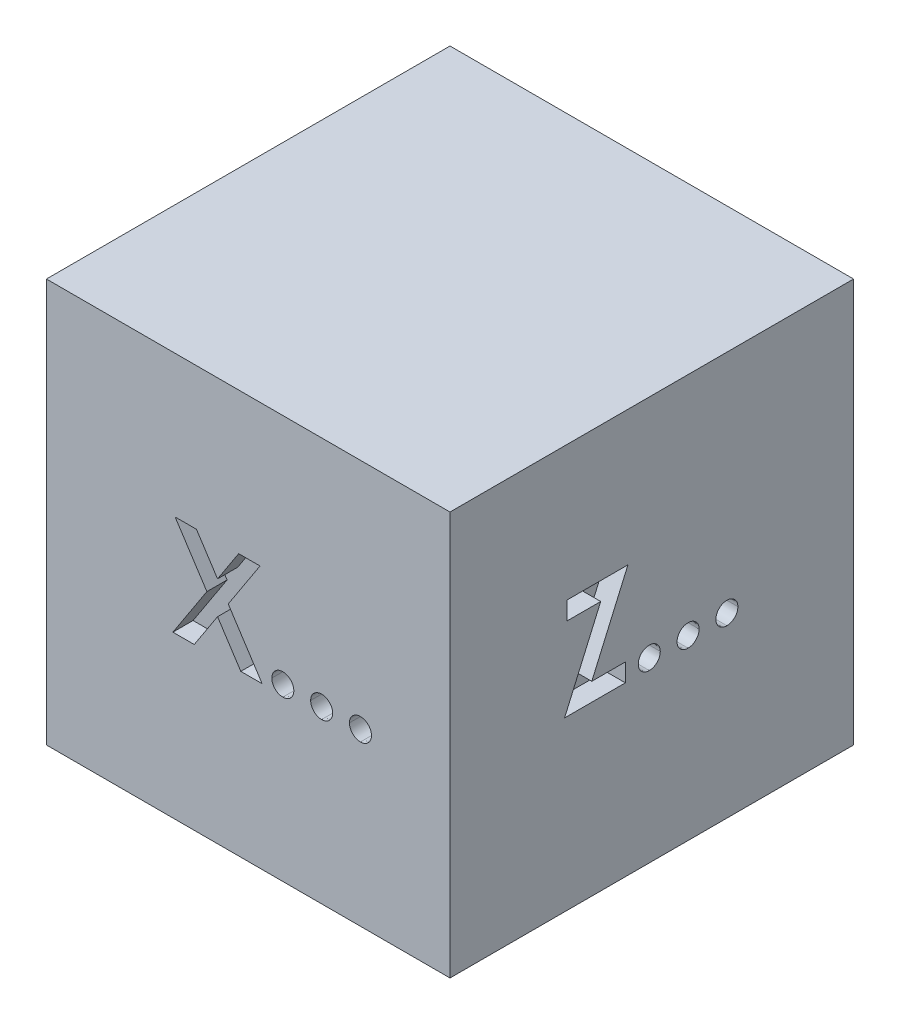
ISO-10303-21;
HEADER;
FILE_DESCRIPTION(('STEP AP214'),'2;1');
FILE_NAME('part.step','',(''),(''),'','','');
FILE_SCHEMA(('AUTOMOTIVE_DESIGN { 1 0 10303 214 1 1 1 1 }'));
ENDSEC;
DATA;
#1=APPLICATION_CONTEXT('core data for automotive mechanical design processes');
#2=APPLICATION_PROTOCOL_DEFINITION('international standard','automotive_design',2000,#1);
#3=PRODUCT_CONTEXT('',#1,'mechanical');
#4=PRODUCT('Part','Part','',(#3));
#5=PRODUCT_RELATED_PRODUCT_CATEGORY('part','',(#4));
#6=PRODUCT_DEFINITION_FORMATION('','',#4);
#7=PRODUCT_DEFINITION_CONTEXT('part definition',#1,'design');
#8=PRODUCT_DEFINITION('design','',#6,#7);
#9=PRODUCT_DEFINITION_SHAPE('','',#8);
#10=(LENGTH_UNIT() NAMED_UNIT(*) SI_UNIT(.MILLI.,.METRE.));
#11=(NAMED_UNIT(*) PLANE_ANGLE_UNIT() SI_UNIT($,.RADIAN.));
#12=(NAMED_UNIT(*) SI_UNIT($,.STERADIAN.) SOLID_ANGLE_UNIT());
#13=UNCERTAINTY_MEASURE_WITH_UNIT(LENGTH_MEASURE(1.E-05),#10,'distance_accuracy_value','');
#14=(GEOMETRIC_REPRESENTATION_CONTEXT(3) GLOBAL_UNCERTAINTY_ASSIGNED_CONTEXT((#13)) GLOBAL_UNIT_ASSIGNED_CONTEXT((#10,
#11,#12)) REPRESENTATION_CONTEXT('',''));
#15=CARTESIAN_POINT('',(0.,0.,0.));
#16=DIRECTION('',(0.,0.,1.));
#17=DIRECTION('',(1.,0.,0.));
#18=AXIS2_PLACEMENT_3D('',#15,#16,#17);
#19=CARTESIAN_POINT('',(0.,0.,1.));
#20=DIRECTION('',(1.,0.,0.));
#21=DIRECTION('',(0.,0.,-1.));
#22=AXIS2_PLACEMENT_3D('',#19,#20,#21);
#23=PLANE('',#22);
#24=CARTESIAN_POINT('',(0.,0.525952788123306,0.604405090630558));
#25=CARTESIAN_POINT('',(0.,0.527363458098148,0.604480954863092));
#26=CARTESIAN_POINT('',(0.,0.530117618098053,0.604629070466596));
#27=CARTESIAN_POINT('',(0.,0.534060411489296,0.605827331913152));
#28=CARTESIAN_POINT('',(0.,0.537643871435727,0.607782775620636));
#29=CARTESIAN_POINT('',(0.,0.540815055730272,0.610426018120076));
#30=CARTESIAN_POINT('',(0.,0.543471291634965,0.613606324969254));
#31=CARTESIAN_POINT('',(0.,0.545404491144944,0.617198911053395));
#32=CARTESIAN_POINT('',(0.,0.546550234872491,0.621130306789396));
#33=CARTESIAN_POINT('',(0.,0.546706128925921,0.623845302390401));
#34=CARTESIAN_POINT('',(0.,0.54678612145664,0.625238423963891));
#35=B_SPLINE_CURVE_WITH_KNOTS('',3,(#24,#25,#26,#27,#28,#29,#30,#31,#32,#33,#34),.UNSPECIFIED.,
.F.,.F.,(4,1,1,1,1,1,1,1,4),(0.,0.129096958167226,0.252045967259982,0.373904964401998,
0.501037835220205,0.628170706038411,0.751376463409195,0.872426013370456,1.),.UNSPECIFIED.);
#36=CARTESIAN_POINT('',(0.,0.525952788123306,0.604405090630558));
#37=VERTEX_POINT('',#36);
#38=CARTESIAN_POINT('',(0.,0.54678612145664,0.625238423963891));
#39=VERTEX_POINT('',#38);
#40=EDGE_CURVE('E572',#37,#39,#35,.T.);
#41=ORIENTED_EDGE('',*,*,#40,.T.);
#42=CARTESIAN_POINT('',(0.,0.54678612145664,0.625238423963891));
#43=CARTESIAN_POINT('',(0.,0.54670339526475,0.626630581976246));
#44=CARTESIAN_POINT('',(0.,0.546541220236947,0.629359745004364));
#45=CARTESIAN_POINT('',(0.,0.545428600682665,0.633305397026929));
#46=CARTESIAN_POINT('',(0.,0.543452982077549,0.636876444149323));
#47=CARTESIAN_POINT('',(0.,0.540819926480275,0.640057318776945));
#48=CARTESIAN_POINT('',(0.,0.537627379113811,0.642679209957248));
#49=CARTESIAN_POINT('',(0.,0.534084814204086,0.644725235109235));
#50=CARTESIAN_POINT('',(0.,0.530106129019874,0.645828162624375));
#51=CARTESIAN_POINT('',(0.,0.527361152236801,0.645989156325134));
#52=CARTESIAN_POINT('',(0.,0.525952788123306,0.646071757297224));
#53=B_SPLINE_CURVE_WITH_KNOTS('',3,(#42,#43,#44,#45,#46,#47,#48,#49,#50,#51,#52),.UNSPECIFIED.,
.F.,.F.,(4,1,1,1,1,1,1,1,4),(0.,0.127518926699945,0.249985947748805,0.371792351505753,
0.498870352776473,0.625948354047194,0.748491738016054,0.870958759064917,1.),.UNSPECIFIED.);
#54=CARTESIAN_POINT('',(0.,0.525952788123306,0.646071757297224));
#55=VERTEX_POINT('',#54);
#56=EDGE_CURVE('E580',#39,#55,#53,.T.);
#57=ORIENTED_EDGE('',*,*,#56,.T.);
#58=CARTESIAN_POINT('',(0.,0.525952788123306,0.646071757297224));
#59=CARTESIAN_POINT('',(0.,0.524578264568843,0.645986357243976));
#60=CARTESIAN_POINT('',(0.,0.521867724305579,0.645817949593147));
#61=CARTESIAN_POINT('',(0.,0.517919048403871,0.644727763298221));
#62=CARTESIAN_POINT('',(0.,0.514374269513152,0.642663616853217));
#63=CARTESIAN_POINT('',(0.,0.511138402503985,0.640075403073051));
#64=CARTESIAN_POINT('',(0.,0.508499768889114,0.636875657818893));
#65=CARTESIAN_POINT('',(0.,0.506540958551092,0.633296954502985));
#66=CARTESIAN_POINT('',(0.,0.505348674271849,0.629369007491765));
#67=CARTESIAN_POINT('',(0.,0.505196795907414,0.626632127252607));
#68=CARTESIAN_POINT('',(0.,0.505119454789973,0.625238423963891));
#69=B_SPLINE_CURVE_WITH_KNOTS('',3,(#58,#59,#60,#61,#62,#63,#64,#65,#66,#67,#68),.UNSPECIFIED.,
.F.,.F.,(4,1,1,1,1,1,1,1,4),(0.,0.126177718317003,0.248820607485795,0.371539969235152,
0.499983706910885,0.627244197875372,0.749225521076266,0.87229795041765,1.),.UNSPECIFIED.);
#70=CARTESIAN_POINT('',(0.,0.505119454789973,0.625238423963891));
#71=VERTEX_POINT('',#70);
#72=EDGE_CURVE('E589',#55,#71,#69,.T.);
#73=ORIENTED_EDGE('',*,*,#72,.T.);
#74=CARTESIAN_POINT('',(0.,0.505119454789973,0.625238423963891));
#75=CARTESIAN_POINT('',(0.,0.505193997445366,0.623843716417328));
#76=CARTESIAN_POINT('',(0.,0.505339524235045,0.621120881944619));
#77=CARTESIAN_POINT('',(0.,0.506565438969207,0.617207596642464));
#78=CARTESIAN_POINT('',(0.,0.508481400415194,0.61360709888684));
#79=CARTESIAN_POINT('',(0.,0.511143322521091,0.610407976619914));
#80=CARTESIAN_POINT('',(0.,0.514357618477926,0.607798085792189));
#81=CARTESIAN_POINT('',(0.,0.517943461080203,0.605824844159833));
#82=CARTESIAN_POINT('',(0.,0.521856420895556,0.604639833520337));
#83=CARTESIAN_POINT('',(0.,0.524576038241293,0.604483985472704));
#84=CARTESIAN_POINT('',(0.,0.525952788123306,0.604405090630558));
#85=B_SPLINE_CURVE_WITH_KNOTS('',3,(#74,#75,#76,#77,#78,#79,#80,#81,#82,#83,#84),.UNSPECIFIED.,
.F.,.F.,(4,1,1,1,1,1,1,1,4),(0.,0.127756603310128,0.249414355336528,0.372796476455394,
0.500111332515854,0.628609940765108,0.750643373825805,0.873768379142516,1.),.UNSPECIFIED.);
#86=EDGE_CURVE('E597',#71,#37,#85,.T.);
#87=ORIENTED_EDGE('',*,*,#86,.T.);
#88=EDGE_LOOP('',(#41,#57,#73,#87));
#89=FACE_BOUND('',#88,.T.);
#90=DIRECTION('',(0.,-0.521331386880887,-0.853354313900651));
#91=VECTOR('',#90,1.);
#92=CARTESIAN_POINT('',(0.,0.381052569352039,0.524927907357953));
#93=LINE('',#92,#91);
#94=CARTESIAN_POINT('',(0.,0.381052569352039,0.524927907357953));
#95=VERTEX_POINT('',#94);
#96=CARTESIAN_POINT('',(0.,0.300924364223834,0.393768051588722));
#97=VERTEX_POINT('',#96);
#98=EDGE_CURVE('E1113',#95,#97,#93,.T.);
#99=ORIENTED_EDGE('',*,*,#98,.T.);
#100=DIRECTION('',(0.,1.,0.));
#101=VECTOR('',#100,1.);
#102=CARTESIAN_POINT('',(0.,0.300924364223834,0.393768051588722));
#103=LINE('',#102,#101);
#104=CARTESIAN_POINT('',(0.,0.326615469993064,0.393768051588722));
#105=VERTEX_POINT('',#104);
#106=EDGE_CURVE('E1264',#97,#105,#103,.T.);
#107=ORIENTED_EDGE('',*,*,#106,.T.);
#108=DIRECTION('',(0.,0.521787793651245,0.853075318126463));
#109=VECTOR('',#108,1.);
#110=CARTESIAN_POINT('',(0.,0.326615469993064,0.393768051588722));
#111=LINE('',#110,#109);
#112=CARTESIAN_POINT('',(0.,0.392320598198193,0.501189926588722));
#113=VERTEX_POINT('',#112);
#114=EDGE_CURVE('E1266',#105,#113,#111,.T.);
#115=ORIENTED_EDGE('',*,*,#114,.T.);
#116=DIRECTION('',(0.,0.521208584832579,-0.853429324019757));
#117=VECTOR('',#116,1.);
#118=CARTESIAN_POINT('',(0.,0.392320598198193,0.501189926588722));
#119=LINE('',#118,#117);
#120=CARTESIAN_POINT('',(0.,0.45792556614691,0.393768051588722));
#121=VERTEX_POINT('',#120);
#122=EDGE_CURVE('E1269',#113,#121,#119,.T.);
#123=ORIENTED_EDGE('',*,*,#122,.T.);
#124=DIRECTION('',(0.,1.,0.));
#125=VECTOR('',#124,1.);
#126=CARTESIAN_POINT('',(0.,0.45792556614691,0.393768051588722));
#127=LINE('',#126,#125);
#128=CARTESIAN_POINT('',(0.,0.483616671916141,0.393768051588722));
#129=VERTEX_POINT('',#128);
#130=EDGE_CURVE('E1272',#121,#129,#127,.T.);
#131=ORIENTED_EDGE('',*,*,#130,.T.);
#132=DIRECTION('',(0.,-0.521331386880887,0.853354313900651));
#133=VECTOR('',#132,1.);
#134=CARTESIAN_POINT('',(0.,0.483616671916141,0.393768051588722));
#135=LINE('',#134,#133);
#136=CARTESIAN_POINT('',(0.,0.403488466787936,0.524927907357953));
#137=VERTEX_POINT('',#136);
#138=EDGE_CURVE('E1275',#129,#137,#135,.T.);
#139=ORIENTED_EDGE('',*,*,#138,.T.);
#140=DIRECTION('',(0.,0.,1.));
#141=VECTOR('',#140,1.);
#142=CARTESIAN_POINT('',(0.,0.403488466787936,0.524927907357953));
#143=LINE('',#142,#141);
#144=CARTESIAN_POINT('',(0.,0.403488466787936,0.643768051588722));
#145=VERTEX_POINT('',#144);
#146=EDGE_CURVE('E1278',#137,#145,#143,.T.);
#147=ORIENTED_EDGE('',*,*,#146,.T.);
#148=DIRECTION('',(0.,-1.,0.));
#149=VECTOR('',#148,1.);
#150=CARTESIAN_POINT('',(0.,0.403488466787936,0.643768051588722));
#151=LINE('',#150,#149);
#152=CARTESIAN_POINT('',(0.,0.381052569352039,0.643768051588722));
#153=VERTEX_POINT('',#152);
#154=EDGE_CURVE('E1281',#145,#153,#151,.T.);
#155=ORIENTED_EDGE('',*,*,#154,.T.);
#156=DIRECTION('',(0.,0.,-1.));
#157=VECTOR('',#156,1.);
#158=CARTESIAN_POINT('',(0.,0.381052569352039,0.643768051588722));
#159=LINE('',#158,#157);
#160=EDGE_CURVE('E1246',#153,#95,#159,.T.);
#161=ORIENTED_EDGE('',*,*,#160,.T.);
#162=EDGE_LOOP('',(#99,#107,#115,#123,#131,#139,#147,#155,#161));
#163=FACE_BOUND('',#162,.T.);
#164=DIRECTION('',(0.,-1.,0.));
#165=VECTOR('',#164,1.);
#166=CARTESIAN_POINT('',(0.,0.,0.));
#167=LINE('',#166,#165);
#168=CARTESIAN_POINT('',(0.,1.,0.));
#169=VERTEX_POINT('',#168);
#170=CARTESIAN_POINT('',(0.,0.,0.));
#171=VERTEX_POINT('',#170);
#172=EDGE_CURVE('E1119',#169,#171,#167,.T.);
#173=ORIENTED_EDGE('',*,*,#172,.T.);
#174=DIRECTION('',(0.,0.,-1.));
#175=VECTOR('',#174,1.);
#176=CARTESIAN_POINT('',(0.,0.,1.));
#177=LINE('',#176,#175);
#178=CARTESIAN_POINT('',(0.,0.,1.));
#179=VERTEX_POINT('',#178);
#180=EDGE_CURVE('E11',#179,#171,#177,.T.);
#181=ORIENTED_EDGE('',*,*,#180,.F.);
#182=DIRECTION('',(0.,-1.,0.));
#183=VECTOR('',#182,1.);
#184=CARTESIAN_POINT('',(0.,0.,1.));
#185=LINE('',#184,#183);
#186=CARTESIAN_POINT('',(0.,1.,1.));
#187=VERTEX_POINT('',#186);
#188=EDGE_CURVE('E1646',#187,#179,#185,.T.);
#189=ORIENTED_EDGE('',*,*,#188,.F.);
#190=DIRECTION('',(0.,0.,-1.));
#191=VECTOR('',#190,1.);
#192=CARTESIAN_POINT('',(0.,1.,1.));
#193=LINE('',#192,#191);
#194=EDGE_CURVE('E1656',#187,#169,#193,.T.);
#195=ORIENTED_EDGE('',*,*,#194,.T.);
#196=EDGE_LOOP('',(#173,#181,#189,#195));
#197=FACE_BOUND('',#196,.T.);
#198=CARTESIAN_POINT('',(0.,0.462146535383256,0.605767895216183));
#199=CARTESIAN_POINT('',(0.,0.463557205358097,0.605843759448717));
#200=CARTESIAN_POINT('',(0.,0.466311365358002,0.605991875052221));
#201=CARTESIAN_POINT('',(0.,0.470254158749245,0.607190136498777));
#202=CARTESIAN_POINT('',(0.,0.473837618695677,0.609145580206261));
#203=CARTESIAN_POINT('',(0.,0.477008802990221,0.611788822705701));
#204=CARTESIAN_POINT('',(0.,0.479665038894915,0.614969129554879));
#205=CARTESIAN_POINT('',(0.,0.481598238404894,0.618561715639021));
#206=CARTESIAN_POINT('',(0.,0.48274398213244,0.622493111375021));
#207=CARTESIAN_POINT('',(0.,0.482899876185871,0.625208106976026));
#208=CARTESIAN_POINT('',(0.,0.482979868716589,0.626601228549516));
#209=B_SPLINE_CURVE_WITH_KNOTS('',3,(#198,#199,#200,#201,#202,#203,#204,#205,#206,#207,#208),
.UNSPECIFIED.,.F.,.F.,(4,1,1,1,1,1,1,1,4),(0.,0.129096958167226,0.25204596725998,
0.373904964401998,0.501037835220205,0.628170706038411,0.751376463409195,0.872426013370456,1.),.UNSPECIFIED.);
#210=CARTESIAN_POINT('',(0.,0.462146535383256,0.605767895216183));
#211=VERTEX_POINT('',#210);
#212=CARTESIAN_POINT('',(0.,0.482979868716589,0.626601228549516));
#213=VERTEX_POINT('',#212);
#214=EDGE_CURVE('E618',#211,#213,#209,.T.);
#215=ORIENTED_EDGE('',*,*,#214,.T.);
#216=CARTESIAN_POINT('',(0.,0.482979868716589,0.626601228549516));
#217=CARTESIAN_POINT('',(0.,0.4828971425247,0.627993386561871));
#218=CARTESIAN_POINT('',(0.,0.482734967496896,0.630722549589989));
#219=CARTESIAN_POINT('',(0.,0.481622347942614,0.634668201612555));
#220=CARTESIAN_POINT('',(0.,0.479646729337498,0.638239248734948));
#221=CARTESIAN_POINT('',(0.,0.477013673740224,0.64142012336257));
#222=CARTESIAN_POINT('',(0.,0.47382112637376,0.644042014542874));
#223=CARTESIAN_POINT('',(0.,0.470278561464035,0.64608803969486));
#224=CARTESIAN_POINT('',(0.,0.466299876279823,0.647190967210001));
#225=CARTESIAN_POINT('',(0.,0.46355489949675,0.647351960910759));
#226=CARTESIAN_POINT('',(0.,0.462146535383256,0.64743456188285));
#227=B_SPLINE_CURVE_WITH_KNOTS('',3,(#216,#217,#218,#219,#220,#221,#222,#223,#224,#225,#226),
.UNSPECIFIED.,.F.,.F.,(4,1,1,1,1,1,1,1,4),(0.,0.127518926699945,0.249985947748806,
0.371792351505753,0.498870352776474,0.625948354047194,0.748491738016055,0.870958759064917,1.),.UNSPECIFIED.);
#228=CARTESIAN_POINT('',(0.,0.462146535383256,0.64743456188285));
#229=VERTEX_POINT('',#228);
#230=EDGE_CURVE('E1209',#213,#229,#227,.T.);
#231=ORIENTED_EDGE('',*,*,#230,.T.);
#232=CARTESIAN_POINT('',(0.,0.462146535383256,0.64743456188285));
#233=CARTESIAN_POINT('',(0.,0.460772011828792,0.647349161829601));
#234=CARTESIAN_POINT('',(0.,0.458061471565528,0.647180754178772));
#235=CARTESIAN_POINT('',(0.,0.45411279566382,0.646090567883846));
#236=CARTESIAN_POINT('',(0.,0.450568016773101,0.644026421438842));
#237=CARTESIAN_POINT('',(0.,0.447332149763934,0.641438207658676));
#238=CARTESIAN_POINT('',(0.,0.444693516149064,0.638238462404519));
#239=CARTESIAN_POINT('',(0.,0.442734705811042,0.63465975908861));
#240=CARTESIAN_POINT('',(0.,0.441542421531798,0.63073181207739));
#241=CARTESIAN_POINT('',(0.,0.441390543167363,0.627994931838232));
#242=CARTESIAN_POINT('',(0.,0.441313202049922,0.626601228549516));
#243=B_SPLINE_CURVE_WITH_KNOTS('',3,(#232,#233,#234,#235,#236,#237,#238,#239,#240,#241,#242),
.UNSPECIFIED.,.F.,.F.,(4,1,1,1,1,1,1,1,4),(0.,0.126177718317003,0.248820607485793,
0.371539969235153,0.499983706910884,0.627244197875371,0.749225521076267,0.87229795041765,1.),.UNSPECIFIED.);
#244=CARTESIAN_POINT('',(0.,0.441313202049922,0.626601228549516));
#245=VERTEX_POINT('',#244);
#246=EDGE_CURVE('E1216',#229,#245,#243,.T.);
#247=ORIENTED_EDGE('',*,*,#246,.T.);
#248=CARTESIAN_POINT('',(0.,0.441313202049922,0.626601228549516));
#249=CARTESIAN_POINT('',(0.,0.441387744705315,0.625206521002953));
#250=CARTESIAN_POINT('',(0.,0.441533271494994,0.622483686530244));
#251=CARTESIAN_POINT('',(0.,0.442759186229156,0.618570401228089));
#252=CARTESIAN_POINT('',(0.,0.444675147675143,0.614969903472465));
#253=CARTESIAN_POINT('',(0.,0.44733706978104,0.611770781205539));
#254=CARTESIAN_POINT('',(0.,0.450551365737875,0.609160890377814));
#255=CARTESIAN_POINT('',(0.,0.454137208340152,0.607187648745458));
#256=CARTESIAN_POINT('',(0.,0.458050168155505,0.606002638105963));
#257=CARTESIAN_POINT('',(0.,0.460769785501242,0.605846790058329));
#258=CARTESIAN_POINT('',(0.,0.462146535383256,0.605767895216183));
#259=B_SPLINE_CURVE_WITH_KNOTS('',3,(#248,#249,#250,#251,#252,#253,#254,#255,#256,#257,#258),
.UNSPECIFIED.,.F.,.F.,(4,1,1,1,1,1,1,1,4),(0.,0.127756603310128,0.249414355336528,
0.372796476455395,0.500111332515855,0.628609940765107,0.750643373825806,0.873768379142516,1.),.UNSPECIFIED.);
#260=EDGE_CURVE('E626',#245,#211,#259,.T.);
#261=ORIENTED_EDGE('',*,*,#260,.T.);
#262=EDGE_LOOP('',(#215,#231,#247,#261));
#263=FACE_BOUND('',#262,.T.);
#264=CARTESIAN_POINT('',(0.,0.589940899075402,0.604056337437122));
#265=CARTESIAN_POINT('',(0.,0.591351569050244,0.604132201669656));
#266=CARTESIAN_POINT('',(0.,0.594105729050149,0.60428031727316));
#267=CARTESIAN_POINT('',(0.,0.598048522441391,0.605478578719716));
#268=CARTESIAN_POINT('',(0.,0.601631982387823,0.6074340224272));
#269=CARTESIAN_POINT('',(0.,0.604803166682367,0.610077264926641));
#270=CARTESIAN_POINT('',(0.,0.607459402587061,0.613257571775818));
#271=CARTESIAN_POINT('',(0.,0.60939260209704,0.61685015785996));
#272=CARTESIAN_POINT('',(0.,0.610538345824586,0.62078155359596));
#273=CARTESIAN_POINT('',(0.,0.610694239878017,0.623496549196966));
#274=CARTESIAN_POINT('',(0.,0.610774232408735,0.624889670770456));
#275=B_SPLINE_CURVE_WITH_KNOTS('',3,(#264,#265,#266,#267,#268,#269,#270,#271,#272,#273,#274),
.UNSPECIFIED.,.F.,.F.,(4,1,1,1,1,1,1,1,4),(0.,0.129096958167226,0.252045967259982,
0.373904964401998,0.501037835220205,0.628170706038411,0.751376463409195,0.872426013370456,1.),.UNSPECIFIED.);
#276=CARTESIAN_POINT('',(0.,0.589940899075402,0.604056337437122));
#277=VERTEX_POINT('',#276);
#278=CARTESIAN_POINT('',(0.,0.610774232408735,0.624889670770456));
#279=VERTEX_POINT('',#278);
#280=EDGE_CURVE('E55',#277,#279,#275,.T.);
#281=ORIENTED_EDGE('',*,*,#280,.T.);
#282=CARTESIAN_POINT('',(0.,0.610774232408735,0.624889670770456));
#283=CARTESIAN_POINT('',(0.,0.610691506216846,0.626281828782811));
#284=CARTESIAN_POINT('',(0.,0.610529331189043,0.629010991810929));
#285=CARTESIAN_POINT('',(0.,0.60941671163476,0.632956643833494));
#286=CARTESIAN_POINT('',(0.,0.607441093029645,0.636527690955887));
#287=CARTESIAN_POINT('',(0.,0.60480803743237,0.63970856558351));
#288=CARTESIAN_POINT('',(0.,0.601615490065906,0.642330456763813));
#289=CARTESIAN_POINT('',(0.,0.598072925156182,0.644376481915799));
#290=CARTESIAN_POINT('',(0.,0.594094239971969,0.64547940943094));
#291=CARTESIAN_POINT('',(0.,0.591349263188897,0.645640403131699));
#292=CARTESIAN_POINT('',(0.,0.589940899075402,0.645723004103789));
#293=B_SPLINE_CURVE_WITH_KNOTS('',3,(#282,#283,#284,#285,#286,#287,#288,#289,#290,#291,#292),
.UNSPECIFIED.,.F.,.F.,(4,1,1,1,1,1,1,1,4),(0.,0.127518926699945,0.249985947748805,
0.371792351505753,0.498870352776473,0.625948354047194,0.748491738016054,0.870958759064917,1.),.UNSPECIFIED.);
#294=CARTESIAN_POINT('',(0.,0.589940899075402,0.645723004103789));
#295=VERTEX_POINT('',#294);
#296=EDGE_CURVE('E1127',#279,#295,#293,.T.);
#297=ORIENTED_EDGE('',*,*,#296,.T.);
#298=CARTESIAN_POINT('',(0.,0.589940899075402,0.645723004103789));
#299=CARTESIAN_POINT('',(0.,0.588566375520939,0.64563760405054));
#300=CARTESIAN_POINT('',(0.,0.585855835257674,0.645469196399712));
#301=CARTESIAN_POINT('',(0.,0.581907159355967,0.644379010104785));
#302=CARTESIAN_POINT('',(0.,0.578362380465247,0.642314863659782));
#303=CARTESIAN_POINT('',(0.,0.57512651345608,0.639726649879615));
#304=CARTESIAN_POINT('',(0.,0.57248787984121,0.636526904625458));
#305=CARTESIAN_POINT('',(0.,0.570529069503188,0.63294820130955));
#306=CARTESIAN_POINT('',(0.,0.569336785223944,0.62902025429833));
#307=CARTESIAN_POINT('',(0.,0.569184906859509,0.626283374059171));
#308=CARTESIAN_POINT('',(0.,0.569107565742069,0.624889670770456));
#309=B_SPLINE_CURVE_WITH_KNOTS('',3,(#298,#299,#300,#301,#302,#303,#304,#305,#306,#307,#308),
.UNSPECIFIED.,.F.,.F.,(4,1,1,1,1,1,1,1,4),(0.,0.126177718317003,0.248820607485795,
0.371539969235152,0.499983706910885,0.627244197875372,0.749225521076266,0.87229795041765,1.),.UNSPECIFIED.);
#310=CARTESIAN_POINT('',(0.,0.569107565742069,0.624889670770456));
#311=VERTEX_POINT('',#310);
#312=EDGE_CURVE('E1130',#295,#311,#309,.T.);
#313=ORIENTED_EDGE('',*,*,#312,.T.);
#314=CARTESIAN_POINT('',(0.,0.569107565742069,0.624889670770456));
#315=CARTESIAN_POINT('',(0.,0.569182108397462,0.623494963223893));
#316=CARTESIAN_POINT('',(0.,0.56932763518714,0.620772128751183));
#317=CARTESIAN_POINT('',(0.,0.570553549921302,0.616858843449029));
#318=CARTESIAN_POINT('',(0.,0.572469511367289,0.613258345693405));
#319=CARTESIAN_POINT('',(0.,0.575131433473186,0.610059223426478));
#320=CARTESIAN_POINT('',(0.,0.578345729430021,0.607449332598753));
#321=CARTESIAN_POINT('',(0.,0.581931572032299,0.605476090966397));
#322=CARTESIAN_POINT('',(0.,0.585844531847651,0.604291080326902));
#323=CARTESIAN_POINT('',(0.,0.588564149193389,0.604135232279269));
#324=CARTESIAN_POINT('',(0.,0.589940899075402,0.604056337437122));
#325=B_SPLINE_CURVE_WITH_KNOTS('',3,(#314,#315,#316,#317,#318,#319,#320,#321,#322,#323,#324),
.UNSPECIFIED.,.F.,.F.,(4,1,1,1,1,1,1,1,4),(0.,0.127756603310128,0.249414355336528,
0.372796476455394,0.500111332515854,0.628609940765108,0.750643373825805,0.873768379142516,1.),.UNSPECIFIED.);
#326=EDGE_CURVE('E534',#311,#277,#325,.T.);
#327=ORIENTED_EDGE('',*,*,#326,.T.);
#328=EDGE_LOOP('',(#281,#297,#313,#327));
#329=FACE_BOUND('',#328,.T.);
#330=ADVANCED_FACE('F33',(#89,#163,#197,#263,#329),#23,.F.);
#331=CARTESIAN_POINT('',(0.,0.,1.));
#332=DIRECTION('',(0.,0.,-1.));
#333=DIRECTION('',(-1.,0.,0.));
#334=AXIS2_PLACEMENT_3D('',#331,#332,#333);
#335=PLANE('',#334);
#336=CARTESIAN_POINT('',(0.654692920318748,0.422946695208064,1.));
#337=CARTESIAN_POINT('',(0.654781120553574,0.424778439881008,1.));
#338=CARTESIAN_POINT('',(0.654953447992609,0.428357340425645,1.));
#339=CARTESIAN_POINT('',(0.656550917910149,0.433473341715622,1.));
#340=CARTESIAN_POINT('',(0.659020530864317,0.438195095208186,1.));
#341=CARTESIAN_POINT('',(0.662552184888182,0.442290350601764,1.));
#342=CARTESIAN_POINT('',(0.666711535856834,0.445731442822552,1.));
#343=CARTESIAN_POINT('',(0.671396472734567,0.448323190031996,1.));
#344=CARTESIAN_POINT('',(0.676557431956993,0.449797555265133,1.));
#345=CARTESIAN_POINT('',(0.680124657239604,0.449991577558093,1.));
#346=CARTESIAN_POINT('',(0.681936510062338,0.450090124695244,1.));
#347=B_SPLINE_CURVE_WITH_KNOTS('',3,(#336,#337,#338,#339,#340,#341,#342,#343,#344,#345,#346),
.UNSPECIFIED.,.F.,.F.,(4,1,1,1,1,1,1,1,4),(0.,0.128226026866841,0.250530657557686,
0.372638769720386,0.499833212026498,0.627178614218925,0.749841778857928,0.872940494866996,1.),.UNSPECIFIED.);
#348=CARTESIAN_POINT('',(0.654692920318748,0.422946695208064,1.));
#349=VERTEX_POINT('',#348);
#350=CARTESIAN_POINT('',(0.681936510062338,0.450090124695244,1.));
#351=VERTEX_POINT('',#350);
#352=EDGE_CURVE('E751',#349,#351,#347,.T.);
#353=ORIENTED_EDGE('',*,*,#352,.T.);
#354=CARTESIAN_POINT('',(0.681936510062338,0.450090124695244,1.));
#355=CARTESIAN_POINT('',(0.683747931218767,0.449990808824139,1.));
#356=CARTESIAN_POINT('',(0.687314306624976,0.449795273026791,1.));
#357=CARTESIAN_POINT('',(0.692467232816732,0.448336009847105,1.));
#358=CARTESIAN_POINT('',(0.697117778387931,0.445714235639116,1.));
#359=CARTESIAN_POINT('',(0.70127598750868,0.442294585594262,1.));
#360=CARTESIAN_POINT('',(0.704792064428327,0.438180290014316,1.));
#361=CARTESIAN_POINT('',(0.707333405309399,0.433488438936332,1.));
#362=CARTESIAN_POINT('',(0.708915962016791,0.428355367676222,1.));
#363=CARTESIAN_POINT('',(0.709090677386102,0.424777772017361,1.));
#364=CARTESIAN_POINT('',(0.709180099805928,0.422946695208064,1.));
#365=B_SPLINE_CURVE_WITH_KNOTS('',3,(#354,#355,#356,#357,#358,#359,#360,#361,#362,#363,#364),
.UNSPECIFIED.,.F.,.F.,(4,1,1,1,1,1,1,1,4),(0.,0.127119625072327,0.250276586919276,
0.371969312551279,0.499374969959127,0.626629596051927,0.749350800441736,0.871713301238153,1.),.UNSPECIFIED.);
#366=CARTESIAN_POINT('',(0.709180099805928,0.422946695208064,1.));
#367=VERTEX_POINT('',#366);
#368=EDGE_CURVE('E1346',#351,#367,#365,.T.);
#369=ORIENTED_EDGE('',*,*,#368,.T.);
#370=CARTESIAN_POINT('',(0.709180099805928,0.422946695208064,1.));
#371=CARTESIAN_POINT('',(0.70909126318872,0.421115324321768,1.));
#372=CARTESIAN_POINT('',(0.708917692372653,0.417537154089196,1.));
#373=CARTESIAN_POINT('',(0.707322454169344,0.412394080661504,1.));
#374=CARTESIAN_POINT('',(0.704795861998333,0.4076636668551,1.));
#375=CARTESIAN_POINT('',(0.701275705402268,0.403505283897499,1.));
#376=CARTESIAN_POINT('',(0.697134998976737,0.400021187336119,1.));
#377=CARTESIAN_POINT('',(0.692456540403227,0.397423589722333,1.));
#378=CARTESIAN_POINT('',(0.687324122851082,0.39588154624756,1.));
#379=CARTESIAN_POINT('',(0.68374965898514,0.395696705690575,1.));
#380=CARTESIAN_POINT('',(0.681936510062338,0.395602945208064,1.));
#381=B_SPLINE_CURVE_WITH_KNOTS('',3,(#370,#371,#372,#373,#374,#375,#376,#377,#378,#379,#380),
.UNSPECIFIED.,.F.,.F.,(4,1,1,1,1,1,1,1,4),(0.,0.127902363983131,0.249898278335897,
0.373279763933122,0.501048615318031,0.628817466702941,0.750145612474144,0.873261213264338,1.),.UNSPECIFIED.);
#382=CARTESIAN_POINT('',(0.681936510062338,0.395602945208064,1.));
#383=VERTEX_POINT('',#382);
#384=EDGE_CURVE('E1354',#367,#383,#381,.T.);
#385=ORIENTED_EDGE('',*,*,#384,.T.);
#386=CARTESIAN_POINT('',(0.681936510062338,0.395602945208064,1.));
#387=CARTESIAN_POINT('',(0.680122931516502,0.395695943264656,1.));
#388=CARTESIAN_POINT('',(0.676547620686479,0.395879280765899,1.));
#389=CARTESIAN_POINT('',(0.671407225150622,0.397436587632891,1.));
#390=CARTESIAN_POINT('',(0.666694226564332,0.400003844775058,1.));
#391=CARTESIAN_POINT('',(0.662552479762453,0.403509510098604,1.));
#392=CARTESIAN_POINT('',(0.659016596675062,0.407648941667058,1.));
#393=CARTESIAN_POINT('',(0.656561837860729,0.412409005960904,1.));
#394=CARTESIAN_POINT('',(0.654951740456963,0.417535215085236,1.));
#395=CARTESIAN_POINT('',(0.654780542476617,0.421114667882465,1.));
#396=CARTESIAN_POINT('',(0.654692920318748,0.422946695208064,1.));
#397=B_SPLINE_CURVE_WITH_KNOTS('',3,(#386,#387,#388,#389,#390,#391,#392,#393,#394,#395,#396),
.UNSPECIFIED.,.F.,.F.,(4,1,1,1,1,1,1,1,4),(0.,0.126678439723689,0.249735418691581,
0.372030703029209,0.499738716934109,0.627446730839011,0.750220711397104,0.872158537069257,1.),.UNSPECIFIED.);
#398=EDGE_CURVE('E759',#383,#349,#397,.T.);
#399=ORIENTED_EDGE('',*,*,#398,.T.);
#400=EDGE_LOOP('',(#353,#369,#385,#399));
#401=FACE_BOUND('',#400,.T.);
#402=DIRECTION('',(-0.54561077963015,0.838038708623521,0.));
#403=VECTOR('',#402,1.);
#404=CARTESIAN_POINT('',(0.39758154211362,0.527964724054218,1.));
#405=LINE('',#404,#403);
#406=CARTESIAN_POINT('',(0.39758154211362,0.527964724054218,1.));
#407=VERTEX_POINT('',#406);
#408=CARTESIAN_POINT('',(0.318905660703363,0.648808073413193,1.));
#409=VERTEX_POINT('',#408);
#410=EDGE_CURVE('E844',#407,#409,#405,.T.);
#411=ORIENTED_EDGE('',*,*,#410,.T.);
#412=DIRECTION('',(1.,0.,0.));
#413=VECTOR('',#412,1.);
#414=CARTESIAN_POINT('',(0.318905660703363,0.648808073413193,1.));
#415=LINE('',#414,#413);
#416=CARTESIAN_POINT('',(0.371790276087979,0.648808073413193,1.));
#417=VERTEX_POINT('',#416);
#418=EDGE_CURVE('E874',#409,#417,#415,.T.);
#419=ORIENTED_EDGE('',*,*,#418,.T.);
#420=DIRECTION('',(0.545374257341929,-0.838192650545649,0.));
#421=VECTOR('',#420,1.);
#422=CARTESIAN_POINT('',(0.371790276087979,0.648808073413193,1.));
#423=LINE('',#422,#421);
#424=CARTESIAN_POINT('',(0.424023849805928,0.568529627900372,1.));
#425=VERTEX_POINT('',#424);
#426=EDGE_CURVE('E877',#417,#425,#423,.T.);
#427=ORIENTED_EDGE('',*,*,#426,.T.);
#428=DIRECTION('',(0.546108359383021,0.837714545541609,0.));
#429=VECTOR('',#428,1.);
#430=CARTESIAN_POINT('',(0.424023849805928,0.568529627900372,1.));
#431=LINE('',#430,#429);
#432=CARTESIAN_POINT('',(0.476357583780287,0.648808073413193,1.));
#433=VERTEX_POINT('',#432);
#434=EDGE_CURVE('E880',#425,#433,#431,.T.);
#435=ORIENTED_EDGE('',*,*,#434,.T.);
#436=DIRECTION('',(1.,0.,0.));
#437=VECTOR('',#436,1.);
#438=CARTESIAN_POINT('',(0.476357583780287,0.648808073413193,1.));
#439=LINE('',#438,#437);
#440=CARTESIAN_POINT('',(0.529292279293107,0.648808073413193,1.));
#441=VERTEX_POINT('',#440);
#442=EDGE_CURVE('E883',#433,#441,#439,.T.);
#443=ORIENTED_EDGE('',*,*,#442,.T.);
#444=DIRECTION('',(-0.546183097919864,-0.837665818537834,0.));
#445=VECTOR('',#444,1.);
#446=CARTESIAN_POINT('',(0.529292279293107,0.648808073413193,1.));
#447=LINE('',#446,#445);
#448=CARTESIAN_POINT('',(0.450466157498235,0.527914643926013,1.));
#449=VERTEX_POINT('',#448);
#450=EDGE_CURVE('E886',#441,#449,#447,.T.);
#451=ORIENTED_EDGE('',*,*,#450,.T.);
#452=DIRECTION('',(0.545513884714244,-0.838101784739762,0.));
#453=VECTOR('',#452,1.);
#454=CARTESIAN_POINT('',(0.450466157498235,0.527914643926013,1.));
#455=LINE('',#454,#453);
#456=CARTESIAN_POINT('',(0.53450061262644,0.398808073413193,1.));
#457=VERTEX_POINT('',#456);
#458=EDGE_CURVE('E889',#449,#457,#455,.T.);
#459=ORIENTED_EDGE('',*,*,#458,.T.);
#460=DIRECTION('',(-1.,0.,0.));
#461=VECTOR('',#460,1.);
#462=CARTESIAN_POINT('',(0.53450061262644,0.398808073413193,1.));
#463=LINE('',#462,#461);
#464=CARTESIAN_POINT('',(0.481615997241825,0.398808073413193,1.));
#465=VERTEX_POINT('',#464);
#466=EDGE_CURVE('E892',#457,#465,#463,.T.);
#467=ORIENTED_EDGE('',*,*,#466,.T.);
#468=DIRECTION('',(-0.545254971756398,0.838270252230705,0.));
#469=VECTOR('',#468,1.);
#470=CARTESIAN_POINT('',(0.481615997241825,0.398808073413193,1.));
#471=LINE('',#470,#469);
#472=CARTESIAN_POINT('',(0.424023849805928,0.487349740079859,1.));
#473=VERTEX_POINT('',#472);
#474=EDGE_CURVE('E895',#465,#473,#471,.T.);
#475=ORIENTED_EDGE('',*,*,#474,.T.);
#476=DIRECTION('',(-0.54625332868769,-0.837620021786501,0.));
#477=VECTOR('',#476,1.);
#478=CARTESIAN_POINT('',(0.424023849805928,0.487349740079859,1.));
#479=LINE('',#478,#477);
#480=CARTESIAN_POINT('',(0.366281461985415,0.398808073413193,1.));
#481=VERTEX_POINT('',#480);
#482=EDGE_CURVE('E898',#473,#481,#479,.T.);
#483=ORIENTED_EDGE('',*,*,#482,.T.);
#484=DIRECTION('',(-1.,0.,0.));
#485=VECTOR('',#484,1.);
#486=CARTESIAN_POINT('',(0.366281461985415,0.398808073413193,1.));
#487=LINE('',#486,#485);
#488=CARTESIAN_POINT('',(0.313346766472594,0.398808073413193,1.));
#489=VERTEX_POINT('',#488);
#490=EDGE_CURVE('E901',#481,#489,#487,.T.);
#491=ORIENTED_EDGE('',*,*,#490,.T.);
#492=DIRECTION('',(0.546277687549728,0.837604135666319,0.));
#493=VECTOR('',#492,1.);
#494=CARTESIAN_POINT('',(0.313346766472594,0.398808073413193,1.));
#495=LINE('',#494,#493);
#496=EDGE_CURVE('E849',#489,#407,#495,.T.);
#497=ORIENTED_EDGE('',*,*,#496,.T.);
#498=EDGE_LOOP('',(#411,#419,#427,#435,#443,#451,#459,#467,#475,#483,#491,#497));
#499=FACE_BOUND('',#498,.T.);
#500=ORIENTED_EDGE('',*,*,#188,.T.);
#501=DIRECTION('',(1.,0.,0.));
#502=VECTOR('',#501,1.);
#503=CARTESIAN_POINT('',(0.,0.,1.));
#504=LINE('',#503,#502);
#505=CARTESIAN_POINT('',(1.,0.,1.));
#506=VERTEX_POINT('',#505);
#507=EDGE_CURVE('E1649',#179,#506,#504,.T.);
#508=ORIENTED_EDGE('',*,*,#507,.T.);
#509=DIRECTION('',(0.,1.,0.));
#510=VECTOR('',#509,1.);
#511=CARTESIAN_POINT('',(1.,0.,1.));
#512=LINE('',#511,#510);
#513=CARTESIAN_POINT('',(1.,1.,1.));
#514=VERTEX_POINT('',#513);
#515=EDGE_CURVE('E1652',#506,#514,#512,.T.);
#516=ORIENTED_EDGE('',*,*,#515,.T.);
#517=DIRECTION('',(-1.,0.,0.));
#518=VECTOR('',#517,1.);
#519=CARTESIAN_POINT('',(0.,1.,1.));
#520=LINE('',#519,#518);
#521=EDGE_CURVE('E1654',#514,#187,#520,.T.);
#522=ORIENTED_EDGE('',*,*,#521,.T.);
#523=EDGE_LOOP('',(#500,#508,#516,#522));
#524=FACE_BOUND('',#523,.T.);
#525=CARTESIAN_POINT('',(0.558539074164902,0.422946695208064,1.));
#526=CARTESIAN_POINT('',(0.558627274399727,0.424778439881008,1.));
#527=CARTESIAN_POINT('',(0.558799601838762,0.428357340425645,1.));
#528=CARTESIAN_POINT('',(0.560397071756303,0.433473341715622,1.));
#529=CARTESIAN_POINT('',(0.56286668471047,0.438195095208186,1.));
#530=CARTESIAN_POINT('',(0.566398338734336,0.442290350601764,1.));
#531=CARTESIAN_POINT('',(0.570557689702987,0.445731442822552,1.));
#532=CARTESIAN_POINT('',(0.575242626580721,0.448323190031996,1.));
#533=CARTESIAN_POINT('',(0.580403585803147,0.449797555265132,1.));
#534=CARTESIAN_POINT('',(0.583970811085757,0.449991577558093,1.));
#535=CARTESIAN_POINT('',(0.585782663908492,0.450090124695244,1.));
#536=B_SPLINE_CURVE_WITH_KNOTS('',3,(#525,#526,#527,#528,#529,#530,#531,#532,#533,#534,#535),
.UNSPECIFIED.,.F.,.F.,(4,1,1,1,1,1,1,1,4),(0.,0.128226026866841,0.250530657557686,
0.372638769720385,0.499833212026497,0.627178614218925,0.749841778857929,0.872940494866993,1.),.UNSPECIFIED.);
#537=CARTESIAN_POINT('',(0.558539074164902,0.422946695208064,1.));
#538=VERTEX_POINT('',#537);
#539=CARTESIAN_POINT('',(0.585782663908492,0.450090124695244,1.));
#540=VERTEX_POINT('',#539);
#541=EDGE_CURVE('E798',#538,#540,#536,.T.);
#542=ORIENTED_EDGE('',*,*,#541,.T.);
#543=CARTESIAN_POINT('',(0.585782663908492,0.450090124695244,1.));
#544=CARTESIAN_POINT('',(0.587594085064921,0.449990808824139,1.));
#545=CARTESIAN_POINT('',(0.59116046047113,0.449795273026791,1.));
#546=CARTESIAN_POINT('',(0.596313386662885,0.448336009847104,1.));
#547=CARTESIAN_POINT('',(0.600963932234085,0.445714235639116,1.));
#548=CARTESIAN_POINT('',(0.605122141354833,0.442294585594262,1.));
#549=CARTESIAN_POINT('',(0.608638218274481,0.438180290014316,1.));
#550=CARTESIAN_POINT('',(0.611179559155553,0.433488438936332,1.));
#551=CARTESIAN_POINT('',(0.612762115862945,0.428355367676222,1.));
#552=CARTESIAN_POINT('',(0.612936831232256,0.424777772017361,1.));
#553=CARTESIAN_POINT('',(0.613026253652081,0.422946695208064,1.));
#554=B_SPLINE_CURVE_WITH_KNOTS('',3,(#543,#544,#545,#546,#547,#548,#549,#550,#551,#552,#553),
.UNSPECIFIED.,.F.,.F.,(4,1,1,1,1,1,1,1,4),(0.,0.127119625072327,0.250276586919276,
0.371969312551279,0.499374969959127,0.626629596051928,0.749350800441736,0.871713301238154,1.),.UNSPECIFIED.);
#555=CARTESIAN_POINT('',(0.613026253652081,0.422946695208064,1.));
#556=VERTEX_POINT('',#555);
#557=EDGE_CURVE('E806',#540,#556,#554,.T.);
#558=ORIENTED_EDGE('',*,*,#557,.T.);
#559=CARTESIAN_POINT('',(0.613026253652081,0.422946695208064,1.));
#560=CARTESIAN_POINT('',(0.612937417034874,0.421115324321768,1.));
#561=CARTESIAN_POINT('',(0.612763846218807,0.417537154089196,1.));
#562=CARTESIAN_POINT('',(0.611168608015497,0.412394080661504,1.));
#563=CARTESIAN_POINT('',(0.608642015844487,0.4076636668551,1.));
#564=CARTESIAN_POINT('',(0.605121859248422,0.403505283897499,1.));
#565=CARTESIAN_POINT('',(0.600981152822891,0.400021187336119,1.));
#566=CARTESIAN_POINT('',(0.59630269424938,0.397423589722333,1.));
#567=CARTESIAN_POINT('',(0.591170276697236,0.39588154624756,1.));
#568=CARTESIAN_POINT('',(0.587595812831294,0.395696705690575,1.));
#569=CARTESIAN_POINT('',(0.585782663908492,0.395602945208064,1.));
#570=B_SPLINE_CURVE_WITH_KNOTS('',3,(#559,#560,#561,#562,#563,#564,#565,#566,#567,#568,#569),
.UNSPECIFIED.,.F.,.F.,(4,1,1,1,1,1,1,1,4),(0.,0.12790236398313,0.249898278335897,
0.373279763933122,0.501048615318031,0.628817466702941,0.750145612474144,0.873261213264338,1.),.UNSPECIFIED.);
#571=CARTESIAN_POINT('',(0.585782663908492,0.395602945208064,1.));
#572=VERTEX_POINT('',#571);
#573=EDGE_CURVE('E815',#556,#572,#570,.T.);
#574=ORIENTED_EDGE('',*,*,#573,.T.);
#575=CARTESIAN_POINT('',(0.585782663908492,0.395602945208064,1.));
#576=CARTESIAN_POINT('',(0.583969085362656,0.395695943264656,1.));
#577=CARTESIAN_POINT('',(0.580393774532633,0.395879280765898,1.));
#578=CARTESIAN_POINT('',(0.575253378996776,0.397436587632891,1.));
#579=CARTESIAN_POINT('',(0.570540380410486,0.400003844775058,1.));
#580=CARTESIAN_POINT('',(0.566398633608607,0.403509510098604,1.));
#581=CARTESIAN_POINT('',(0.562862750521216,0.407648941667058,1.));
#582=CARTESIAN_POINT('',(0.560407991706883,0.412409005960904,1.));
#583=CARTESIAN_POINT('',(0.558797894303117,0.417535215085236,1.));
#584=CARTESIAN_POINT('',(0.558626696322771,0.421114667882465,1.));
#585=CARTESIAN_POINT('',(0.558539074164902,0.422946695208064,1.));
#586=B_SPLINE_CURVE_WITH_KNOTS('',3,(#575,#576,#577,#578,#579,#580,#581,#582,#583,#584,#585),
.UNSPECIFIED.,.F.,.F.,(4,1,1,1,1,1,1,1,4),(0.,0.126678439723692,0.249735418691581,
0.372030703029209,0.49973871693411,0.627446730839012,0.750220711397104,0.872158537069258,1.),.UNSPECIFIED.);
#587=EDGE_CURVE('E823',#572,#538,#586,.T.);
#588=ORIENTED_EDGE('',*,*,#587,.T.);
#589=EDGE_LOOP('',(#542,#558,#574,#588));
#590=FACE_BOUND('',#589,.T.);
#591=CARTESIAN_POINT('',(0.750846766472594,0.422946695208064,1.));
#592=CARTESIAN_POINT('',(0.75093496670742,0.424778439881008,1.));
#593=CARTESIAN_POINT('',(0.751107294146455,0.428357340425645,1.));
#594=CARTESIAN_POINT('',(0.752704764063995,0.433473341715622,1.));
#595=CARTESIAN_POINT('',(0.755174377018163,0.438195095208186,1.));
#596=CARTESIAN_POINT('',(0.758706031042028,0.442290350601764,1.));
#597=CARTESIAN_POINT('',(0.76286538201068,0.445731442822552,1.));
#598=CARTESIAN_POINT('',(0.767550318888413,0.448323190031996,1.));
#599=CARTESIAN_POINT('',(0.772711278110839,0.449797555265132,1.));
#600=CARTESIAN_POINT('',(0.77627850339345,0.449991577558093,1.));
#601=CARTESIAN_POINT('',(0.778090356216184,0.450090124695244,1.));
#602=B_SPLINE_CURVE_WITH_KNOTS('',3,(#591,#592,#593,#594,#595,#596,#597,#598,#599,#600,#601),
.UNSPECIFIED.,.F.,.F.,(4,1,1,1,1,1,1,1,4),(0.,0.128226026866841,0.250530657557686,
0.372638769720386,0.499833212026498,0.627178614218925,0.749841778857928,0.872940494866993,1.),.UNSPECIFIED.);
#603=CARTESIAN_POINT('',(0.750846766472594,0.422946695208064,1.));
#604=VERTEX_POINT('',#603);
#605=CARTESIAN_POINT('',(0.778090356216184,0.450090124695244,1.));
#606=VERTEX_POINT('',#605);
#607=EDGE_CURVE('E705',#604,#606,#602,.T.);
#608=ORIENTED_EDGE('',*,*,#607,.T.);
#609=CARTESIAN_POINT('',(0.778090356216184,0.450090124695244,1.));
#610=CARTESIAN_POINT('',(0.779901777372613,0.449990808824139,1.));
#611=CARTESIAN_POINT('',(0.783468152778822,0.449795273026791,1.));
#612=CARTESIAN_POINT('',(0.788621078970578,0.448336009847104,1.));
#613=CARTESIAN_POINT('',(0.793271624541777,0.445714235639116,1.));
#614=CARTESIAN_POINT('',(0.797429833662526,0.442294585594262,1.));
#615=CARTESIAN_POINT('',(0.800945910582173,0.438180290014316,1.));
#616=CARTESIAN_POINT('',(0.803487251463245,0.433488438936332,1.));
#617=CARTESIAN_POINT('',(0.805069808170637,0.428355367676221,1.));
#618=CARTESIAN_POINT('',(0.805244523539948,0.424777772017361,1.));
#619=CARTESIAN_POINT('',(0.805333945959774,0.422946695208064,1.));
#620=B_SPLINE_CURVE_WITH_KNOTS('',3,(#609,#610,#611,#612,#613,#614,#615,#616,#617,#618,#619),
.UNSPECIFIED.,.F.,.F.,(4,1,1,1,1,1,1,1,4),(0.,0.12711962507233,0.250276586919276,
0.371969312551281,0.499374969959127,0.626629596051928,0.749350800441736,0.871713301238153,1.),.UNSPECIFIED.);
#621=CARTESIAN_POINT('',(0.805333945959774,0.422946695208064,1.));
#622=VERTEX_POINT('',#621);
#623=EDGE_CURVE('E713',#606,#622,#620,.T.);
#624=ORIENTED_EDGE('',*,*,#623,.T.);
#625=CARTESIAN_POINT('',(0.805333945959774,0.422946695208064,1.));
#626=CARTESIAN_POINT('',(0.805245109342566,0.421115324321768,1.));
#627=CARTESIAN_POINT('',(0.805071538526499,0.417537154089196,1.));
#628=CARTESIAN_POINT('',(0.80347630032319,0.412394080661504,1.));
#629=CARTESIAN_POINT('',(0.800949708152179,0.4076636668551,1.));
#630=CARTESIAN_POINT('',(0.797429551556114,0.403505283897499,1.));
#631=CARTESIAN_POINT('',(0.793288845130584,0.400021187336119,1.));
#632=CARTESIAN_POINT('',(0.788610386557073,0.397423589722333,1.));
#633=CARTESIAN_POINT('',(0.783477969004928,0.39588154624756,1.));
#634=CARTESIAN_POINT('',(0.779903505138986,0.395696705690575,1.));
#635=CARTESIAN_POINT('',(0.778090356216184,0.395602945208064,1.));
#636=B_SPLINE_CURVE_WITH_KNOTS('',3,(#625,#626,#627,#628,#629,#630,#631,#632,#633,#634,#635),
.UNSPECIFIED.,.F.,.F.,(4,1,1,1,1,1,1,1,4),(0.,0.127902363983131,0.249898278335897,
0.373279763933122,0.501048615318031,0.628817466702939,0.750145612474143,0.873261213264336,1.),.UNSPECIFIED.);
#637=CARTESIAN_POINT('',(0.778090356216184,0.395602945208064,1.));
#638=VERTEX_POINT('',#637);
#639=EDGE_CURVE('E722',#622,#638,#636,.T.);
#640=ORIENTED_EDGE('',*,*,#639,.T.);
#641=CARTESIAN_POINT('',(0.778090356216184,0.395602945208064,1.));
#642=CARTESIAN_POINT('',(0.776276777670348,0.395695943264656,1.));
#643=CARTESIAN_POINT('',(0.772701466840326,0.395879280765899,1.));
#644=CARTESIAN_POINT('',(0.767561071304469,0.397436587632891,1.));
#645=CARTESIAN_POINT('',(0.762848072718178,0.400003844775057,1.));
#646=CARTESIAN_POINT('',(0.7587063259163,0.403509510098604,1.));
#647=CARTESIAN_POINT('',(0.755170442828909,0.407648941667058,1.));
#648=CARTESIAN_POINT('',(0.752715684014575,0.412409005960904,1.));
#649=CARTESIAN_POINT('',(0.75110558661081,0.417535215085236,1.));
#650=CARTESIAN_POINT('',(0.750934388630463,0.421114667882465,1.));
#651=CARTESIAN_POINT('',(0.750846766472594,0.422946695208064,1.));
#652=B_SPLINE_CURVE_WITH_KNOTS('',3,(#641,#642,#643,#644,#645,#646,#647,#648,#649,#650,#651),
.UNSPECIFIED.,.F.,.F.,(4,1,1,1,1,1,1,1,4),(0.,0.126678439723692,0.249735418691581,
0.372030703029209,0.499738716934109,0.62744673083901,0.750220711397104,0.872158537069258,1.),.UNSPECIFIED.);
#653=EDGE_CURVE('E730',#638,#604,#652,.T.);
#654=ORIENTED_EDGE('',*,*,#653,.T.);
#655=EDGE_LOOP('',(#608,#624,#640,#654));
#656=FACE_BOUND('',#655,.T.);
#657=ADVANCED_FACE('F1085',(#401,#499,#524,#590,#656),#335,.F.);
#658=CARTESIAN_POINT('',(1.,0.,1.));
#659=DIRECTION('',(-1.,0.,0.));
#660=DIRECTION('',(0.,0.,1.));
#661=AXIS2_PLACEMENT_3D('',#658,#659,#660);
#662=PLANE('',#661);
#663=CARTESIAN_POINT('',(1.,0.440272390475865,0.437300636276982));
#664=CARTESIAN_POINT('',(1.,0.442104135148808,0.437212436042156));
#665=CARTESIAN_POINT('',(1.,0.445683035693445,0.437040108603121));
#666=CARTESIAN_POINT('',(1.,0.450799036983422,0.435442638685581));
#667=CARTESIAN_POINT('',(1.,0.455520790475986,0.432973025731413));
#668=CARTESIAN_POINT('',(1.,0.459616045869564,0.429441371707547));
#669=CARTESIAN_POINT('',(1.,0.463057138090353,0.425282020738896));
#670=CARTESIAN_POINT('',(1.,0.465648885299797,0.420597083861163));
#671=CARTESIAN_POINT('',(1.,0.467123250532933,0.415436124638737));
#672=CARTESIAN_POINT('',(1.,0.467317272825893,0.411868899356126));
#673=CARTESIAN_POINT('',(1.,0.467415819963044,0.410057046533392));
#674=B_SPLINE_CURVE_WITH_KNOTS('',3,(#663,#664,#665,#666,#667,#668,#669,#670,#671,#672,#673),
.UNSPECIFIED.,.F.,.F.,(4,1,1,1,1,1,1,1,4),(0.,0.128226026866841,0.250530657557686,
0.372638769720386,0.499833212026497,0.627178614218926,0.749841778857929,0.872940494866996,1.),.UNSPECIFIED.);
#675=CARTESIAN_POINT('',(1.,0.440272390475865,0.437300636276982));
#676=VERTEX_POINT('',#675);
#677=CARTESIAN_POINT('',(1.,0.467415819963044,0.410057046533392));
#678=VERTEX_POINT('',#677);
#679=EDGE_CURVE('E978',#676,#678,#674,.T.);
#680=ORIENTED_EDGE('',*,*,#679,.T.);
#681=CARTESIAN_POINT('',(1.,0.467415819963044,0.410057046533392));
#682=CARTESIAN_POINT('',(1.,0.467316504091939,0.408245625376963));
#683=CARTESIAN_POINT('',(1.,0.467120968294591,0.404679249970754));
#684=CARTESIAN_POINT('',(1.,0.465661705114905,0.399526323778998));
#685=CARTESIAN_POINT('',(1.,0.463039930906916,0.394875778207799));
#686=CARTESIAN_POINT('',(1.,0.459620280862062,0.39071756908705));
#687=CARTESIAN_POINT('',(1.,0.455505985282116,0.387201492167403));
#688=CARTESIAN_POINT('',(1.,0.450814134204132,0.384660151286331));
#689=CARTESIAN_POINT('',(1.,0.445681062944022,0.383077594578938));
#690=CARTESIAN_POINT('',(1.,0.442103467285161,0.382902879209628));
#691=CARTESIAN_POINT('',(1.,0.440272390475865,0.382813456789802));
#692=B_SPLINE_CURVE_WITH_KNOTS('',3,(#681,#682,#683,#684,#685,#686,#687,#688,#689,#690,#691),
.UNSPECIFIED.,.F.,.F.,(4,1,1,1,1,1,1,1,4),(0.,0.127119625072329,0.250276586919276,
0.37196931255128,0.499374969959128,0.626629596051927,0.749350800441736,0.871713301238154,1.),.UNSPECIFIED.);
#693=CARTESIAN_POINT('',(1.,0.440272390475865,0.382813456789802));
#694=VERTEX_POINT('',#693);
#695=EDGE_CURVE('E986',#678,#694,#692,.T.);
#696=ORIENTED_EDGE('',*,*,#695,.T.);
#697=CARTESIAN_POINT('',(1.,0.440272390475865,0.382813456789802));
#698=CARTESIAN_POINT('',(1.,0.438441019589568,0.38290229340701));
#699=CARTESIAN_POINT('',(1.,0.434862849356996,0.383075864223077));
#700=CARTESIAN_POINT('',(1.,0.429719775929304,0.384671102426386));
#701=CARTESIAN_POINT('',(1.,0.4249893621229,0.387197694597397));
#702=CARTESIAN_POINT('',(1.,0.420830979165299,0.390717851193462));
#703=CARTESIAN_POINT('',(1.,0.417346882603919,0.394858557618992));
#704=CARTESIAN_POINT('',(1.,0.414749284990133,0.399537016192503));
#705=CARTESIAN_POINT('',(1.,0.41320724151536,0.404669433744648));
#706=CARTESIAN_POINT('',(1.,0.413022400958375,0.40824389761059));
#707=CARTESIAN_POINT('',(1.,0.412928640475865,0.410057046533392));
#708=B_SPLINE_CURVE_WITH_KNOTS('',3,(#697,#698,#699,#700,#701,#702,#703,#704,#705,#706,#707),
.UNSPECIFIED.,.F.,.F.,(4,1,1,1,1,1,1,1,4),(0.,0.127902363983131,0.249898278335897,
0.373279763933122,0.501048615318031,0.62881746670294,0.750145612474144,0.873261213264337,1.),.UNSPECIFIED.);
#709=CARTESIAN_POINT('',(1.,0.412928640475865,0.410057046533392));
#710=VERTEX_POINT('',#709);
#711=EDGE_CURVE('E995',#694,#710,#708,.T.);
#712=ORIENTED_EDGE('',*,*,#711,.T.);
#713=CARTESIAN_POINT('',(1.,0.412928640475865,0.410057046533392));
#714=CARTESIAN_POINT('',(1.,0.413021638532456,0.411870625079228));
#715=CARTESIAN_POINT('',(1.,0.413204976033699,0.41544593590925));
#716=CARTESIAN_POINT('',(1.,0.414762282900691,0.420586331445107));
#717=CARTESIAN_POINT('',(1.,0.417329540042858,0.425299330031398));
#718=CARTESIAN_POINT('',(1.,0.420835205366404,0.429441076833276));
#719=CARTESIAN_POINT('',(1.,0.424974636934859,0.432976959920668));
#720=CARTESIAN_POINT('',(1.,0.429734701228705,0.435431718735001));
#721=CARTESIAN_POINT('',(1.,0.434860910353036,0.437041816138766));
#722=CARTESIAN_POINT('',(1.,0.438440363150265,0.437213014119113));
#723=CARTESIAN_POINT('',(1.,0.440272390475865,0.437300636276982));
#724=B_SPLINE_CURVE_WITH_KNOTS('',3,(#713,#714,#715,#716,#717,#718,#719,#720,#721,#722,#723),
.UNSPECIFIED.,.F.,.F.,(4,1,1,1,1,1,1,1,4),(0.,0.126678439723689,0.24973541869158,
0.372030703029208,0.49973871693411,0.627446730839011,0.750220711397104,0.872158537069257,1.),.UNSPECIFIED.);
#725=EDGE_CURVE('E1003',#710,#676,#724,.T.);
#726=ORIENTED_EDGE('',*,*,#725,.T.);
#727=EDGE_LOOP('',(#680,#696,#712,#726));
#728=FACE_BOUND('',#727,.T.);
#729=DIRECTION('',(0.,1.,0.));
#730=VECTOR('',#729,1.);
#731=CARTESIAN_POINT('',(1.,0.621261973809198,0.709736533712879));
#732=LINE('',#731,#730);
#733=CARTESIAN_POINT('',(1.,0.621261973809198,0.709736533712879));
#734=VERTEX_POINT('',#733);
#735=CARTESIAN_POINT('',(1.,0.666133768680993,0.709736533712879));
#736=VERTEX_POINT('',#735);
#737=EDGE_CURVE('E1587',#734,#736,#732,.T.);
#738=ORIENTED_EDGE('',*,*,#737,.T.);
#739=DIRECTION('',(0.,0.,-1.));
#740=VECTOR('',#739,1.);
#741=CARTESIAN_POINT('',(1.,0.666133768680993,0.709736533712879));
#742=LINE('',#741,#740);
#743=CARTESIAN_POINT('',(1.,0.666133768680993,0.559095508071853));
#744=VERTEX_POINT('',#743);
#745=EDGE_CURVE('E1609',#736,#744,#742,.T.);
#746=ORIENTED_EDGE('',*,*,#745,.T.);
#747=DIRECTION('',(0.,-0.91648568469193,0.400067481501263));
#748=VECTOR('',#747,1.);
#749=CARTESIAN_POINT('',(1.,0.666133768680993,0.559095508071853));
#750=LINE('',#749,#748);
#751=CARTESIAN_POINT('',(1.,0.461005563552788,0.648638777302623));
#752=VERTEX_POINT('',#751);
#753=EDGE_CURVE('E1612',#744,#752,#750,.T.);
#754=ORIENTED_EDGE('',*,*,#753,.T.);
#755=DIRECTION('',(0.,0.,-1.));
#756=VECTOR('',#755,1.);
#757=CARTESIAN_POINT('',(1.,0.461005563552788,0.648638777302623));
#758=LINE('',#757,#756);
#759=CARTESIAN_POINT('',(1.,0.461005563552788,0.56550576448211));
#760=VERTEX_POINT('',#759);
#761=EDGE_CURVE('E1615',#752,#760,#758,.T.);
#762=ORIENTED_EDGE('',*,*,#761,.T.);
#763=DIRECTION('',(0.,-1.,0.));
#764=VECTOR('',#763,1.);
#765=CARTESIAN_POINT('',(1.,0.461005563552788,0.56550576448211));
#766=LINE('',#765,#764);
#767=CARTESIAN_POINT('',(1.,0.416133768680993,0.56550576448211));
#768=VERTEX_POINT('',#767);
#769=EDGE_CURVE('E1618',#760,#768,#766,.T.);
#770=ORIENTED_EDGE('',*,*,#769,.T.);
#771=DIRECTION('',(0.,0.,1.));
#772=VECTOR('',#771,1.);
#773=CARTESIAN_POINT('',(1.,0.416133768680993,0.56550576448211));
#774=LINE('',#773,#772);
#775=CARTESIAN_POINT('',(1.,0.416133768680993,0.716146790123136));
#776=VERTEX_POINT('',#775);
#777=EDGE_CURVE('E1621',#768,#776,#774,.T.);
#778=ORIENTED_EDGE('',*,*,#777,.T.);
#779=DIRECTION('',(0.,0.916403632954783,-0.400255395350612));
#780=VECTOR('',#779,1.);
#781=CARTESIAN_POINT('',(1.,0.416133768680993,0.716146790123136));
#782=LINE('',#781,#780);
#783=CARTESIAN_POINT('',(1.,0.621261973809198,0.626553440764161));
#784=VERTEX_POINT('',#783);
#785=EDGE_CURVE('E1624',#776,#784,#782,.T.);
#786=ORIENTED_EDGE('',*,*,#785,.T.);
#787=DIRECTION('',(0.,0.,1.));
#788=VECTOR('',#787,1.);
#789=CARTESIAN_POINT('',(1.,0.621261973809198,0.626553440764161));
#790=LINE('',#789,#788);
#791=EDGE_CURVE('E1592',#784,#734,#790,.T.);
#792=ORIENTED_EDGE('',*,*,#791,.T.);
#793=EDGE_LOOP('',(#738,#746,#754,#762,#770,#778,#786,#792));
#794=FACE_BOUND('',#793,.T.);
#795=DIRECTION('',(0.,1.,0.));
#796=VECTOR('',#795,1.);
#797=CARTESIAN_POINT('',(1.,0.,0.));
#798=LINE('',#797,#796);
#799=CARTESIAN_POINT('',(1.,0.,0.));
#800=VERTEX_POINT('',#799);
#801=CARTESIAN_POINT('',(1.,1.,0.));
#802=VERTEX_POINT('',#801);
#803=EDGE_CURVE('E1660',#800,#802,#798,.T.);
#804=ORIENTED_EDGE('',*,*,#803,.T.);
#805=DIRECTION('',(0.,0.,-1.));
#806=VECTOR('',#805,1.);
#807=CARTESIAN_POINT('',(1.,1.,1.));
#808=LINE('',#807,#806);
#809=EDGE_CURVE('E1664',#514,#802,#808,.T.);
#810=ORIENTED_EDGE('',*,*,#809,.F.);
#811=ORIENTED_EDGE('',*,*,#515,.F.);
#812=DIRECTION('',(0.,0.,-1.));
#813=VECTOR('',#812,1.);
#814=CARTESIAN_POINT('',(1.,0.,1.));
#815=LINE('',#814,#813);
#816=EDGE_CURVE('E40',#506,#800,#815,.T.);
#817=ORIENTED_EDGE('',*,*,#816,.T.);
#818=EDGE_LOOP('',(#804,#810,#811,#817));
#819=FACE_BOUND('',#818,.T.);
#820=CARTESIAN_POINT('',(1.,0.440272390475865,0.533454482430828));
#821=CARTESIAN_POINT('',(1.,0.442104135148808,0.533366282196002));
#822=CARTESIAN_POINT('',(1.,0.445683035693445,0.533193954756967));
#823=CARTESIAN_POINT('',(1.,0.450799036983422,0.531596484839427));
#824=CARTESIAN_POINT('',(1.,0.455520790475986,0.529126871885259));
#825=CARTESIAN_POINT('',(1.,0.459616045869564,0.525595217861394));
#826=CARTESIAN_POINT('',(1.,0.463057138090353,0.521435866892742));
#827=CARTESIAN_POINT('',(1.,0.465648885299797,0.516750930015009));
#828=CARTESIAN_POINT('',(1.,0.467123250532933,0.511589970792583));
#829=CARTESIAN_POINT('',(1.,0.467317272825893,0.508022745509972));
#830=CARTESIAN_POINT('',(1.,0.467415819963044,0.506210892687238));
#831=B_SPLINE_CURVE_WITH_KNOTS('',3,(#820,#821,#822,#823,#824,#825,#826,#827,#828,#829,#830),
.UNSPECIFIED.,.F.,.F.,(4,1,1,1,1,1,1,1,4),(0.,0.128226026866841,0.250530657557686,
0.372638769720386,0.499833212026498,0.627178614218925,0.749841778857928,0.872940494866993,1.),.UNSPECIFIED.);
#832=CARTESIAN_POINT('',(1.,0.440272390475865,0.533454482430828));
#833=VERTEX_POINT('',#832);
#834=CARTESIAN_POINT('',(1.,0.467415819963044,0.506210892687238));
#835=VERTEX_POINT('',#834);
#836=EDGE_CURVE('E1024',#833,#835,#831,.T.);
#837=ORIENTED_EDGE('',*,*,#836,.T.);
#838=CARTESIAN_POINT('',(1.,0.467415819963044,0.506210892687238));
#839=CARTESIAN_POINT('',(1.,0.467316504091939,0.504399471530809));
#840=CARTESIAN_POINT('',(1.,0.467120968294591,0.5008330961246));
#841=CARTESIAN_POINT('',(1.,0.465661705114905,0.495680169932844));
#842=CARTESIAN_POINT('',(1.,0.463039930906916,0.491029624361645));
#843=CARTESIAN_POINT('',(1.,0.459620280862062,0.486871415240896));
#844=CARTESIAN_POINT('',(1.,0.455505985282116,0.483355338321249));
#845=CARTESIAN_POINT('',(1.,0.450814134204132,0.480813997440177));
#846=CARTESIAN_POINT('',(1.,0.445681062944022,0.479231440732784));
#847=CARTESIAN_POINT('',(1.,0.442103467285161,0.479056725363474));
#848=CARTESIAN_POINT('',(1.,0.440272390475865,0.478967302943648));
#849=B_SPLINE_CURVE_WITH_KNOTS('',3,(#838,#839,#840,#841,#842,#843,#844,#845,#846,#847,#848),
.UNSPECIFIED.,.F.,.F.,(4,1,1,1,1,1,1,1,4),(0.,0.127119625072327,0.250276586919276,
0.371969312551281,0.499374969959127,0.626629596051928,0.749350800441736,0.871713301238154,1.),.UNSPECIFIED.);
#850=CARTESIAN_POINT('',(1.,0.440272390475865,0.478967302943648));
#851=VERTEX_POINT('',#850);
#852=EDGE_CURVE('E1552',#835,#851,#849,.T.);
#853=ORIENTED_EDGE('',*,*,#852,.T.);
#854=CARTESIAN_POINT('',(1.,0.440272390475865,0.478967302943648));
#855=CARTESIAN_POINT('',(1.,0.438441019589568,0.479056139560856));
#856=CARTESIAN_POINT('',(1.,0.434862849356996,0.479229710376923));
#857=CARTESIAN_POINT('',(1.,0.429719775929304,0.480824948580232));
#858=CARTESIAN_POINT('',(1.,0.4249893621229,0.483351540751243));
#859=CARTESIAN_POINT('',(1.,0.420830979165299,0.486871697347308));
#860=CARTESIAN_POINT('',(1.,0.417346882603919,0.491012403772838));
#861=CARTESIAN_POINT('',(1.,0.414749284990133,0.495690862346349));
#862=CARTESIAN_POINT('',(1.,0.41320724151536,0.500823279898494));
#863=CARTESIAN_POINT('',(1.,0.413022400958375,0.504397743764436));
#864=CARTESIAN_POINT('',(1.,0.412928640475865,0.506210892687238));
#865=B_SPLINE_CURVE_WITH_KNOTS('',3,(#854,#855,#856,#857,#858,#859,#860,#861,#862,#863,#864),
.UNSPECIFIED.,.F.,.F.,(4,1,1,1,1,1,1,1,4),(0.,0.12790236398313,0.249898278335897,
0.373279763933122,0.501048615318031,0.628817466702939,0.750145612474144,0.873261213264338,1.),.UNSPECIFIED.);
#866=CARTESIAN_POINT('',(1.,0.412928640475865,0.506210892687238));
#867=VERTEX_POINT('',#866);
#868=EDGE_CURVE('E1560',#851,#867,#865,.T.);
#869=ORIENTED_EDGE('',*,*,#868,.T.);
#870=CARTESIAN_POINT('',(1.,0.412928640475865,0.506210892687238));
#871=CARTESIAN_POINT('',(1.,0.413021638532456,0.508024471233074));
#872=CARTESIAN_POINT('',(1.,0.413204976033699,0.511599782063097));
#873=CARTESIAN_POINT('',(1.,0.414762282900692,0.516740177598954));
#874=CARTESIAN_POINT('',(1.,0.417329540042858,0.521453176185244));
#875=CARTESIAN_POINT('',(1.,0.420835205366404,0.525594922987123));
#876=CARTESIAN_POINT('',(1.,0.424974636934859,0.529130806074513));
#877=CARTESIAN_POINT('',(1.,0.429734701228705,0.531585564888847));
#878=CARTESIAN_POINT('',(1.,0.434860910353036,0.533195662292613));
#879=CARTESIAN_POINT('',(1.,0.438440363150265,0.533366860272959));
#880=CARTESIAN_POINT('',(1.,0.440272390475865,0.533454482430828));
#881=B_SPLINE_CURVE_WITH_KNOTS('',3,(#870,#871,#872,#873,#874,#875,#876,#877,#878,#879,#880),
.UNSPECIFIED.,.F.,.F.,(4,1,1,1,1,1,1,1,4),(0.,0.126678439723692,0.249735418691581,
0.372030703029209,0.499738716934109,0.62744673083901,0.750220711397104,0.872158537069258,1.),.UNSPECIFIED.);
#882=EDGE_CURVE('E1032',#867,#833,#881,.T.);
#883=ORIENTED_EDGE('',*,*,#882,.T.);
#884=EDGE_LOOP('',(#837,#853,#869,#883));
#885=FACE_BOUND('',#884,.T.);
#886=CARTESIAN_POINT('',(1.,0.440272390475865,0.341146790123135));
#887=CARTESIAN_POINT('',(1.,0.442104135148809,0.34105858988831));
#888=CARTESIAN_POINT('',(1.,0.445683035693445,0.340886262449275));
#889=CARTESIAN_POINT('',(1.,0.450799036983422,0.339288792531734));
#890=CARTESIAN_POINT('',(1.,0.455520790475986,0.336819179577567));
#891=CARTESIAN_POINT('',(1.,0.459616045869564,0.333287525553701));
#892=CARTESIAN_POINT('',(1.,0.463057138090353,0.32912817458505));
#893=CARTESIAN_POINT('',(1.,0.465648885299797,0.324443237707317));
#894=CARTESIAN_POINT('',(1.,0.467123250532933,0.31928227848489));
#895=CARTESIAN_POINT('',(1.,0.467317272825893,0.31571505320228));
#896=CARTESIAN_POINT('',(1.,0.467415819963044,0.313903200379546));
#897=B_SPLINE_CURVE_WITH_KNOTS('',3,(#886,#887,#888,#889,#890,#891,#892,#893,#894,#895,#896),
.UNSPECIFIED.,.F.,.F.,(4,1,1,1,1,1,1,1,4),(0.,0.128226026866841,0.250530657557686,
0.372638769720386,0.499833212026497,0.627178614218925,0.749841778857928,0.872940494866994,1.),.UNSPECIFIED.);
#898=CARTESIAN_POINT('',(1.,0.440272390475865,0.341146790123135));
#899=VERTEX_POINT('',#898);
#900=CARTESIAN_POINT('',(1.,0.467415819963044,0.313903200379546));
#901=VERTEX_POINT('',#900);
#902=EDGE_CURVE('E931',#899,#901,#897,.T.);
#903=ORIENTED_EDGE('',*,*,#902,.T.);
#904=CARTESIAN_POINT('',(1.,0.467415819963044,0.313903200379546));
#905=CARTESIAN_POINT('',(1.,0.467316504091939,0.312091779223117));
#906=CARTESIAN_POINT('',(1.,0.467120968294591,0.308525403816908));
#907=CARTESIAN_POINT('',(1.,0.465661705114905,0.303372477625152));
#908=CARTESIAN_POINT('',(1.,0.463039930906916,0.298721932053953));
#909=CARTESIAN_POINT('',(1.,0.459620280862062,0.294563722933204));
#910=CARTESIAN_POINT('',(1.,0.455505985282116,0.291047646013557));
#911=CARTESIAN_POINT('',(1.,0.450814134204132,0.288506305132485));
#912=CARTESIAN_POINT('',(1.,0.445681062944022,0.286923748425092));
#913=CARTESIAN_POINT('',(1.,0.442103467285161,0.286749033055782));
#914=CARTESIAN_POINT('',(1.,0.440272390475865,0.286659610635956));
#915=B_SPLINE_CURVE_WITH_KNOTS('',3,(#904,#905,#906,#907,#908,#909,#910,#911,#912,#913,#914),
.UNSPECIFIED.,.F.,.F.,(4,1,1,1,1,1,1,1,4),(0.,0.127119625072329,0.250276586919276,
0.37196931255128,0.499374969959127,0.626629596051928,0.749350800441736,0.871713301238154,1.),.UNSPECIFIED.);
#916=CARTESIAN_POINT('',(1.,0.440272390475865,0.286659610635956));
#917=VERTEX_POINT('',#916);
#918=EDGE_CURVE('E1475',#901,#917,#915,.T.);
#919=ORIENTED_EDGE('',*,*,#918,.T.);
#920=CARTESIAN_POINT('',(1.,0.440272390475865,0.286659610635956));
#921=CARTESIAN_POINT('',(1.,0.438441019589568,0.286748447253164));
#922=CARTESIAN_POINT('',(1.,0.434862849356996,0.28692201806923));
#923=CARTESIAN_POINT('',(1.,0.429719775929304,0.28851725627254));
#924=CARTESIAN_POINT('',(1.,0.4249893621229,0.291043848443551));
#925=CARTESIAN_POINT('',(1.,0.420830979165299,0.294564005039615));
#926=CARTESIAN_POINT('',(1.,0.417346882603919,0.298704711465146));
#927=CARTESIAN_POINT('',(1.,0.414749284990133,0.303383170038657));
#928=CARTESIAN_POINT('',(1.,0.41320724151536,0.308515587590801));
#929=CARTESIAN_POINT('',(1.,0.413022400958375,0.312090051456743));
#930=CARTESIAN_POINT('',(1.,0.412928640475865,0.313903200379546));
#931=B_SPLINE_CURVE_WITH_KNOTS('',3,(#920,#921,#922,#923,#924,#925,#926,#927,#928,#929,#930),
.UNSPECIFIED.,.F.,.F.,(4,1,1,1,1,1,1,1,4),(0.,0.12790236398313,0.249898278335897,
0.373279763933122,0.501048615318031,0.62881746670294,0.750145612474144,0.873261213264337,1.),.UNSPECIFIED.);
#932=CARTESIAN_POINT('',(1.,0.412928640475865,0.313903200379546));
#933=VERTEX_POINT('',#932);
#934=EDGE_CURVE('E1483',#917,#933,#931,.T.);
#935=ORIENTED_EDGE('',*,*,#934,.T.);
#936=CARTESIAN_POINT('',(1.,0.412928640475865,0.313903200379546));
#937=CARTESIAN_POINT('',(1.,0.413021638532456,0.315716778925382));
#938=CARTESIAN_POINT('',(1.,0.413204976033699,0.319292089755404));
#939=CARTESIAN_POINT('',(1.,0.414762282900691,0.324432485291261));
#940=CARTESIAN_POINT('',(1.,0.417329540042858,0.329145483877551));
#941=CARTESIAN_POINT('',(1.,0.420835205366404,0.33328723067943));
#942=CARTESIAN_POINT('',(1.,0.424974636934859,0.336823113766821));
#943=CARTESIAN_POINT('',(1.,0.429734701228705,0.339277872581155));
#944=CARTESIAN_POINT('',(1.,0.434860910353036,0.34088796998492));
#945=CARTESIAN_POINT('',(1.,0.438440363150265,0.341059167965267));
#946=CARTESIAN_POINT('',(1.,0.440272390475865,0.341146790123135));
#947=B_SPLINE_CURVE_WITH_KNOTS('',3,(#936,#937,#938,#939,#940,#941,#942,#943,#944,#945,#946),
.UNSPECIFIED.,.F.,.F.,(4,1,1,1,1,1,1,1,4),(0.,0.126678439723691,0.249735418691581,
0.372030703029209,0.49973871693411,0.627446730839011,0.750220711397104,0.872158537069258,1.),.UNSPECIFIED.);
#948=EDGE_CURVE('E939',#933,#899,#947,.T.);
#949=ORIENTED_EDGE('',*,*,#948,.T.);
#950=EDGE_LOOP('',(#903,#919,#935,#949));
#951=FACE_BOUND('',#950,.T.);
#952=ADVANCED_FACE('F1088',(#728,#794,#819,#885,#951),#662,.F.);
#953=CARTESIAN_POINT('',(0.,0.,1.));
#954=DIRECTION('',(0.,1.,0.));
#955=DIRECTION('',(0.,0.,1.));
#956=AXIS2_PLACEMENT_3D('',#953,#954,#955);
#957=PLANE('',#956);
#958=DIRECTION('',(1.,0.,0.));
#959=VECTOR('',#958,1.);
#960=CARTESIAN_POINT('',(0.,0.,0.));
#961=LINE('',#960,#959);
#962=EDGE_CURVE('E1658',#171,#800,#961,.T.);
#963=ORIENTED_EDGE('',*,*,#962,.T.);
#964=ORIENTED_EDGE('',*,*,#816,.F.);
#965=ORIENTED_EDGE('',*,*,#507,.F.);
#966=ORIENTED_EDGE('',*,*,#180,.T.);
#967=EDGE_LOOP('',(#963,#964,#965,#966));
#968=FACE_BOUND('',#967,.T.);
#969=ADVANCED_FACE('F1096',(#968),#957,.F.);
#970=CARTESIAN_POINT('',(0.,1.,1.));
#971=DIRECTION('',(0.,-1.,0.));
#972=DIRECTION('',(0.,0.,-1.));
#973=AXIS2_PLACEMENT_3D('',#970,#971,#972);
#974=PLANE('',#973);
#975=DIRECTION('',(-1.,0.,0.));
#976=VECTOR('',#975,1.);
#977=CARTESIAN_POINT('',(0.,1.,0.));
#978=LINE('',#977,#976);
#979=EDGE_CURVE('E1650',#802,#169,#978,.T.);
#980=ORIENTED_EDGE('',*,*,#979,.T.);
#981=ORIENTED_EDGE('',*,*,#194,.F.);
#982=ORIENTED_EDGE('',*,*,#521,.F.);
#983=ORIENTED_EDGE('',*,*,#809,.T.);
#984=EDGE_LOOP('',(#980,#981,#982,#983));
#985=FACE_BOUND('',#984,.T.);
#986=ADVANCED_FACE('F1092',(#985),#974,.F.);
#987=CARTESIAN_POINT('',(0.,0.,0.));
#988=DIRECTION('',(0.,0.,-1.));
#989=DIRECTION('',(-1.,0.,0.));
#990=AXIS2_PLACEMENT_3D('',#987,#988,#989);
#991=PLANE('',#990);
#992=DIRECTION('',(0.,1.,0.));
#993=VECTOR('',#992,1.);
#994=CARTESIAN_POINT('',(0.173042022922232,0.836650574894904,0.));
#995=LINE('',#994,#993);
#996=CARTESIAN_POINT('',(0.173042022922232,0.172199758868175,0.));
#997=VERTEX_POINT('',#996);
#998=CARTESIAN_POINT('',(0.173042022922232,0.836650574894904,0.));
#999=VERTEX_POINT('',#998);
#1000=EDGE_CURVE('E47',#997,#999,#995,.T.);
#1001=ORIENTED_EDGE('',*,*,#1000,.F.);
#1002=DIRECTION('',(-1.,0.,0.));
#1003=VECTOR('',#1002,1.);
#1004=CARTESIAN_POINT('',(0.173042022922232,0.172199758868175,0.));
#1005=LINE('',#1004,#1003);
#1006=CARTESIAN_POINT('',(0.827765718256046,0.172199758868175,0.));
#1007=VERTEX_POINT('',#1006);
#1008=EDGE_CURVE('E509',#1007,#997,#1005,.T.);
#1009=ORIENTED_EDGE('',*,*,#1008,.F.);
#1010=DIRECTION('',(0.,-1.,0.));
#1011=VECTOR('',#1010,1.);
#1012=CARTESIAN_POINT('',(0.827765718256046,0.836650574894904,0.));
#1013=LINE('',#1012,#1011);
#1014=CARTESIAN_POINT('',(0.827765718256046,0.836650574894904,0.));
#1015=VERTEX_POINT('',#1014);
#1016=EDGE_CURVE('E512',#1015,#1007,#1013,.T.);
#1017=ORIENTED_EDGE('',*,*,#1016,.F.);
#1018=DIRECTION('',(1.,0.,0.));
#1019=VECTOR('',#1018,1.);
#1020=CARTESIAN_POINT('',(0.173042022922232,0.836650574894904,0.));
#1021=LINE('',#1020,#1019);
#1022=EDGE_CURVE('E518',#999,#1015,#1021,.T.);
#1023=ORIENTED_EDGE('',*,*,#1022,.F.);
#1024=EDGE_LOOP('',(#1001,#1009,#1017,#1023));
#1025=FACE_BOUND('',#1024,.T.);
#1026=ORIENTED_EDGE('',*,*,#172,.F.);
#1027=ORIENTED_EDGE('',*,*,#979,.F.);
#1028=ORIENTED_EDGE('',*,*,#803,.F.);
#1029=ORIENTED_EDGE('',*,*,#962,.F.);
#1030=EDGE_LOOP('',(#1026,#1027,#1028,#1029));
#1031=FACE_BOUND('',#1030,.T.);
#1032=ADVANCED_FACE('F1083',(#1025,#1031),#991,.T.);
#1033=CARTESIAN_POINT('',(0.95,0.621261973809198,0.709736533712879));
#1034=DIRECTION('',(0.,0.,-1.));
#1035=DIRECTION('',(-1.,0.,0.));
#1036=AXIS2_PLACEMENT_3D('',#1033,#1034,#1035);
#1037=PLANE('',#1036);
#1038=ORIENTED_EDGE('',*,*,#737,.F.);
#1039=DIRECTION('',(1.,0.,0.));
#1040=VECTOR('',#1039,1.);
#1041=CARTESIAN_POINT('',(0.95,0.621261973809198,0.709736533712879));
#1042=LINE('',#1041,#1040);
#1043=CARTESIAN_POINT('',(0.95,0.621261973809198,0.709736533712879));
#1044=VERTEX_POINT('',#1043);
#1045=EDGE_CURVE('E1606',#1044,#734,#1042,.T.);
#1046=ORIENTED_EDGE('',*,*,#1045,.F.);
#1047=DIRECTION('',(0.,1.,0.));
#1048=VECTOR('',#1047,1.);
#1049=CARTESIAN_POINT('',(0.95,0.621261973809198,0.709736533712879));
#1050=LINE('',#1049,#1048);
#1051=CARTESIAN_POINT('',(0.95,0.666133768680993,0.709736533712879));
#1052=VERTEX_POINT('',#1051);
#1053=EDGE_CURVE('E1588',#1044,#1052,#1050,.T.);
#1054=ORIENTED_EDGE('',*,*,#1053,.T.);
#1055=DIRECTION('',(1.,0.,0.));
#1056=VECTOR('',#1055,1.);
#1057=CARTESIAN_POINT('',(0.95,0.666133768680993,0.709736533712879));
#1058=LINE('',#1057,#1056);
#1059=EDGE_CURVE('E1643',#1052,#736,#1058,.T.);
#1060=ORIENTED_EDGE('',*,*,#1059,.T.);
#1061=EDGE_LOOP('',(#1038,#1046,#1054,#1060));
#1062=FACE_BOUND('',#1061,.T.);
#1063=ADVANCED_FACE('F1079',(#1062),#1037,.T.);
#1064=CARTESIAN_POINT('',(0.95,0.666133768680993,0.709736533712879));
#1065=DIRECTION('',(0.,-1.,0.));
#1066=DIRECTION('',(0.,0.,-1.));
#1067=AXIS2_PLACEMENT_3D('',#1064,#1065,#1066);
#1068=PLANE('',#1067);
#1069=ORIENTED_EDGE('',*,*,#745,.F.);
#1070=ORIENTED_EDGE('',*,*,#1059,.F.);
#1071=DIRECTION('',(0.,0.,-1.));
#1072=VECTOR('',#1071,1.);
#1073=CARTESIAN_POINT('',(0.95,0.666133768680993,0.709736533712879));
#1074=LINE('',#1073,#1072);
#1075=CARTESIAN_POINT('',(0.95,0.666133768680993,0.559095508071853));
#1076=VERTEX_POINT('',#1075);
#1077=EDGE_CURVE('E1591',#1052,#1076,#1074,.T.);
#1078=ORIENTED_EDGE('',*,*,#1077,.T.);
#1079=DIRECTION('',(1.,0.,0.));
#1080=VECTOR('',#1079,1.);
#1081=CARTESIAN_POINT('',(0.95,0.666133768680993,0.559095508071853));
#1082=LINE('',#1081,#1080);
#1083=EDGE_CURVE('E1641',#1076,#744,#1082,.T.);
#1084=ORIENTED_EDGE('',*,*,#1083,.T.);
#1085=EDGE_LOOP('',(#1069,#1070,#1078,#1084));
#1086=FACE_BOUND('',#1085,.T.);
#1087=ADVANCED_FACE('F1075',(#1086),#1068,.T.);
#1088=CARTESIAN_POINT('',(0.95,0.666133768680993,0.559095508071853));
#1089=DIRECTION('',(0.,0.400067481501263,0.91648568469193));
#1090=DIRECTION('',(0.,-0.91648568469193,0.400067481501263));
#1091=AXIS2_PLACEMENT_3D('',#1088,#1089,#1090);
#1092=PLANE('',#1091);
#1093=ORIENTED_EDGE('',*,*,#753,.F.);
#1094=ORIENTED_EDGE('',*,*,#1083,.F.);
#1095=DIRECTION('',(0.,-0.91648568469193,0.400067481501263));
#1096=VECTOR('',#1095,1.);
#1097=CARTESIAN_POINT('',(0.95,0.666133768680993,0.559095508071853));
#1098=LINE('',#1097,#1096);
#1099=CARTESIAN_POINT('',(0.95,0.461005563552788,0.648638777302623));
#1100=VERTEX_POINT('',#1099);
#1101=EDGE_CURVE('E1594',#1076,#1100,#1098,.T.);
#1102=ORIENTED_EDGE('',*,*,#1101,.T.);
#1103=DIRECTION('',(1.,0.,0.));
#1104=VECTOR('',#1103,1.);
#1105=CARTESIAN_POINT('',(0.95,0.461005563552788,0.648638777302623));
#1106=LINE('',#1105,#1104);
#1107=EDGE_CURVE('E1639',#1100,#752,#1106,.T.);
#1108=ORIENTED_EDGE('',*,*,#1107,.T.);
#1109=EDGE_LOOP('',(#1093,#1094,#1102,#1108));
#1110=FACE_BOUND('',#1109,.T.);
#1111=ADVANCED_FACE('F1071',(#1110),#1092,.T.);
#1112=CARTESIAN_POINT('',(0.95,0.461005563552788,0.648638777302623));
#1113=DIRECTION('',(0.,-1.,0.));
#1114=DIRECTION('',(0.,0.,-1.));
#1115=AXIS2_PLACEMENT_3D('',#1112,#1113,#1114);
#1116=PLANE('',#1115);
#1117=ORIENTED_EDGE('',*,*,#761,.F.);
#1118=ORIENTED_EDGE('',*,*,#1107,.F.);
#1119=DIRECTION('',(0.,0.,-1.));
#1120=VECTOR('',#1119,1.);
#1121=CARTESIAN_POINT('',(0.95,0.461005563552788,0.648638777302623));
#1122=LINE('',#1121,#1120);
#1123=CARTESIAN_POINT('',(0.95,0.461005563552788,0.56550576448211));
#1124=VERTEX_POINT('',#1123);
#1125=EDGE_CURVE('E1596',#1100,#1124,#1122,.T.);
#1126=ORIENTED_EDGE('',*,*,#1125,.T.);
#1127=DIRECTION('',(1.,0.,0.));
#1128=VECTOR('',#1127,1.);
#1129=CARTESIAN_POINT('',(0.95,0.461005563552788,0.56550576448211));
#1130=LINE('',#1129,#1128);
#1131=EDGE_CURVE('E1637',#1124,#760,#1130,.T.);
#1132=ORIENTED_EDGE('',*,*,#1131,.T.);
#1133=EDGE_LOOP('',(#1117,#1118,#1126,#1132));
#1134=FACE_BOUND('',#1133,.T.);
#1135=ADVANCED_FACE('F1067',(#1134),#1116,.T.);
#1136=CARTESIAN_POINT('',(0.95,0.461005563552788,0.56550576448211));
#1137=DIRECTION('',(0.,0.,1.));
#1138=DIRECTION('',(1.,0.,0.));
#1139=AXIS2_PLACEMENT_3D('',#1136,#1137,#1138);
#1140=PLANE('',#1139);
#1141=ORIENTED_EDGE('',*,*,#769,.F.);
#1142=ORIENTED_EDGE('',*,*,#1131,.F.);
#1143=DIRECTION('',(0.,-1.,0.));
#1144=VECTOR('',#1143,1.);
#1145=CARTESIAN_POINT('',(0.95,0.461005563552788,0.56550576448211));
#1146=LINE('',#1145,#1144);
#1147=CARTESIAN_POINT('',(0.95,0.416133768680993,0.56550576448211));
#1148=VERTEX_POINT('',#1147);
#1149=EDGE_CURVE('E1598',#1124,#1148,#1146,.T.);
#1150=ORIENTED_EDGE('',*,*,#1149,.T.);
#1151=DIRECTION('',(1.,0.,0.));
#1152=VECTOR('',#1151,1.);
#1153=CARTESIAN_POINT('',(0.95,0.416133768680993,0.56550576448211));
#1154=LINE('',#1153,#1152);
#1155=EDGE_CURVE('E1635',#1148,#768,#1154,.T.);
#1156=ORIENTED_EDGE('',*,*,#1155,.T.);
#1157=EDGE_LOOP('',(#1141,#1142,#1150,#1156));
#1158=FACE_BOUND('',#1157,.T.);
#1159=ADVANCED_FACE('F1063',(#1158),#1140,.T.);
#1160=CARTESIAN_POINT('',(0.95,0.416133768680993,0.56550576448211));
#1161=DIRECTION('',(0.,1.,0.));
#1162=DIRECTION('',(0.,0.,1.));
#1163=AXIS2_PLACEMENT_3D('',#1160,#1161,#1162);
#1164=PLANE('',#1163);
#1165=ORIENTED_EDGE('',*,*,#777,.F.);
#1166=ORIENTED_EDGE('',*,*,#1155,.F.);
#1167=DIRECTION('',(0.,0.,1.));
#1168=VECTOR('',#1167,1.);
#1169=CARTESIAN_POINT('',(0.95,0.416133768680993,0.56550576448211));
#1170=LINE('',#1169,#1168);
#1171=CARTESIAN_POINT('',(0.95,0.416133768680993,0.716146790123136));
#1172=VERTEX_POINT('',#1171);
#1173=EDGE_CURVE('E1600',#1148,#1172,#1170,.T.);
#1174=ORIENTED_EDGE('',*,*,#1173,.T.);
#1175=DIRECTION('',(1.,0.,0.));
#1176=VECTOR('',#1175,1.);
#1177=CARTESIAN_POINT('',(0.95,0.416133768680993,0.716146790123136));
#1178=LINE('',#1177,#1176);
#1179=EDGE_CURVE('E1633',#1172,#776,#1178,.T.);
#1180=ORIENTED_EDGE('',*,*,#1179,.T.);
#1181=EDGE_LOOP('',(#1165,#1166,#1174,#1180));
#1182=FACE_BOUND('',#1181,.T.);
#1183=ADVANCED_FACE('F1059',(#1182),#1164,.T.);
#1184=CARTESIAN_POINT('',(0.95,0.416133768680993,0.716146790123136));
#1185=DIRECTION('',(0.,-0.400255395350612,-0.916403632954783));
#1186=DIRECTION('',(0.,0.916403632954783,-0.400255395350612));
#1187=AXIS2_PLACEMENT_3D('',#1184,#1185,#1186);
#1188=PLANE('',#1187);
#1189=ORIENTED_EDGE('',*,*,#785,.F.);
#1190=ORIENTED_EDGE('',*,*,#1179,.F.);
#1191=DIRECTION('',(0.,0.916403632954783,-0.400255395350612));
#1192=VECTOR('',#1191,1.);
#1193=CARTESIAN_POINT('',(0.95,0.416133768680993,0.716146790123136));
#1194=LINE('',#1193,#1192);
#1195=CARTESIAN_POINT('',(0.95,0.621261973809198,0.626553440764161));
#1196=VERTEX_POINT('',#1195);
#1197=EDGE_CURVE('E1602',#1172,#1196,#1194,.T.);
#1198=ORIENTED_EDGE('',*,*,#1197,.T.);
#1199=DIRECTION('',(1.,0.,0.));
#1200=VECTOR('',#1199,1.);
#1201=CARTESIAN_POINT('',(0.95,0.621261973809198,0.626553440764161));
#1202=LINE('',#1201,#1200);
#1203=EDGE_CURVE('E1631',#1196,#784,#1202,.T.);
#1204=ORIENTED_EDGE('',*,*,#1203,.T.);
#1205=EDGE_LOOP('',(#1189,#1190,#1198,#1204));
#1206=FACE_BOUND('',#1205,.T.);
#1207=ADVANCED_FACE('F1055',(#1206),#1188,.T.);
#1208=CARTESIAN_POINT('',(0.95,0.621261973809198,0.626553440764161));
#1209=DIRECTION('',(0.,1.,0.));
#1210=DIRECTION('',(0.,0.,1.));
#1211=AXIS2_PLACEMENT_3D('',#1208,#1209,#1210);
#1212=PLANE('',#1211);
#1213=ORIENTED_EDGE('',*,*,#791,.F.);
#1214=ORIENTED_EDGE('',*,*,#1203,.F.);
#1215=DIRECTION('',(0.,0.,1.));
#1216=VECTOR('',#1215,1.);
#1217=CARTESIAN_POINT('',(0.95,0.621261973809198,0.626553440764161));
#1218=LINE('',#1217,#1216);
#1219=EDGE_CURVE('E1604',#1196,#1044,#1218,.T.);
#1220=ORIENTED_EDGE('',*,*,#1219,.T.);
#1221=ORIENTED_EDGE('',*,*,#1045,.T.);
#1222=EDGE_LOOP('',(#1213,#1214,#1220,#1221));
#1223=FACE_BOUND('',#1222,.T.);
#1224=ADVANCED_FACE('F1051',(#1223),#1212,.T.);
#1225=CARTESIAN_POINT('',(0.95,0.,0.));
#1226=DIRECTION('',(-1.,0.,0.));
#1227=DIRECTION('',(0.,0.,1.));
#1228=AXIS2_PLACEMENT_3D('',#1225,#1226,#1227);
#1229=PLANE('',#1228);
#1230=ORIENTED_EDGE('',*,*,#1053,.F.);
#1231=ORIENTED_EDGE('',*,*,#1219,.F.);
#1232=ORIENTED_EDGE('',*,*,#1197,.F.);
#1233=ORIENTED_EDGE('',*,*,#1173,.F.);
#1234=ORIENTED_EDGE('',*,*,#1149,.F.);
#1235=ORIENTED_EDGE('',*,*,#1125,.F.);
#1236=ORIENTED_EDGE('',*,*,#1101,.F.);
#1237=ORIENTED_EDGE('',*,*,#1077,.F.);
#1238=EDGE_LOOP('',(#1230,#1231,#1232,#1233,#1234,#1235,#1236,#1237));
#1239=FACE_BOUND('',#1238,.T.);
#1240=ADVANCED_FACE('F1046',(#1239),#1229,.F.);
#1241=CARTESIAN_POINT('',(0.95,0.440272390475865,0.533454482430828));
#1242=CARTESIAN_POINT('',(0.95,0.442104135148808,0.533366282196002));
#1243=CARTESIAN_POINT('',(0.95,0.445683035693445,0.533193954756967));
#1244=CARTESIAN_POINT('',(0.95,0.450799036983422,0.531596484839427));
#1245=CARTESIAN_POINT('',(0.95,0.455520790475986,0.529126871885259));
#1246=CARTESIAN_POINT('',(0.95,0.459616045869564,0.525595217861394));
#1247=CARTESIAN_POINT('',(0.95,0.463057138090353,0.521435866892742));
#1248=CARTESIAN_POINT('',(0.95,0.465648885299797,0.516750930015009));
#1249=CARTESIAN_POINT('',(0.95,0.467123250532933,0.511589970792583));
#1250=CARTESIAN_POINT('',(0.95,0.467317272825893,0.508022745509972));
#1251=CARTESIAN_POINT('',(0.95,0.467415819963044,0.506210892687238));
#1252=B_SPLINE_CURVE_WITH_KNOTS('',3,(#1241,#1242,#1243,#1244,#1245,#1246,#1247,#1248,#1249,
#1250,#1251),.UNSPECIFIED.,.F.,.F.,(4,1,1,1,1,1,1,1,4),(0.,0.128226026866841,0.250530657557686,
0.372638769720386,0.499833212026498,0.627178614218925,0.749841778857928,0.872940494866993,1.),.UNSPECIFIED.);
#1253=DIRECTION('',(1.,0.,0.));
#1254=VECTOR('',#1253,1.);
#1255=SURFACE_OF_LINEAR_EXTRUSION('',#1252,#1254);
#1256=ORIENTED_EDGE('',*,*,#836,.F.);
#1257=DIRECTION('',(1.,0.,0.));
#1258=VECTOR('',#1257,1.);
#1259=CARTESIAN_POINT('',(0.95,0.440272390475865,0.533454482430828));
#1260=LINE('',#1259,#1258);
#1261=CARTESIAN_POINT('',(0.95,0.440272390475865,0.533454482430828));
#1262=VERTEX_POINT('',#1261);
#1263=EDGE_CURVE('E1540',#1262,#833,#1260,.T.);
#1264=ORIENTED_EDGE('',*,*,#1263,.F.);
#1265=CARTESIAN_POINT('',(0.95,0.467415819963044,0.506210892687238));
#1266=VERTEX_POINT('',#1265);
#1267=EDGE_CURVE('E1025',#1262,#1266,#1252,.T.);
#1268=ORIENTED_EDGE('',*,*,#1267,.T.);
#1269=DIRECTION('',(1.,0.,0.));
#1270=VECTOR('',#1269,1.);
#1271=CARTESIAN_POINT('',(0.95,0.467415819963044,0.506210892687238));
#1272=LINE('',#1271,#1270);
#1273=EDGE_CURVE('E1584',#1266,#835,#1272,.T.);
#1274=ORIENTED_EDGE('',*,*,#1273,.T.);
#1275=EDGE_LOOP('',(#1256,#1264,#1268,#1274));
#1276=FACE_BOUND('',#1275,.T.);
#1277=ADVANCED_FACE('F1041',(#1276),#1255,.T.);
#1278=CARTESIAN_POINT('',(0.95,0.467415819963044,0.506210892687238));
#1279=CARTESIAN_POINT('',(0.95,0.467316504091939,0.504399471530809));
#1280=CARTESIAN_POINT('',(0.95,0.467120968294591,0.5008330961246));
#1281=CARTESIAN_POINT('',(0.95,0.465661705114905,0.495680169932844));
#1282=CARTESIAN_POINT('',(0.95,0.463039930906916,0.491029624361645));
#1283=CARTESIAN_POINT('',(0.95,0.459620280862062,0.486871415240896));
#1284=CARTESIAN_POINT('',(0.95,0.455505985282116,0.483355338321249));
#1285=CARTESIAN_POINT('',(0.95,0.450814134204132,0.480813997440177));
#1286=CARTESIAN_POINT('',(0.95,0.445681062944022,0.479231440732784));
#1287=CARTESIAN_POINT('',(0.95,0.442103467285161,0.479056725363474));
#1288=CARTESIAN_POINT('',(0.95,0.440272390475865,0.478967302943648));
#1289=B_SPLINE_CURVE_WITH_KNOTS('',3,(#1278,#1279,#1280,#1281,#1282,#1283,#1284,#1285,#1286,
#1287,#1288),.UNSPECIFIED.,.F.,.F.,(4,1,1,1,1,1,1,1,4),(0.,0.127119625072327,0.250276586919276,
0.371969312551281,0.499374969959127,0.626629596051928,0.749350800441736,0.871713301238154,1.),.UNSPECIFIED.);
#1290=DIRECTION('',(1.,0.,0.));
#1291=VECTOR('',#1290,1.);
#1292=SURFACE_OF_LINEAR_EXTRUSION('',#1289,#1291);
#1293=ORIENTED_EDGE('',*,*,#852,.F.);
#1294=ORIENTED_EDGE('',*,*,#1273,.F.);
#1295=CARTESIAN_POINT('',(0.95,0.440272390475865,0.478967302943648));
#1296=VERTEX_POINT('',#1295);
#1297=EDGE_CURVE('E1031',#1266,#1296,#1289,.T.);
#1298=ORIENTED_EDGE('',*,*,#1297,.T.);
#1299=DIRECTION('',(1.,0.,0.));
#1300=VECTOR('',#1299,1.);
#1301=CARTESIAN_POINT('',(0.95,0.440272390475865,0.478967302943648));
#1302=LINE('',#1301,#1300);
#1303=EDGE_CURVE('E1582',#1296,#851,#1302,.T.);
#1304=ORIENTED_EDGE('',*,*,#1303,.T.);
#1305=EDGE_LOOP('',(#1293,#1294,#1298,#1304));
#1306=FACE_BOUND('',#1305,.T.);
#1307=ADVANCED_FACE('F1045',(#1306),#1292,.T.);
#1308=CARTESIAN_POINT('',(0.95,0.440272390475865,0.478967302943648));
#1309=CARTESIAN_POINT('',(0.95,0.438441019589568,0.479056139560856));
#1310=CARTESIAN_POINT('',(0.95,0.434862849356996,0.479229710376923));
#1311=CARTESIAN_POINT('',(0.95,0.429719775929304,0.480824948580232));
#1312=CARTESIAN_POINT('',(0.95,0.4249893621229,0.483351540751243));
#1313=CARTESIAN_POINT('',(0.95,0.420830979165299,0.486871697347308));
#1314=CARTESIAN_POINT('',(0.95,0.417346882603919,0.491012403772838));
#1315=CARTESIAN_POINT('',(0.95,0.414749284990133,0.495690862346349));
#1316=CARTESIAN_POINT('',(0.95,0.41320724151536,0.500823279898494));
#1317=CARTESIAN_POINT('',(0.95,0.413022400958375,0.504397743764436));
#1318=CARTESIAN_POINT('',(0.95,0.412928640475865,0.506210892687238));
#1319=B_SPLINE_CURVE_WITH_KNOTS('',3,(#1308,#1309,#1310,#1311,#1312,#1313,#1314,#1315,#1316,
#1317,#1318),.UNSPECIFIED.,.F.,.F.,(4,1,1,1,1,1,1,1,4),(0.,0.12790236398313,0.249898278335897,
0.373279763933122,0.501048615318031,0.628817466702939,0.750145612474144,0.873261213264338,1.),.UNSPECIFIED.);
#1320=DIRECTION('',(1.,0.,0.));
#1321=VECTOR('',#1320,1.);
#1322=SURFACE_OF_LINEAR_EXTRUSION('',#1319,#1321);
#1323=ORIENTED_EDGE('',*,*,#868,.F.);
#1324=ORIENTED_EDGE('',*,*,#1303,.F.);
#1325=CARTESIAN_POINT('',(0.95,0.412928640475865,0.506210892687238));
#1326=VERTEX_POINT('',#1325);
#1327=EDGE_CURVE('E1541',#1296,#1326,#1319,.T.);
#1328=ORIENTED_EDGE('',*,*,#1327,.T.);
#1329=DIRECTION('',(1.,0.,0.));
#1330=VECTOR('',#1329,1.);
#1331=CARTESIAN_POINT('',(0.95,0.412928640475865,0.506210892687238));
#1332=LINE('',#1331,#1330);
#1333=EDGE_CURVE('E1580',#1326,#867,#1332,.T.);
#1334=ORIENTED_EDGE('',*,*,#1333,.T.);
#1335=EDGE_LOOP('',(#1323,#1324,#1328,#1334));
#1336=FACE_BOUND('',#1335,.T.);
#1337=ADVANCED_FACE('F1533',(#1336),#1322,.T.);
#1338=CARTESIAN_POINT('',(0.95,0.412928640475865,0.506210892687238));
#1339=CARTESIAN_POINT('',(0.95,0.413021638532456,0.508024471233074));
#1340=CARTESIAN_POINT('',(0.95,0.413204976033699,0.511599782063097));
#1341=CARTESIAN_POINT('',(0.95,0.414762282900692,0.516740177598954));
#1342=CARTESIAN_POINT('',(0.95,0.417329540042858,0.521453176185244));
#1343=CARTESIAN_POINT('',(0.95,0.420835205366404,0.525594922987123));
#1344=CARTESIAN_POINT('',(0.95,0.424974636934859,0.529130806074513));
#1345=CARTESIAN_POINT('',(0.95,0.429734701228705,0.531585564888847));
#1346=CARTESIAN_POINT('',(0.95,0.434860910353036,0.533195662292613));
#1347=CARTESIAN_POINT('',(0.95,0.438440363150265,0.533366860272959));
#1348=CARTESIAN_POINT('',(0.95,0.440272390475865,0.533454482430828));
#1349=B_SPLINE_CURVE_WITH_KNOTS('',3,(#1338,#1339,#1340,#1341,#1342,#1343,#1344,#1345,#1346,
#1347,#1348),.UNSPECIFIED.,.F.,.F.,(4,1,1,1,1,1,1,1,4),(0.,0.126678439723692,0.249735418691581,
0.372030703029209,0.499738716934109,0.62744673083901,0.750220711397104,0.872158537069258,1.),.UNSPECIFIED.);
#1350=DIRECTION('',(1.,0.,0.));
#1351=VECTOR('',#1350,1.);
#1352=SURFACE_OF_LINEAR_EXTRUSION('',#1349,#1351);
#1353=ORIENTED_EDGE('',*,*,#882,.F.);
#1354=ORIENTED_EDGE('',*,*,#1333,.F.);
#1355=EDGE_CURVE('E1535',#1326,#1262,#1349,.T.);
#1356=ORIENTED_EDGE('',*,*,#1355,.T.);
#1357=ORIENTED_EDGE('',*,*,#1263,.T.);
#1358=EDGE_LOOP('',(#1353,#1354,#1356,#1357));
#1359=FACE_BOUND('',#1358,.T.);
#1360=ADVANCED_FACE('F1529',(#1359),#1352,.T.);
#1361=CARTESIAN_POINT('',(0.95,0.459508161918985,0.525486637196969));
#1362=DIRECTION('',(1.,0.,0.));
#1363=DIRECTION('',(0.,0.,-1.));
#1364=AXIS2_PLACEMENT_3D('',#1361,#1362,#1363);
#1365=PLANE('',#1364);
#1366=ORIENTED_EDGE('',*,*,#1267,.F.);
#1367=ORIENTED_EDGE('',*,*,#1355,.F.);
#1368=ORIENTED_EDGE('',*,*,#1327,.F.);
#1369=ORIENTED_EDGE('',*,*,#1297,.F.);
#1370=EDGE_LOOP('',(#1366,#1367,#1368,#1369));
#1371=FACE_BOUND('',#1370,.T.);
#1372=ADVANCED_FACE('F1525',(#1371),#1365,.T.);
#1373=CARTESIAN_POINT('',(0.95,0.440272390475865,0.437300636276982));
#1374=CARTESIAN_POINT('',(0.95,0.442104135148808,0.437212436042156));
#1375=CARTESIAN_POINT('',(0.95,0.445683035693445,0.437040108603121));
#1376=CARTESIAN_POINT('',(0.95,0.450799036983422,0.435442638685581));
#1377=CARTESIAN_POINT('',(0.95,0.455520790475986,0.432973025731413));
#1378=CARTESIAN_POINT('',(0.95,0.459616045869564,0.429441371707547));
#1379=CARTESIAN_POINT('',(0.95,0.463057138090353,0.425282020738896));
#1380=CARTESIAN_POINT('',(0.95,0.465648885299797,0.420597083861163));
#1381=CARTESIAN_POINT('',(0.95,0.467123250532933,0.415436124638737));
#1382=CARTESIAN_POINT('',(0.95,0.467317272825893,0.411868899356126));
#1383=CARTESIAN_POINT('',(0.95,0.467415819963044,0.410057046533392));
#1384=B_SPLINE_CURVE_WITH_KNOTS('',3,(#1373,#1374,#1375,#1376,#1377,#1378,#1379,#1380,#1381,
#1382,#1383),.UNSPECIFIED.,.F.,.F.,(4,1,1,1,1,1,1,1,4),(0.,0.128226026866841,0.250530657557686,
0.372638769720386,0.499833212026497,0.627178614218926,0.749841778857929,0.872940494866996,1.),.UNSPECIFIED.);
#1385=DIRECTION('',(1.,0.,0.));
#1386=VECTOR('',#1385,1.);
#1387=SURFACE_OF_LINEAR_EXTRUSION('',#1384,#1386);
#1388=ORIENTED_EDGE('',*,*,#679,.F.);
#1389=DIRECTION('',(1.,0.,0.));
#1390=VECTOR('',#1389,1.);
#1391=CARTESIAN_POINT('',(0.95,0.440272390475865,0.437300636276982));
#1392=LINE('',#1391,#1390);
#1393=CARTESIAN_POINT('',(0.95,0.440272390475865,0.437300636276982));
#1394=VERTEX_POINT('',#1393);
#1395=EDGE_CURVE('E972',#1394,#676,#1392,.T.);
#1396=ORIENTED_EDGE('',*,*,#1395,.F.);
#1397=CARTESIAN_POINT('',(0.95,0.467415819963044,0.410057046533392));
#1398=VERTEX_POINT('',#1397);
#1399=EDGE_CURVE('E1011',#1394,#1398,#1384,.T.);
#1400=ORIENTED_EDGE('',*,*,#1399,.T.);
#1401=DIRECTION('',(1.,0.,0.));
#1402=VECTOR('',#1401,1.);
#1403=CARTESIAN_POINT('',(0.95,0.467415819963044,0.410057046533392));
#1404=LINE('',#1403,#1402);
#1405=EDGE_CURVE('E1021',#1398,#678,#1404,.T.);
#1406=ORIENTED_EDGE('',*,*,#1405,.T.);
#1407=EDGE_LOOP('',(#1388,#1396,#1400,#1406));
#1408=FACE_BOUND('',#1407,.T.);
#1409=ADVANCED_FACE('F1521',(#1408),#1387,.T.);
#1410=CARTESIAN_POINT('',(0.95,0.467415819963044,0.410057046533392));
#1411=CARTESIAN_POINT('',(0.95,0.467316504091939,0.408245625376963));
#1412=CARTESIAN_POINT('',(0.95,0.467120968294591,0.404679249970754));
#1413=CARTESIAN_POINT('',(0.95,0.465661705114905,0.399526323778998));
#1414=CARTESIAN_POINT('',(0.95,0.463039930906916,0.394875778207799));
#1415=CARTESIAN_POINT('',(0.95,0.459620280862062,0.39071756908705));
#1416=CARTESIAN_POINT('',(0.95,0.455505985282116,0.387201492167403));
#1417=CARTESIAN_POINT('',(0.95,0.450814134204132,0.384660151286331));
#1418=CARTESIAN_POINT('',(0.95,0.445681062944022,0.383077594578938));
#1419=CARTESIAN_POINT('',(0.95,0.442103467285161,0.382902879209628));
#1420=CARTESIAN_POINT('',(0.95,0.440272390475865,0.382813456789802));
#1421=B_SPLINE_CURVE_WITH_KNOTS('',3,(#1410,#1411,#1412,#1413,#1414,#1415,#1416,#1417,#1418,
#1419,#1420),.UNSPECIFIED.,.F.,.F.,(4,1,1,1,1,1,1,1,4),(0.,0.127119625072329,0.250276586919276,
0.37196931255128,0.499374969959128,0.626629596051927,0.749350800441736,0.871713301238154,1.),.UNSPECIFIED.);
#1422=DIRECTION('',(1.,0.,0.));
#1423=VECTOR('',#1422,1.);
#1424=SURFACE_OF_LINEAR_EXTRUSION('',#1421,#1423);
#1425=ORIENTED_EDGE('',*,*,#695,.F.);
#1426=ORIENTED_EDGE('',*,*,#1405,.F.);
#1427=CARTESIAN_POINT('',(0.95,0.440272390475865,0.382813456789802));
#1428=VERTEX_POINT('',#1427);
#1429=EDGE_CURVE('E1513',#1398,#1428,#1421,.T.);
#1430=ORIENTED_EDGE('',*,*,#1429,.T.);
#1431=DIRECTION('',(1.,0.,0.));
#1432=VECTOR('',#1431,1.);
#1433=CARTESIAN_POINT('',(0.95,0.440272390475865,0.382813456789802));
#1434=LINE('',#1433,#1432);
#1435=EDGE_CURVE('E1019',#1428,#694,#1434,.T.);
#1436=ORIENTED_EDGE('',*,*,#1435,.T.);
#1437=EDGE_LOOP('',(#1425,#1426,#1430,#1436));
#1438=FACE_BOUND('',#1437,.T.);
#1439=ADVANCED_FACE('F1524',(#1438),#1424,.T.);
#1440=CARTESIAN_POINT('',(0.95,0.440272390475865,0.382813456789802));
#1441=CARTESIAN_POINT('',(0.95,0.438441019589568,0.38290229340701));
#1442=CARTESIAN_POINT('',(0.95,0.434862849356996,0.383075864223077));
#1443=CARTESIAN_POINT('',(0.95,0.429719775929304,0.384671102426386));
#1444=CARTESIAN_POINT('',(0.95,0.4249893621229,0.387197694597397));
#1445=CARTESIAN_POINT('',(0.95,0.420830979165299,0.390717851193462));
#1446=CARTESIAN_POINT('',(0.95,0.417346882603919,0.394858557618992));
#1447=CARTESIAN_POINT('',(0.95,0.414749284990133,0.399537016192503));
#1448=CARTESIAN_POINT('',(0.95,0.41320724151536,0.404669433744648));
#1449=CARTESIAN_POINT('',(0.95,0.413022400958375,0.40824389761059));
#1450=CARTESIAN_POINT('',(0.95,0.412928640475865,0.410057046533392));
#1451=B_SPLINE_CURVE_WITH_KNOTS('',3,(#1440,#1441,#1442,#1443,#1444,#1445,#1446,#1447,#1448,
#1449,#1450),.UNSPECIFIED.,.F.,.F.,(4,1,1,1,1,1,1,1,4),(0.,0.127902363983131,0.249898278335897,
0.373279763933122,0.501048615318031,0.62881746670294,0.750145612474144,0.873261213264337,1.),.UNSPECIFIED.);
#1452=DIRECTION('',(1.,0.,0.));
#1453=VECTOR('',#1452,1.);
#1454=SURFACE_OF_LINEAR_EXTRUSION('',#1451,#1453);
#1455=ORIENTED_EDGE('',*,*,#711,.F.);
#1456=ORIENTED_EDGE('',*,*,#1435,.F.);
#1457=CARTESIAN_POINT('',(0.95,0.412928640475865,0.410057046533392));
#1458=VERTEX_POINT('',#1457);
#1459=EDGE_CURVE('E973',#1428,#1458,#1451,.T.);
#1460=ORIENTED_EDGE('',*,*,#1459,.T.);
#1461=DIRECTION('',(1.,0.,0.));
#1462=VECTOR('',#1461,1.);
#1463=CARTESIAN_POINT('',(0.95,0.412928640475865,0.410057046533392));
#1464=LINE('',#1463,#1462);
#1465=EDGE_CURVE('E1017',#1458,#710,#1464,.T.);
#1466=ORIENTED_EDGE('',*,*,#1465,.T.);
#1467=EDGE_LOOP('',(#1455,#1456,#1460,#1466));
#1468=FACE_BOUND('',#1467,.T.);
#1469=ADVANCED_FACE('F963',(#1468),#1454,.T.);
#1470=CARTESIAN_POINT('',(0.95,0.412928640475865,0.410057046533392));
#1471=CARTESIAN_POINT('',(0.95,0.413021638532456,0.411870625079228));
#1472=CARTESIAN_POINT('',(0.95,0.413204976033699,0.41544593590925));
#1473=CARTESIAN_POINT('',(0.95,0.414762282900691,0.420586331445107));
#1474=CARTESIAN_POINT('',(0.95,0.417329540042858,0.425299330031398));
#1475=CARTESIAN_POINT('',(0.95,0.420835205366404,0.429441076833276));
#1476=CARTESIAN_POINT('',(0.95,0.424974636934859,0.432976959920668));
#1477=CARTESIAN_POINT('',(0.95,0.429734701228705,0.435431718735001));
#1478=CARTESIAN_POINT('',(0.95,0.434860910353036,0.437041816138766));
#1479=CARTESIAN_POINT('',(0.95,0.438440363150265,0.437213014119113));
#1480=CARTESIAN_POINT('',(0.95,0.440272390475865,0.437300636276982));
#1481=B_SPLINE_CURVE_WITH_KNOTS('',3,(#1470,#1471,#1472,#1473,#1474,#1475,#1476,#1477,#1478,
#1479,#1480),.UNSPECIFIED.,.F.,.F.,(4,1,1,1,1,1,1,1,4),(0.,0.126678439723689,0.24973541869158,
0.372030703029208,0.49973871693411,0.627446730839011,0.750220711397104,0.872158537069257,1.),.UNSPECIFIED.);
#1482=DIRECTION('',(1.,0.,0.));
#1483=VECTOR('',#1482,1.);
#1484=SURFACE_OF_LINEAR_EXTRUSION('',#1481,#1483);
#1485=ORIENTED_EDGE('',*,*,#725,.F.);
#1486=ORIENTED_EDGE('',*,*,#1465,.F.);
#1487=EDGE_CURVE('E967',#1458,#1394,#1481,.T.);
#1488=ORIENTED_EDGE('',*,*,#1487,.T.);
#1489=ORIENTED_EDGE('',*,*,#1395,.T.);
#1490=EDGE_LOOP('',(#1485,#1486,#1488,#1489));
#1491=FACE_BOUND('',#1490,.T.);
#1492=ADVANCED_FACE('F958',(#1491),#1484,.T.);
#1493=CARTESIAN_POINT('',(0.95,0.459508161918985,0.429332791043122));
#1494=DIRECTION('',(1.,0.,1.60488253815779E-13));
#1495=DIRECTION('',(1.60488253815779E-13,0.,-1.));
#1496=AXIS2_PLACEMENT_3D('',#1493,#1494,#1495);
#1497=PLANE('',#1496);
#1498=ORIENTED_EDGE('',*,*,#1399,.F.);
#1499=ORIENTED_EDGE('',*,*,#1487,.F.);
#1500=ORIENTED_EDGE('',*,*,#1459,.F.);
#1501=ORIENTED_EDGE('',*,*,#1429,.F.);
#1502=EDGE_LOOP('',(#1498,#1499,#1500,#1501));
#1503=FACE_BOUND('',#1502,.T.);
#1504=ADVANCED_FACE('F953',(#1503),#1497,.T.);
#1505=CARTESIAN_POINT('',(0.95,0.440272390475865,0.341146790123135));
#1506=CARTESIAN_POINT('',(0.95,0.442104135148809,0.34105858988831));
#1507=CARTESIAN_POINT('',(0.95,0.445683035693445,0.340886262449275));
#1508=CARTESIAN_POINT('',(0.95,0.450799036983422,0.339288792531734));
#1509=CARTESIAN_POINT('',(0.95,0.455520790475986,0.336819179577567));
#1510=CARTESIAN_POINT('',(0.95,0.459616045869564,0.333287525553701));
#1511=CARTESIAN_POINT('',(0.95,0.463057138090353,0.32912817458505));
#1512=CARTESIAN_POINT('',(0.95,0.465648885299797,0.324443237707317));
#1513=CARTESIAN_POINT('',(0.95,0.467123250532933,0.31928227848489));
#1514=CARTESIAN_POINT('',(0.95,0.467317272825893,0.31571505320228));
#1515=CARTESIAN_POINT('',(0.95,0.467415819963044,0.313903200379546));
#1516=B_SPLINE_CURVE_WITH_KNOTS('',3,(#1505,#1506,#1507,#1508,#1509,#1510,#1511,#1512,#1513,
#1514,#1515),.UNSPECIFIED.,.F.,.F.,(4,1,1,1,1,1,1,1,4),(0.,0.128226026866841,0.250530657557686,
0.372638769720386,0.499833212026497,0.627178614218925,0.749841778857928,0.872940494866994,1.),.UNSPECIFIED.);
#1517=DIRECTION('',(1.,0.,0.));
#1518=VECTOR('',#1517,1.);
#1519=SURFACE_OF_LINEAR_EXTRUSION('',#1516,#1518);
#1520=ORIENTED_EDGE('',*,*,#902,.F.);
#1521=DIRECTION('',(1.,0.,0.));
#1522=VECTOR('',#1521,1.);
#1523=CARTESIAN_POINT('',(0.95,0.440272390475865,0.341146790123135));
#1524=LINE('',#1523,#1522);
#1525=CARTESIAN_POINT('',(0.95,0.440272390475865,0.341146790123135));
#1526=VERTEX_POINT('',#1525);
#1527=EDGE_CURVE('E1463',#1526,#899,#1524,.T.);
#1528=ORIENTED_EDGE('',*,*,#1527,.F.);
#1529=CARTESIAN_POINT('',(0.95,0.467415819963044,0.313903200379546));
#1530=VERTEX_POINT('',#1529);
#1531=EDGE_CURVE('E932',#1526,#1530,#1516,.T.);
#1532=ORIENTED_EDGE('',*,*,#1531,.T.);
#1533=DIRECTION('',(1.,0.,0.));
#1534=VECTOR('',#1533,1.);
#1535=CARTESIAN_POINT('',(0.95,0.467415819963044,0.313903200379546));
#1536=LINE('',#1535,#1534);
#1537=EDGE_CURVE('E987',#1530,#901,#1536,.T.);
#1538=ORIENTED_EDGE('',*,*,#1537,.T.);
#1539=EDGE_LOOP('',(#1520,#1528,#1532,#1538));
#1540=FACE_BOUND('',#1539,.T.);
#1541=ADVANCED_FACE('F948',(#1540),#1519,.T.);
#1542=CARTESIAN_POINT('',(0.95,0.467415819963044,0.313903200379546));
#1543=CARTESIAN_POINT('',(0.95,0.467316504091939,0.312091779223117));
#1544=CARTESIAN_POINT('',(0.95,0.467120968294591,0.308525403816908));
#1545=CARTESIAN_POINT('',(0.95,0.465661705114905,0.303372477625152));
#1546=CARTESIAN_POINT('',(0.95,0.463039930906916,0.298721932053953));
#1547=CARTESIAN_POINT('',(0.95,0.459620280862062,0.294563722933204));
#1548=CARTESIAN_POINT('',(0.950000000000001,0.455505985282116,0.291047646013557));
#1549=CARTESIAN_POINT('',(0.95,0.450814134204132,0.288506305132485));
#1550=CARTESIAN_POINT('',(0.95,0.445681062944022,0.286923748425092));
#1551=CARTESIAN_POINT('',(0.95,0.442103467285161,0.286749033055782));
#1552=CARTESIAN_POINT('',(0.95,0.440272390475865,0.286659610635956));
#1553=B_SPLINE_CURVE_WITH_KNOTS('',3,(#1542,#1543,#1544,#1545,#1546,#1547,#1548,#1549,#1550,
#1551,#1552),.UNSPECIFIED.,.F.,.F.,(4,1,1,1,1,1,1,1,4),(0.,0.127119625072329,0.250276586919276,
0.37196931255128,0.499374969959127,0.626629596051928,0.749350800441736,0.871713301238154,1.),.UNSPECIFIED.);
#1554=DIRECTION('',(1.,0.,0.));
#1555=VECTOR('',#1554,1.);
#1556=SURFACE_OF_LINEAR_EXTRUSION('',#1553,#1555);
#1557=ORIENTED_EDGE('',*,*,#918,.F.);
#1558=ORIENTED_EDGE('',*,*,#1537,.F.);
#1559=CARTESIAN_POINT('',(0.95,0.440272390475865,0.286659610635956));
#1560=VERTEX_POINT('',#1559);
#1561=EDGE_CURVE('E938',#1530,#1560,#1553,.T.);
#1562=ORIENTED_EDGE('',*,*,#1561,.T.);
#1563=DIRECTION('',(1.,0.,0.));
#1564=VECTOR('',#1563,1.);
#1565=CARTESIAN_POINT('',(0.95,0.440272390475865,0.286659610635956));
#1566=LINE('',#1565,#1564);
#1567=EDGE_CURVE('E1505',#1560,#917,#1566,.T.);
#1568=ORIENTED_EDGE('',*,*,#1567,.T.);
#1569=EDGE_LOOP('',(#1557,#1558,#1562,#1568));
#1570=FACE_BOUND('',#1569,.T.);
#1571=ADVANCED_FACE('F952',(#1570),#1556,.T.);
#1572=CARTESIAN_POINT('',(0.95,0.440272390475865,0.286659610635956));
#1573=CARTESIAN_POINT('',(0.95,0.438441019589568,0.286748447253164));
#1574=CARTESIAN_POINT('',(0.95,0.434862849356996,0.28692201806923));
#1575=CARTESIAN_POINT('',(0.95,0.429719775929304,0.28851725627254));
#1576=CARTESIAN_POINT('',(0.95,0.4249893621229,0.291043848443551));
#1577=CARTESIAN_POINT('',(0.95,0.420830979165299,0.294564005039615));
#1578=CARTESIAN_POINT('',(0.95,0.417346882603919,0.298704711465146));
#1579=CARTESIAN_POINT('',(0.95,0.414749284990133,0.303383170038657));
#1580=CARTESIAN_POINT('',(0.95,0.41320724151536,0.308515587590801));
#1581=CARTESIAN_POINT('',(0.95,0.413022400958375,0.312090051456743));
#1582=CARTESIAN_POINT('',(0.95,0.412928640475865,0.313903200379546));
#1583=B_SPLINE_CURVE_WITH_KNOTS('',3,(#1572,#1573,#1574,#1575,#1576,#1577,#1578,#1579,#1580,
#1581,#1582),.UNSPECIFIED.,.F.,.F.,(4,1,1,1,1,1,1,1,4),(0.,0.12790236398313,0.249898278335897,
0.373279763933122,0.501048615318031,0.62881746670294,0.750145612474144,0.873261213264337,1.),.UNSPECIFIED.);
#1584=DIRECTION('',(1.,0.,0.));
#1585=VECTOR('',#1584,1.);
#1586=SURFACE_OF_LINEAR_EXTRUSION('',#1583,#1585);
#1587=ORIENTED_EDGE('',*,*,#934,.F.);
#1588=ORIENTED_EDGE('',*,*,#1567,.F.);
#1589=CARTESIAN_POINT('',(0.95,0.412928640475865,0.313903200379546));
#1590=VERTEX_POINT('',#1589);
#1591=EDGE_CURVE('E1464',#1560,#1590,#1583,.T.);
#1592=ORIENTED_EDGE('',*,*,#1591,.T.);
#1593=DIRECTION('',(1.,0.,0.));
#1594=VECTOR('',#1593,1.);
#1595=CARTESIAN_POINT('',(0.95,0.412928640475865,0.313903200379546));
#1596=LINE('',#1595,#1594);
#1597=EDGE_CURVE('E1503',#1590,#933,#1596,.T.);
#1598=ORIENTED_EDGE('',*,*,#1597,.T.);
#1599=EDGE_LOOP('',(#1587,#1588,#1592,#1598));
#1600=FACE_BOUND('',#1599,.T.);
#1601=ADVANCED_FACE('F1456',(#1600),#1586,.T.);
#1602=CARTESIAN_POINT('',(0.95,0.412928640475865,0.313903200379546));
#1603=CARTESIAN_POINT('',(0.95,0.413021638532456,0.315716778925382));
#1604=CARTESIAN_POINT('',(0.95,0.413204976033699,0.319292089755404));
#1605=CARTESIAN_POINT('',(0.95,0.414762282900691,0.324432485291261));
#1606=CARTESIAN_POINT('',(0.95,0.417329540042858,0.329145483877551));
#1607=CARTESIAN_POINT('',(0.95,0.420835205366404,0.33328723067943));
#1608=CARTESIAN_POINT('',(0.95,0.424974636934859,0.336823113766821));
#1609=CARTESIAN_POINT('',(0.95,0.429734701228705,0.339277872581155));
#1610=CARTESIAN_POINT('',(0.95,0.434860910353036,0.34088796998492));
#1611=CARTESIAN_POINT('',(0.95,0.438440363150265,0.341059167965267));
#1612=CARTESIAN_POINT('',(0.95,0.440272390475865,0.341146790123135));
#1613=B_SPLINE_CURVE_WITH_KNOTS('',3,(#1602,#1603,#1604,#1605,#1606,#1607,#1608,#1609,#1610,
#1611,#1612),.UNSPECIFIED.,.F.,.F.,(4,1,1,1,1,1,1,1,4),(0.,0.126678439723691,0.249735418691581,
0.372030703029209,0.49973871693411,0.627446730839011,0.750220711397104,0.872158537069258,1.),.UNSPECIFIED.);
#1614=DIRECTION('',(1.,0.,0.));
#1615=VECTOR('',#1614,1.);
#1616=SURFACE_OF_LINEAR_EXTRUSION('',#1613,#1615);
#1617=ORIENTED_EDGE('',*,*,#948,.F.);
#1618=ORIENTED_EDGE('',*,*,#1597,.F.);
#1619=EDGE_CURVE('E1458',#1590,#1526,#1613,.T.);
#1620=ORIENTED_EDGE('',*,*,#1619,.T.);
#1621=ORIENTED_EDGE('',*,*,#1527,.T.);
#1622=EDGE_LOOP('',(#1617,#1618,#1620,#1621));
#1623=FACE_BOUND('',#1622,.T.);
#1624=ADVANCED_FACE('F1452',(#1623),#1616,.T.);
#1625=CARTESIAN_POINT('',(0.95,0.459508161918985,0.333178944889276));
#1626=DIRECTION('',(1.,0.,1.6048825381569E-13));
#1627=DIRECTION('',(1.6048825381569E-13,0.,-1.));
#1628=AXIS2_PLACEMENT_3D('',#1625,#1626,#1627);
#1629=PLANE('',#1628);
#1630=ORIENTED_EDGE('',*,*,#1531,.F.);
#1631=ORIENTED_EDGE('',*,*,#1619,.F.);
#1632=ORIENTED_EDGE('',*,*,#1591,.F.);
#1633=ORIENTED_EDGE('',*,*,#1561,.F.);
#1634=EDGE_LOOP('',(#1630,#1631,#1632,#1633));
#1635=FACE_BOUND('',#1634,.T.);
#1636=ADVANCED_FACE('F1448',(#1635),#1629,.T.);
#1637=CARTESIAN_POINT('',(0.39758154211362,0.527964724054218,0.95));
#1638=DIRECTION('',(0.838038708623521,0.54561077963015,0.));
#1639=DIRECTION('',(-0.54561077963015,0.838038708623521,0.));
#1640=AXIS2_PLACEMENT_3D('',#1637,#1638,#1639);
#1641=PLANE('',#1640);
#1642=ORIENTED_EDGE('',*,*,#410,.F.);
#1643=DIRECTION('',(0.,0.,1.));
#1644=VECTOR('',#1643,1.);
#1645=CARTESIAN_POINT('',(0.39758154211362,0.527964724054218,0.95));
#1646=LINE('',#1645,#1644);
#1647=CARTESIAN_POINT('',(0.39758154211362,0.527964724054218,0.95));
#1648=VERTEX_POINT('',#1647);
#1649=EDGE_CURVE('E871',#1648,#407,#1646,.T.);
#1650=ORIENTED_EDGE('',*,*,#1649,.F.);
#1651=DIRECTION('',(-0.54561077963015,0.838038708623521,0.));
#1652=VECTOR('',#1651,1.);
#1653=CARTESIAN_POINT('',(0.39758154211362,0.527964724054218,0.95));
#1654=LINE('',#1653,#1652);
#1655=CARTESIAN_POINT('',(0.318905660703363,0.648808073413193,0.95));
#1656=VERTEX_POINT('',#1655);
#1657=EDGE_CURVE('E845',#1648,#1656,#1654,.T.);
#1658=ORIENTED_EDGE('',*,*,#1657,.T.);
#1659=DIRECTION('',(0.,0.,1.));
#1660=VECTOR('',#1659,1.);
#1661=CARTESIAN_POINT('',(0.318905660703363,0.648808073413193,0.95));
#1662=LINE('',#1661,#1660);
#1663=EDGE_CURVE('E928',#1656,#409,#1662,.T.);
#1664=ORIENTED_EDGE('',*,*,#1663,.T.);
#1665=EDGE_LOOP('',(#1642,#1650,#1658,#1664));
#1666=FACE_BOUND('',#1665,.T.);
#1667=ADVANCED_FACE('F1444',(#1666),#1641,.T.);
#1668=CARTESIAN_POINT('',(0.318905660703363,0.648808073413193,0.95));
#1669=DIRECTION('',(0.,-1.,0.));
#1670=DIRECTION('',(0.,0.,-1.));
#1671=AXIS2_PLACEMENT_3D('',#1668,#1669,#1670);
#1672=PLANE('',#1671);
#1673=ORIENTED_EDGE('',*,*,#418,.F.);
#1674=ORIENTED_EDGE('',*,*,#1663,.F.);
#1675=DIRECTION('',(1.,0.,0.));
#1676=VECTOR('',#1675,1.);
#1677=CARTESIAN_POINT('',(0.318905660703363,0.648808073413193,0.95));
#1678=LINE('',#1677,#1676);
#1679=CARTESIAN_POINT('',(0.371790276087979,0.648808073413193,0.95));
#1680=VERTEX_POINT('',#1679);
#1681=EDGE_CURVE('E848',#1656,#1680,#1678,.T.);
#1682=ORIENTED_EDGE('',*,*,#1681,.T.);
#1683=DIRECTION('',(0.,0.,1.));
#1684=VECTOR('',#1683,1.);
#1685=CARTESIAN_POINT('',(0.371790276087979,0.648808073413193,0.95));
#1686=LINE('',#1685,#1684);
#1687=EDGE_CURVE('E926',#1680,#417,#1686,.T.);
#1688=ORIENTED_EDGE('',*,*,#1687,.T.);
#1689=EDGE_LOOP('',(#1673,#1674,#1682,#1688));
#1690=FACE_BOUND('',#1689,.T.);
#1691=ADVANCED_FACE('F1440',(#1690),#1672,.T.);
#1692=CARTESIAN_POINT('',(0.371790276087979,0.648808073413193,0.95));
#1693=DIRECTION('',(-0.838192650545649,-0.545374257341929,0.));
#1694=DIRECTION('',(0.545374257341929,-0.838192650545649,0.));
#1695=AXIS2_PLACEMENT_3D('',#1692,#1693,#1694);
#1696=PLANE('',#1695);
#1697=ORIENTED_EDGE('',*,*,#426,.F.);
#1698=ORIENTED_EDGE('',*,*,#1687,.F.);
#1699=DIRECTION('',(0.545374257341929,-0.838192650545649,0.));
#1700=VECTOR('',#1699,1.);
#1701=CARTESIAN_POINT('',(0.371790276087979,0.648808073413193,0.95));
#1702=LINE('',#1701,#1700);
#1703=CARTESIAN_POINT('',(0.424023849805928,0.568529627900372,0.95));
#1704=VERTEX_POINT('',#1703);
#1705=EDGE_CURVE('E851',#1680,#1704,#1702,.T.);
#1706=ORIENTED_EDGE('',*,*,#1705,.T.);
#1707=DIRECTION('',(0.,0.,1.));
#1708=VECTOR('',#1707,1.);
#1709=CARTESIAN_POINT('',(0.424023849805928,0.568529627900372,0.95));
#1710=LINE('',#1709,#1708);
#1711=EDGE_CURVE('E924',#1704,#425,#1710,.T.);
#1712=ORIENTED_EDGE('',*,*,#1711,.T.);
#1713=EDGE_LOOP('',(#1697,#1698,#1706,#1712));
#1714=FACE_BOUND('',#1713,.T.);
#1715=ADVANCED_FACE('F1436',(#1714),#1696,.T.);
#1716=CARTESIAN_POINT('',(0.424023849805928,0.568529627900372,0.95));
#1717=DIRECTION('',(0.83771454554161,-0.546108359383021,0.));
#1718=DIRECTION('',(0.546108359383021,0.83771454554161,0.));
#1719=AXIS2_PLACEMENT_3D('',#1716,#1717,#1718);
#1720=PLANE('',#1719);
#1721=ORIENTED_EDGE('',*,*,#434,.F.);
#1722=ORIENTED_EDGE('',*,*,#1711,.F.);
#1723=DIRECTION('',(0.546108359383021,0.837714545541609,0.));
#1724=VECTOR('',#1723,1.);
#1725=CARTESIAN_POINT('',(0.424023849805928,0.568529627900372,0.95));
#1726=LINE('',#1725,#1724);
#1727=CARTESIAN_POINT('',(0.476357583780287,0.648808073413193,0.95));
#1728=VERTEX_POINT('',#1727);
#1729=EDGE_CURVE('E853',#1704,#1728,#1726,.T.);
#1730=ORIENTED_EDGE('',*,*,#1729,.T.);
#1731=DIRECTION('',(0.,0.,1.));
#1732=VECTOR('',#1731,1.);
#1733=CARTESIAN_POINT('',(0.476357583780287,0.648808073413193,0.95));
#1734=LINE('',#1733,#1732);
#1735=EDGE_CURVE('E922',#1728,#433,#1734,.T.);
#1736=ORIENTED_EDGE('',*,*,#1735,.T.);
#1737=EDGE_LOOP('',(#1721,#1722,#1730,#1736));
#1738=FACE_BOUND('',#1737,.T.);
#1739=ADVANCED_FACE('F1432',(#1738),#1720,.T.);
#1740=CARTESIAN_POINT('',(0.476357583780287,0.648808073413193,0.95));
#1741=DIRECTION('',(0.,-1.,0.));
#1742=DIRECTION('',(0.,0.,-1.));
#1743=AXIS2_PLACEMENT_3D('',#1740,#1741,#1742);
#1744=PLANE('',#1743);
#1745=ORIENTED_EDGE('',*,*,#442,.F.);
#1746=ORIENTED_EDGE('',*,*,#1735,.F.);
#1747=DIRECTION('',(1.,0.,0.));
#1748=VECTOR('',#1747,1.);
#1749=CARTESIAN_POINT('',(0.476357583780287,0.648808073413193,0.95));
#1750=LINE('',#1749,#1748);
#1751=CARTESIAN_POINT('',(0.529292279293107,0.648808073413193,0.95));
#1752=VERTEX_POINT('',#1751);
#1753=EDGE_CURVE('E855',#1728,#1752,#1750,.T.);
#1754=ORIENTED_EDGE('',*,*,#1753,.T.);
#1755=DIRECTION('',(0.,0.,1.));
#1756=VECTOR('',#1755,1.);
#1757=CARTESIAN_POINT('',(0.529292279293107,0.648808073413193,0.95));
#1758=LINE('',#1757,#1756);
#1759=EDGE_CURVE('E920',#1752,#441,#1758,.T.);
#1760=ORIENTED_EDGE('',*,*,#1759,.T.);
#1761=EDGE_LOOP('',(#1745,#1746,#1754,#1760));
#1762=FACE_BOUND('',#1761,.T.);
#1763=ADVANCED_FACE('F1428',(#1762),#1744,.T.);
#1764=CARTESIAN_POINT('',(0.529292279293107,0.648808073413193,0.95));
#1765=DIRECTION('',(-0.837665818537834,0.546183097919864,0.));
#1766=DIRECTION('',(-0.546183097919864,-0.837665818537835,0.));
#1767=AXIS2_PLACEMENT_3D('',#1764,#1765,#1766);
#1768=PLANE('',#1767);
#1769=ORIENTED_EDGE('',*,*,#450,.F.);
#1770=ORIENTED_EDGE('',*,*,#1759,.F.);
#1771=DIRECTION('',(-0.546183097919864,-0.837665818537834,0.));
#1772=VECTOR('',#1771,1.);
#1773=CARTESIAN_POINT('',(0.529292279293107,0.648808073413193,0.95));
#1774=LINE('',#1773,#1772);
#1775=CARTESIAN_POINT('',(0.450466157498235,0.527914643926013,0.95));
#1776=VERTEX_POINT('',#1775);
#1777=EDGE_CURVE('E857',#1752,#1776,#1774,.T.);
#1778=ORIENTED_EDGE('',*,*,#1777,.T.);
#1779=DIRECTION('',(0.,0.,1.));
#1780=VECTOR('',#1779,1.);
#1781=CARTESIAN_POINT('',(0.450466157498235,0.527914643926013,0.95));
#1782=LINE('',#1781,#1780);
#1783=EDGE_CURVE('E918',#1776,#449,#1782,.T.);
#1784=ORIENTED_EDGE('',*,*,#1783,.T.);
#1785=EDGE_LOOP('',(#1769,#1770,#1778,#1784));
#1786=FACE_BOUND('',#1785,.T.);
#1787=ADVANCED_FACE('F1424',(#1786),#1768,.T.);
#1788=CARTESIAN_POINT('',(0.450466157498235,0.527914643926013,0.95));
#1789=DIRECTION('',(-0.838101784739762,-0.545513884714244,0.));
#1790=DIRECTION('',(0.545513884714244,-0.838101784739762,0.));
#1791=AXIS2_PLACEMENT_3D('',#1788,#1789,#1790);
#1792=PLANE('',#1791);
#1793=ORIENTED_EDGE('',*,*,#458,.F.);
#1794=ORIENTED_EDGE('',*,*,#1783,.F.);
#1795=DIRECTION('',(0.545513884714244,-0.838101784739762,0.));
#1796=VECTOR('',#1795,1.);
#1797=CARTESIAN_POINT('',(0.450466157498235,0.527914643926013,0.95));
#1798=LINE('',#1797,#1796);
#1799=CARTESIAN_POINT('',(0.53450061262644,0.398808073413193,0.95));
#1800=VERTEX_POINT('',#1799);
#1801=EDGE_CURVE('E859',#1776,#1800,#1798,.T.);
#1802=ORIENTED_EDGE('',*,*,#1801,.T.);
#1803=DIRECTION('',(0.,0.,1.));
#1804=VECTOR('',#1803,1.);
#1805=CARTESIAN_POINT('',(0.53450061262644,0.398808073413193,0.95));
#1806=LINE('',#1805,#1804);
#1807=EDGE_CURVE('E916',#1800,#457,#1806,.T.);
#1808=ORIENTED_EDGE('',*,*,#1807,.T.);
#1809=EDGE_LOOP('',(#1793,#1794,#1802,#1808));
#1810=FACE_BOUND('',#1809,.T.);
#1811=ADVANCED_FACE('F1420',(#1810),#1792,.T.);
#1812=CARTESIAN_POINT('',(0.53450061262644,0.398808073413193,0.95));
#1813=DIRECTION('',(0.,1.,0.));
#1814=DIRECTION('',(0.,0.,1.));
#1815=AXIS2_PLACEMENT_3D('',#1812,#1813,#1814);
#1816=PLANE('',#1815);
#1817=ORIENTED_EDGE('',*,*,#466,.F.);
#1818=ORIENTED_EDGE('',*,*,#1807,.F.);
#1819=DIRECTION('',(-1.,0.,0.));
#1820=VECTOR('',#1819,1.);
#1821=CARTESIAN_POINT('',(0.53450061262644,0.398808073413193,0.95));
#1822=LINE('',#1821,#1820);
#1823=CARTESIAN_POINT('',(0.481615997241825,0.398808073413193,0.95));
#1824=VERTEX_POINT('',#1823);
#1825=EDGE_CURVE('E861',#1800,#1824,#1822,.T.);
#1826=ORIENTED_EDGE('',*,*,#1825,.T.);
#1827=DIRECTION('',(0.,0.,1.));
#1828=VECTOR('',#1827,1.);
#1829=CARTESIAN_POINT('',(0.481615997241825,0.398808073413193,0.95));
#1830=LINE('',#1829,#1828);
#1831=EDGE_CURVE('E914',#1824,#465,#1830,.T.);
#1832=ORIENTED_EDGE('',*,*,#1831,.T.);
#1833=EDGE_LOOP('',(#1817,#1818,#1826,#1832));
#1834=FACE_BOUND('',#1833,.T.);
#1835=ADVANCED_FACE('F1416',(#1834),#1816,.T.);
#1836=CARTESIAN_POINT('',(0.481615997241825,0.398808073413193,0.95));
#1837=DIRECTION('',(0.838270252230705,0.545254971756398,0.));
#1838=DIRECTION('',(-0.545254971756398,0.838270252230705,0.));
#1839=AXIS2_PLACEMENT_3D('',#1836,#1837,#1838);
#1840=PLANE('',#1839);
#1841=ORIENTED_EDGE('',*,*,#474,.F.);
#1842=ORIENTED_EDGE('',*,*,#1831,.F.);
#1843=DIRECTION('',(-0.545254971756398,0.838270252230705,0.));
#1844=VECTOR('',#1843,1.);
#1845=CARTESIAN_POINT('',(0.481615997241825,0.398808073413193,0.95));
#1846=LINE('',#1845,#1844);
#1847=CARTESIAN_POINT('',(0.424023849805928,0.487349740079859,0.95));
#1848=VERTEX_POINT('',#1847);
#1849=EDGE_CURVE('E863',#1824,#1848,#1846,.T.);
#1850=ORIENTED_EDGE('',*,*,#1849,.T.);
#1851=DIRECTION('',(0.,0.,1.));
#1852=VECTOR('',#1851,1.);
#1853=CARTESIAN_POINT('',(0.424023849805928,0.487349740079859,0.95));
#1854=LINE('',#1853,#1852);
#1855=EDGE_CURVE('E912',#1848,#473,#1854,.T.);
#1856=ORIENTED_EDGE('',*,*,#1855,.T.);
#1857=EDGE_LOOP('',(#1841,#1842,#1850,#1856));
#1858=FACE_BOUND('',#1857,.T.);
#1859=ADVANCED_FACE('F1412',(#1858),#1840,.T.);
#1860=CARTESIAN_POINT('',(0.424023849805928,0.487349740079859,0.95));
#1861=DIRECTION('',(-0.837620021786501,0.54625332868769,0.));
#1862=DIRECTION('',(-0.54625332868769,-0.837620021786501,0.));
#1863=AXIS2_PLACEMENT_3D('',#1860,#1861,#1862);
#1864=PLANE('',#1863);
#1865=ORIENTED_EDGE('',*,*,#482,.F.);
#1866=ORIENTED_EDGE('',*,*,#1855,.F.);
#1867=DIRECTION('',(-0.54625332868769,-0.837620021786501,0.));
#1868=VECTOR('',#1867,1.);
#1869=CARTESIAN_POINT('',(0.424023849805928,0.487349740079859,0.95));
#1870=LINE('',#1869,#1868);
#1871=CARTESIAN_POINT('',(0.366281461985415,0.398808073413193,0.95));
#1872=VERTEX_POINT('',#1871);
#1873=EDGE_CURVE('E865',#1848,#1872,#1870,.T.);
#1874=ORIENTED_EDGE('',*,*,#1873,.T.);
#1875=DIRECTION('',(0.,0.,1.));
#1876=VECTOR('',#1875,1.);
#1877=CARTESIAN_POINT('',(0.366281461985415,0.398808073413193,0.95));
#1878=LINE('',#1877,#1876);
#1879=EDGE_CURVE('E910',#1872,#481,#1878,.T.);
#1880=ORIENTED_EDGE('',*,*,#1879,.T.);
#1881=EDGE_LOOP('',(#1865,#1866,#1874,#1880));
#1882=FACE_BOUND('',#1881,.T.);
#1883=ADVANCED_FACE('F1408',(#1882),#1864,.T.);
#1884=CARTESIAN_POINT('',(0.366281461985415,0.398808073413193,0.95));
#1885=DIRECTION('',(0.,1.,0.));
#1886=DIRECTION('',(0.,0.,1.));
#1887=AXIS2_PLACEMENT_3D('',#1884,#1885,#1886);
#1888=PLANE('',#1887);
#1889=ORIENTED_EDGE('',*,*,#490,.F.);
#1890=ORIENTED_EDGE('',*,*,#1879,.F.);
#1891=DIRECTION('',(-1.,0.,0.));
#1892=VECTOR('',#1891,1.);
#1893=CARTESIAN_POINT('',(0.366281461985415,0.398808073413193,0.95));
#1894=LINE('',#1893,#1892);
#1895=CARTESIAN_POINT('',(0.313346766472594,0.398808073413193,0.95));
#1896=VERTEX_POINT('',#1895);
#1897=EDGE_CURVE('E867',#1872,#1896,#1894,.T.);
#1898=ORIENTED_EDGE('',*,*,#1897,.T.);
#1899=DIRECTION('',(0.,0.,1.));
#1900=VECTOR('',#1899,1.);
#1901=CARTESIAN_POINT('',(0.313346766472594,0.398808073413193,0.95));
#1902=LINE('',#1901,#1900);
#1903=EDGE_CURVE('E908',#1896,#489,#1902,.T.);
#1904=ORIENTED_EDGE('',*,*,#1903,.T.);
#1905=EDGE_LOOP('',(#1889,#1890,#1898,#1904));
#1906=FACE_BOUND('',#1905,.T.);
#1907=ADVANCED_FACE('F1404',(#1906),#1888,.T.);
#1908=CARTESIAN_POINT('',(0.313346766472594,0.398808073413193,0.95));
#1909=DIRECTION('',(0.837604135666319,-0.546277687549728,0.));
#1910=DIRECTION('',(0.546277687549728,0.837604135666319,0.));
#1911=AXIS2_PLACEMENT_3D('',#1908,#1909,#1910);
#1912=PLANE('',#1911);
#1913=ORIENTED_EDGE('',*,*,#496,.F.);
#1914=ORIENTED_EDGE('',*,*,#1903,.F.);
#1915=DIRECTION('',(0.546277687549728,0.837604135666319,0.));
#1916=VECTOR('',#1915,1.);
#1917=CARTESIAN_POINT('',(0.313346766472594,0.398808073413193,0.95));
#1918=LINE('',#1917,#1916);
#1919=EDGE_CURVE('E869',#1896,#1648,#1918,.T.);
#1920=ORIENTED_EDGE('',*,*,#1919,.T.);
#1921=ORIENTED_EDGE('',*,*,#1649,.T.);
#1922=EDGE_LOOP('',(#1913,#1914,#1920,#1921));
#1923=FACE_BOUND('',#1922,.T.);
#1924=ADVANCED_FACE('F1400',(#1923),#1912,.T.);
#1925=CARTESIAN_POINT('',(0.,0.,0.95));
#1926=DIRECTION('',(0.,0.,-1.));
#1927=DIRECTION('',(-1.,0.,0.));
#1928=AXIS2_PLACEMENT_3D('',#1925,#1926,#1927);
#1929=PLANE('',#1928);
#1930=ORIENTED_EDGE('',*,*,#1657,.F.);
#1931=ORIENTED_EDGE('',*,*,#1919,.F.);
#1932=ORIENTED_EDGE('',*,*,#1897,.F.);
#1933=ORIENTED_EDGE('',*,*,#1873,.F.);
#1934=ORIENTED_EDGE('',*,*,#1849,.F.);
#1935=ORIENTED_EDGE('',*,*,#1825,.F.);
#1936=ORIENTED_EDGE('',*,*,#1801,.F.);
#1937=ORIENTED_EDGE('',*,*,#1777,.F.);
#1938=ORIENTED_EDGE('',*,*,#1753,.F.);
#1939=ORIENTED_EDGE('',*,*,#1729,.F.);
#1940=ORIENTED_EDGE('',*,*,#1705,.F.);
#1941=ORIENTED_EDGE('',*,*,#1681,.F.);
#1942=EDGE_LOOP('',(#1930,#1931,#1932,#1933,#1934,#1935,#1936,#1937,#1938,#1939,#1940,#1941));
#1943=FACE_BOUND('',#1942,.T.);
#1944=ADVANCED_FACE('F1396',(#1943),#1929,.F.);
#1945=CARTESIAN_POINT('',(0.558539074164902,0.422946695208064,0.95));
#1946=CARTESIAN_POINT('',(0.558627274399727,0.424778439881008,0.95));
#1947=CARTESIAN_POINT('',(0.558799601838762,0.428357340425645,0.95));
#1948=CARTESIAN_POINT('',(0.560397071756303,0.433473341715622,0.95));
#1949=CARTESIAN_POINT('',(0.56286668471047,0.438195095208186,0.95));
#1950=CARTESIAN_POINT('',(0.566398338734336,0.442290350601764,0.95));
#1951=CARTESIAN_POINT('',(0.570557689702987,0.445731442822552,0.95));
#1952=CARTESIAN_POINT('',(0.575242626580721,0.448323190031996,0.95));
#1953=CARTESIAN_POINT('',(0.580403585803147,0.449797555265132,0.95));
#1954=CARTESIAN_POINT('',(0.583970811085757,0.449991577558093,0.95));
#1955=CARTESIAN_POINT('',(0.585782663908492,0.450090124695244,0.95));
#1956=B_SPLINE_CURVE_WITH_KNOTS('',3,(#1945,#1946,#1947,#1948,#1949,#1950,#1951,#1952,#1953,
#1954,#1955),.UNSPECIFIED.,.F.,.F.,(4,1,1,1,1,1,1,1,4),(0.,0.128226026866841,0.250530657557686,
0.372638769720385,0.499833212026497,0.627178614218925,0.749841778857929,0.872940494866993,1.),.UNSPECIFIED.);
#1957=DIRECTION('',(0.,0.,1.));
#1958=VECTOR('',#1957,1.);
#1959=SURFACE_OF_LINEAR_EXTRUSION('',#1956,#1958);
#1960=ORIENTED_EDGE('',*,*,#541,.F.);
#1961=DIRECTION('',(0.,0.,1.));
#1962=VECTOR('',#1961,1.);
#1963=CARTESIAN_POINT('',(0.558539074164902,0.422946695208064,0.95));
#1964=LINE('',#1963,#1962);
#1965=CARTESIAN_POINT('',(0.558539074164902,0.422946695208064,0.95));
#1966=VERTEX_POINT('',#1965);
#1967=EDGE_CURVE('E792',#1966,#538,#1964,.T.);
#1968=ORIENTED_EDGE('',*,*,#1967,.F.);
#1969=CARTESIAN_POINT('',(0.585782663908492,0.450090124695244,0.95));
#1970=VERTEX_POINT('',#1969);
#1971=EDGE_CURVE('E831',#1966,#1970,#1956,.T.);
#1972=ORIENTED_EDGE('',*,*,#1971,.T.);
#1973=DIRECTION('',(0.,0.,1.));
#1974=VECTOR('',#1973,1.);
#1975=CARTESIAN_POINT('',(0.585782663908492,0.450090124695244,0.95));
#1976=LINE('',#1975,#1974);
#1977=EDGE_CURVE('E841',#1970,#540,#1976,.T.);
#1978=ORIENTED_EDGE('',*,*,#1977,.T.);
#1979=EDGE_LOOP('',(#1960,#1968,#1972,#1978));
#1980=FACE_BOUND('',#1979,.T.);
#1981=ADVANCED_FACE('F1392',(#1980),#1959,.T.);
#1982=CARTESIAN_POINT('',(0.585782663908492,0.450090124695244,0.95));
#1983=CARTESIAN_POINT('',(0.587594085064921,0.449990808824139,0.95));
#1984=CARTESIAN_POINT('',(0.59116046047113,0.449795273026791,0.95));
#1985=CARTESIAN_POINT('',(0.596313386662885,0.448336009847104,0.95));
#1986=CARTESIAN_POINT('',(0.600963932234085,0.445714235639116,0.95));
#1987=CARTESIAN_POINT('',(0.605122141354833,0.442294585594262,0.95));
#1988=CARTESIAN_POINT('',(0.608638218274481,0.438180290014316,0.95));
#1989=CARTESIAN_POINT('',(0.611179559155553,0.433488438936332,0.95));
#1990=CARTESIAN_POINT('',(0.612762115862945,0.428355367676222,0.95));
#1991=CARTESIAN_POINT('',(0.612936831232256,0.424777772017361,0.95));
#1992=CARTESIAN_POINT('',(0.613026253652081,0.422946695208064,0.95));
#1993=B_SPLINE_CURVE_WITH_KNOTS('',3,(#1982,#1983,#1984,#1985,#1986,#1987,#1988,#1989,#1990,
#1991,#1992),.UNSPECIFIED.,.F.,.F.,(4,1,1,1,1,1,1,1,4),(0.,0.127119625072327,0.250276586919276,
0.371969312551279,0.499374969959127,0.626629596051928,0.749350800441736,0.871713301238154,1.),.UNSPECIFIED.);
#1994=DIRECTION('',(0.,0.,1.));
#1995=VECTOR('',#1994,1.);
#1996=SURFACE_OF_LINEAR_EXTRUSION('',#1993,#1995);
#1997=ORIENTED_EDGE('',*,*,#557,.F.);
#1998=ORIENTED_EDGE('',*,*,#1977,.F.);
#1999=CARTESIAN_POINT('',(0.613026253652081,0.422946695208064,0.95));
#2000=VERTEX_POINT('',#1999);
#2001=EDGE_CURVE('E1384',#1970,#2000,#1993,.T.);
#2002=ORIENTED_EDGE('',*,*,#2001,.T.);
#2003=DIRECTION('',(0.,0.,1.));
#2004=VECTOR('',#2003,1.);
#2005=CARTESIAN_POINT('',(0.613026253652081,0.422946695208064,0.95));
#2006=LINE('',#2005,#2004);
#2007=EDGE_CURVE('E839',#2000,#556,#2006,.T.);
#2008=ORIENTED_EDGE('',*,*,#2007,.T.);
#2009=EDGE_LOOP('',(#1997,#1998,#2002,#2008));
#2010=FACE_BOUND('',#2009,.T.);
#2011=ADVANCED_FACE('F1395',(#2010),#1996,.T.);
#2012=CARTESIAN_POINT('',(0.613026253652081,0.422946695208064,0.95));
#2013=CARTESIAN_POINT('',(0.612937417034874,0.421115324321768,0.95));
#2014=CARTESIAN_POINT('',(0.612763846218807,0.417537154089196,0.95));
#2015=CARTESIAN_POINT('',(0.611168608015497,0.412394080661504,0.95));
#2016=CARTESIAN_POINT('',(0.608642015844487,0.4076636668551,0.95));
#2017=CARTESIAN_POINT('',(0.605121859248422,0.403505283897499,0.95));
#2018=CARTESIAN_POINT('',(0.600981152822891,0.400021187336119,0.95));
#2019=CARTESIAN_POINT('',(0.59630269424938,0.397423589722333,0.95));
#2020=CARTESIAN_POINT('',(0.591170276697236,0.39588154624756,0.95));
#2021=CARTESIAN_POINT('',(0.587595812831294,0.395696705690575,0.95));
#2022=CARTESIAN_POINT('',(0.585782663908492,0.395602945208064,0.95));
#2023=B_SPLINE_CURVE_WITH_KNOTS('',3,(#2012,#2013,#2014,#2015,#2016,#2017,#2018,#2019,#2020,
#2021,#2022),.UNSPECIFIED.,.F.,.F.,(4,1,1,1,1,1,1,1,4),(0.,0.12790236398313,0.249898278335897,
0.373279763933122,0.501048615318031,0.628817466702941,0.750145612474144,0.873261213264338,1.),.UNSPECIFIED.);
#2024=DIRECTION('',(0.,0.,1.));
#2025=VECTOR('',#2024,1.);
#2026=SURFACE_OF_LINEAR_EXTRUSION('',#2023,#2025);
#2027=ORIENTED_EDGE('',*,*,#573,.F.);
#2028=ORIENTED_EDGE('',*,*,#2007,.F.);
#2029=CARTESIAN_POINT('',(0.585782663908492,0.395602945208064,0.95));
#2030=VERTEX_POINT('',#2029);
#2031=EDGE_CURVE('E793',#2000,#2030,#2023,.T.);
#2032=ORIENTED_EDGE('',*,*,#2031,.T.);
#2033=DIRECTION('',(0.,0.,1.));
#2034=VECTOR('',#2033,1.);
#2035=CARTESIAN_POINT('',(0.585782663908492,0.395602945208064,0.95));
#2036=LINE('',#2035,#2034);
#2037=EDGE_CURVE('E837',#2030,#572,#2036,.T.);
#2038=ORIENTED_EDGE('',*,*,#2037,.T.);
#2039=EDGE_LOOP('',(#2027,#2028,#2032,#2038));
#2040=FACE_BOUND('',#2039,.T.);
#2041=ADVANCED_FACE('F783',(#2040),#2026,.T.);
#2042=CARTESIAN_POINT('',(0.585782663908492,0.395602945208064,0.95));
#2043=CARTESIAN_POINT('',(0.583969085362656,0.395695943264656,0.95));
#2044=CARTESIAN_POINT('',(0.580393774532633,0.395879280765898,0.95));
#2045=CARTESIAN_POINT('',(0.575253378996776,0.397436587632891,0.95));
#2046=CARTESIAN_POINT('',(0.570540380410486,0.400003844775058,0.95));
#2047=CARTESIAN_POINT('',(0.566398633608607,0.403509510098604,0.95));
#2048=CARTESIAN_POINT('',(0.562862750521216,0.407648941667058,0.95));
#2049=CARTESIAN_POINT('',(0.560407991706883,0.412409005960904,0.95));
#2050=CARTESIAN_POINT('',(0.558797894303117,0.417535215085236,0.95));
#2051=CARTESIAN_POINT('',(0.558626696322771,0.421114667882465,0.95));
#2052=CARTESIAN_POINT('',(0.558539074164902,0.422946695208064,0.95));
#2053=B_SPLINE_CURVE_WITH_KNOTS('',3,(#2042,#2043,#2044,#2045,#2046,#2047,#2048,#2049,#2050,
#2051,#2052),.UNSPECIFIED.,.F.,.F.,(4,1,1,1,1,1,1,1,4),(0.,0.126678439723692,0.249735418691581,
0.372030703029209,0.49973871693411,0.627446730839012,0.750220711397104,0.872158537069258,1.),.UNSPECIFIED.);
#2054=DIRECTION('',(0.,0.,1.));
#2055=VECTOR('',#2054,1.);
#2056=SURFACE_OF_LINEAR_EXTRUSION('',#2053,#2055);
#2057=ORIENTED_EDGE('',*,*,#587,.F.);
#2058=ORIENTED_EDGE('',*,*,#2037,.F.);
#2059=EDGE_CURVE('E787',#2030,#1966,#2053,.T.);
#2060=ORIENTED_EDGE('',*,*,#2059,.T.);
#2061=ORIENTED_EDGE('',*,*,#1967,.T.);
#2062=EDGE_LOOP('',(#2057,#2058,#2060,#2061));
#2063=FACE_BOUND('',#2062,.T.);
#2064=ADVANCED_FACE('F778',(#2063),#2056,.T.);
#2065=CARTESIAN_POINT('',(0.566506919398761,0.442182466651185,0.95));
#2066=DIRECTION('',(0.,0.,1.));
#2067=DIRECTION('',(1.,0.,0.));
#2068=AXIS2_PLACEMENT_3D('',#2065,#2066,#2067);
#2069=PLANE('',#2068);
#2070=ORIENTED_EDGE('',*,*,#1971,.F.);
#2071=ORIENTED_EDGE('',*,*,#2059,.F.);
#2072=ORIENTED_EDGE('',*,*,#2031,.F.);
#2073=ORIENTED_EDGE('',*,*,#2001,.F.);
#2074=EDGE_LOOP('',(#2070,#2071,#2072,#2073));
#2075=FACE_BOUND('',#2074,.T.);
#2076=ADVANCED_FACE('F773',(#2075),#2069,.T.);
#2077=CARTESIAN_POINT('',(0.654692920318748,0.422946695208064,0.95));
#2078=CARTESIAN_POINT('',(0.654781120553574,0.424778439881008,0.95));
#2079=CARTESIAN_POINT('',(0.654953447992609,0.428357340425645,0.95));
#2080=CARTESIAN_POINT('',(0.656550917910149,0.433473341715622,0.95));
#2081=CARTESIAN_POINT('',(0.659020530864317,0.438195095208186,0.95));
#2082=CARTESIAN_POINT('',(0.662552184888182,0.442290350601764,0.95));
#2083=CARTESIAN_POINT('',(0.666711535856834,0.445731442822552,0.95));
#2084=CARTESIAN_POINT('',(0.671396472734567,0.448323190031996,0.95));
#2085=CARTESIAN_POINT('',(0.676557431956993,0.449797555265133,0.95));
#2086=CARTESIAN_POINT('',(0.680124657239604,0.449991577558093,0.95));
#2087=CARTESIAN_POINT('',(0.681936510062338,0.450090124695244,0.95));
#2088=B_SPLINE_CURVE_WITH_KNOTS('',3,(#2077,#2078,#2079,#2080,#2081,#2082,#2083,#2084,#2085,
#2086,#2087),.UNSPECIFIED.,.F.,.F.,(4,1,1,1,1,1,1,1,4),(0.,0.128226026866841,0.250530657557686,
0.372638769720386,0.499833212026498,0.627178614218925,0.749841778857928,0.872940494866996,1.),.UNSPECIFIED.);
#2089=DIRECTION('',(0.,0.,1.));
#2090=VECTOR('',#2089,1.);
#2091=SURFACE_OF_LINEAR_EXTRUSION('',#2088,#2090);
#2092=ORIENTED_EDGE('',*,*,#352,.F.);
#2093=DIRECTION('',(0.,0.,1.));
#2094=VECTOR('',#2093,1.);
#2095=CARTESIAN_POINT('',(0.654692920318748,0.422946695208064,0.95));
#2096=LINE('',#2095,#2094);
#2097=CARTESIAN_POINT('',(0.654692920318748,0.422946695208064,0.95));
#2098=VERTEX_POINT('',#2097);
#2099=EDGE_CURVE('E1334',#2098,#349,#2096,.T.);
#2100=ORIENTED_EDGE('',*,*,#2099,.F.);
#2101=CARTESIAN_POINT('',(0.681936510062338,0.450090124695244,0.95));
#2102=VERTEX_POINT('',#2101);
#2103=EDGE_CURVE('E752',#2098,#2102,#2088,.T.);
#2104=ORIENTED_EDGE('',*,*,#2103,.T.);
#2105=DIRECTION('',(0.,0.,1.));
#2106=VECTOR('',#2105,1.);
#2107=CARTESIAN_POINT('',(0.681936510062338,0.450090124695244,0.95));
#2108=LINE('',#2107,#2106);
#2109=EDGE_CURVE('E807',#2102,#351,#2108,.T.);
#2110=ORIENTED_EDGE('',*,*,#2109,.T.);
#2111=EDGE_LOOP('',(#2092,#2100,#2104,#2110));
#2112=FACE_BOUND('',#2111,.T.);
#2113=ADVANCED_FACE('F768',(#2112),#2091,.T.);
#2114=CARTESIAN_POINT('',(0.681936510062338,0.450090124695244,0.95));
#2115=CARTESIAN_POINT('',(0.683747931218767,0.449990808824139,0.95));
#2116=CARTESIAN_POINT('',(0.687314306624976,0.449795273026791,0.95));
#2117=CARTESIAN_POINT('',(0.692467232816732,0.448336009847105,0.95));
#2118=CARTESIAN_POINT('',(0.697117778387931,0.445714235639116,0.95));
#2119=CARTESIAN_POINT('',(0.70127598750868,0.442294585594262,0.95));
#2120=CARTESIAN_POINT('',(0.704792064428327,0.438180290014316,0.95));
#2121=CARTESIAN_POINT('',(0.707333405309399,0.433488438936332,0.95));
#2122=CARTESIAN_POINT('',(0.708915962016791,0.428355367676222,0.95));
#2123=CARTESIAN_POINT('',(0.709090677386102,0.424777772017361,0.95));
#2124=CARTESIAN_POINT('',(0.709180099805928,0.422946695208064,0.95));
#2125=B_SPLINE_CURVE_WITH_KNOTS('',3,(#2114,#2115,#2116,#2117,#2118,#2119,#2120,#2121,#2122,
#2123,#2124),.UNSPECIFIED.,.F.,.F.,(4,1,1,1,1,1,1,1,4),(0.,0.127119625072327,0.250276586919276,
0.371969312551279,0.499374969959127,0.626629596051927,0.749350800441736,0.871713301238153,1.),.UNSPECIFIED.);
#2126=DIRECTION('',(0.,0.,1.));
#2127=VECTOR('',#2126,1.);
#2128=SURFACE_OF_LINEAR_EXTRUSION('',#2125,#2127);
#2129=ORIENTED_EDGE('',*,*,#368,.F.);
#2130=ORIENTED_EDGE('',*,*,#2109,.F.);
#2131=CARTESIAN_POINT('',(0.709180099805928,0.422946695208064,0.95));
#2132=VERTEX_POINT('',#2131);
#2133=EDGE_CURVE('E758',#2102,#2132,#2125,.T.);
#2134=ORIENTED_EDGE('',*,*,#2133,.T.);
#2135=DIRECTION('',(0.,0.,1.));
#2136=VECTOR('',#2135,1.);
#2137=CARTESIAN_POINT('',(0.709180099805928,0.422946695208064,0.95));
#2138=LINE('',#2137,#2136);
#2139=EDGE_CURVE('E1376',#2132,#367,#2138,.T.);
#2140=ORIENTED_EDGE('',*,*,#2139,.T.);
#2141=EDGE_LOOP('',(#2129,#2130,#2134,#2140));
#2142=FACE_BOUND('',#2141,.T.);
#2143=ADVANCED_FACE('F772',(#2142),#2128,.T.);
#2144=CARTESIAN_POINT('',(0.709180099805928,0.422946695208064,0.95));
#2145=CARTESIAN_POINT('',(0.70909126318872,0.421115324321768,0.95));
#2146=CARTESIAN_POINT('',(0.708917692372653,0.417537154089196,0.95));
#2147=CARTESIAN_POINT('',(0.707322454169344,0.412394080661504,0.95));
#2148=CARTESIAN_POINT('',(0.704795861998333,0.4076636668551,0.95));
#2149=CARTESIAN_POINT('',(0.701275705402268,0.403505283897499,0.95));
#2150=CARTESIAN_POINT('',(0.697134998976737,0.400021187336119,0.95));
#2151=CARTESIAN_POINT('',(0.692456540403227,0.397423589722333,0.95));
#2152=CARTESIAN_POINT('',(0.687324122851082,0.39588154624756,0.95));
#2153=CARTESIAN_POINT('',(0.68374965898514,0.395696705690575,0.95));
#2154=CARTESIAN_POINT('',(0.681936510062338,0.395602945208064,0.95));
#2155=B_SPLINE_CURVE_WITH_KNOTS('',3,(#2144,#2145,#2146,#2147,#2148,#2149,#2150,#2151,#2152,
#2153,#2154),.UNSPECIFIED.,.F.,.F.,(4,1,1,1,1,1,1,1,4),(0.,0.127902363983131,0.249898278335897,
0.373279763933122,0.501048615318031,0.628817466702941,0.750145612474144,0.873261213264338,1.),.UNSPECIFIED.);
#2156=DIRECTION('',(0.,0.,1.));
#2157=VECTOR('',#2156,1.);
#2158=SURFACE_OF_LINEAR_EXTRUSION('',#2155,#2157);
#2159=ORIENTED_EDGE('',*,*,#384,.F.);
#2160=ORIENTED_EDGE('',*,*,#2139,.F.);
#2161=CARTESIAN_POINT('',(0.681936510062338,0.395602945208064,0.95));
#2162=VERTEX_POINT('',#2161);
#2163=EDGE_CURVE('E1335',#2132,#2162,#2155,.T.);
#2164=ORIENTED_EDGE('',*,*,#2163,.T.);
#2165=DIRECTION('',(0.,0.,1.));
#2166=VECTOR('',#2165,1.);
#2167=CARTESIAN_POINT('',(0.681936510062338,0.395602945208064,0.95));
#2168=LINE('',#2167,#2166);
#2169=EDGE_CURVE('E1374',#2162,#383,#2168,.T.);
#2170=ORIENTED_EDGE('',*,*,#2169,.T.);
#2171=EDGE_LOOP('',(#2159,#2160,#2164,#2170));
#2172=FACE_BOUND('',#2171,.T.);
#2173=ADVANCED_FACE('F1327',(#2172),#2158,.T.);
#2174=CARTESIAN_POINT('',(0.681936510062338,0.395602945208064,0.95));
#2175=CARTESIAN_POINT('',(0.680122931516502,0.395695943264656,0.95));
#2176=CARTESIAN_POINT('',(0.676547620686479,0.395879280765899,0.95));
#2177=CARTESIAN_POINT('',(0.671407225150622,0.397436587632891,0.95));
#2178=CARTESIAN_POINT('',(0.666694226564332,0.400003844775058,0.95));
#2179=CARTESIAN_POINT('',(0.662552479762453,0.403509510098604,0.95));
#2180=CARTESIAN_POINT('',(0.659016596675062,0.407648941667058,0.95));
#2181=CARTESIAN_POINT('',(0.656561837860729,0.412409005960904,0.95));
#2182=CARTESIAN_POINT('',(0.654951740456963,0.417535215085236,0.95));
#2183=CARTESIAN_POINT('',(0.654780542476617,0.421114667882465,0.95));
#2184=CARTESIAN_POINT('',(0.654692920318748,0.422946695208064,0.95));
#2185=B_SPLINE_CURVE_WITH_KNOTS('',3,(#2174,#2175,#2176,#2177,#2178,#2179,#2180,#2181,#2182,
#2183,#2184),.UNSPECIFIED.,.F.,.F.,(4,1,1,1,1,1,1,1,4),(0.,0.126678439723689,0.249735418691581,
0.372030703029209,0.499738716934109,0.627446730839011,0.750220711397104,0.872158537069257,1.),.UNSPECIFIED.);
#2186=DIRECTION('',(0.,0.,1.));
#2187=VECTOR('',#2186,1.);
#2188=SURFACE_OF_LINEAR_EXTRUSION('',#2185,#2187);
#2189=ORIENTED_EDGE('',*,*,#398,.F.);
#2190=ORIENTED_EDGE('',*,*,#2169,.F.);
#2191=EDGE_CURVE('E1329',#2162,#2098,#2185,.T.);
#2192=ORIENTED_EDGE('',*,*,#2191,.T.);
#2193=ORIENTED_EDGE('',*,*,#2099,.T.);
#2194=EDGE_LOOP('',(#2189,#2190,#2192,#2193));
#2195=FACE_BOUND('',#2194,.T.);
#2196=ADVANCED_FACE('F1323',(#2195),#2188,.T.);
#2197=CARTESIAN_POINT('',(0.662660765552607,0.442182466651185,0.95));
#2198=DIRECTION('',(9.22291813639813E-13,-1.62788402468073E-13,1.));
#2199=DIRECTION('',(1.,0.,-9.22291813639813E-13));
#2200=AXIS2_PLACEMENT_3D('',#2197,#2198,#2199);
#2201=PLANE('',#2200);
#2202=ORIENTED_EDGE('',*,*,#2103,.F.);
#2203=ORIENTED_EDGE('',*,*,#2191,.F.);
#2204=ORIENTED_EDGE('',*,*,#2163,.F.);
#2205=ORIENTED_EDGE('',*,*,#2133,.F.);
#2206=EDGE_LOOP('',(#2202,#2203,#2204,#2205));
#2207=FACE_BOUND('',#2206,.T.);
#2208=ADVANCED_FACE('F1319',(#2207),#2201,.T.);
#2209=CARTESIAN_POINT('',(0.750846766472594,0.422946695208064,0.95));
#2210=CARTESIAN_POINT('',(0.75093496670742,0.424778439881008,0.95));
#2211=CARTESIAN_POINT('',(0.751107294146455,0.428357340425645,0.95));
#2212=CARTESIAN_POINT('',(0.752704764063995,0.433473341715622,0.95));
#2213=CARTESIAN_POINT('',(0.755174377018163,0.438195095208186,0.95));
#2214=CARTESIAN_POINT('',(0.758706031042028,0.442290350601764,0.95));
#2215=CARTESIAN_POINT('',(0.76286538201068,0.445731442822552,0.95));
#2216=CARTESIAN_POINT('',(0.767550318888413,0.448323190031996,0.95));
#2217=CARTESIAN_POINT('',(0.772711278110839,0.449797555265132,0.95));
#2218=CARTESIAN_POINT('',(0.77627850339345,0.449991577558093,0.95));
#2219=CARTESIAN_POINT('',(0.778090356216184,0.450090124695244,0.95));
#2220=B_SPLINE_CURVE_WITH_KNOTS('',3,(#2209,#2210,#2211,#2212,#2213,#2214,#2215,#2216,#2217,
#2218,#2219),.UNSPECIFIED.,.F.,.F.,(4,1,1,1,1,1,1,1,4),(0.,0.128226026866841,0.250530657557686,
0.372638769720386,0.499833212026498,0.627178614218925,0.749841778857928,0.872940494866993,1.),.UNSPECIFIED.);
#2221=DIRECTION('',(0.,0.,1.));
#2222=VECTOR('',#2221,1.);
#2223=SURFACE_OF_LINEAR_EXTRUSION('',#2220,#2222);
#2224=ORIENTED_EDGE('',*,*,#607,.F.);
#2225=DIRECTION('',(0.,0.,1.));
#2226=VECTOR('',#2225,1.);
#2227=CARTESIAN_POINT('',(0.750846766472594,0.422946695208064,0.95));
#2228=LINE('',#2227,#2226);
#2229=CARTESIAN_POINT('',(0.750846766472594,0.422946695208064,0.95));
#2230=VERTEX_POINT('',#2229);
#2231=EDGE_CURVE('E699',#2230,#604,#2228,.T.);
#2232=ORIENTED_EDGE('',*,*,#2231,.F.);
#2233=CARTESIAN_POINT('',(0.778090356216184,0.450090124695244,0.95));
#2234=VERTEX_POINT('',#2233);
#2235=EDGE_CURVE('E738',#2230,#2234,#2220,.T.);
#2236=ORIENTED_EDGE('',*,*,#2235,.T.);
#2237=DIRECTION('',(0.,0.,1.));
#2238=VECTOR('',#2237,1.);
#2239=CARTESIAN_POINT('',(0.778090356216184,0.450090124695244,0.95));
#2240=LINE('',#2239,#2238);
#2241=EDGE_CURVE('E748',#2234,#606,#2240,.T.);
#2242=ORIENTED_EDGE('',*,*,#2241,.T.);
#2243=EDGE_LOOP('',(#2224,#2232,#2236,#2242));
#2244=FACE_BOUND('',#2243,.T.);
#2245=ADVANCED_FACE('F1315',(#2244),#2223,.T.);
#2246=CARTESIAN_POINT('',(0.778090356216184,0.450090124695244,0.95));
#2247=CARTESIAN_POINT('',(0.779901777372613,0.449990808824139,0.95));
#2248=CARTESIAN_POINT('',(0.783468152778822,0.449795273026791,0.95));
#2249=CARTESIAN_POINT('',(0.788621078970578,0.448336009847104,0.95));
#2250=CARTESIAN_POINT('',(0.793271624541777,0.445714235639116,0.95));
#2251=CARTESIAN_POINT('',(0.797429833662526,0.442294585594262,0.95));
#2252=CARTESIAN_POINT('',(0.800945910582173,0.438180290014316,0.95));
#2253=CARTESIAN_POINT('',(0.803487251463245,0.433488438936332,0.95));
#2254=CARTESIAN_POINT('',(0.805069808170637,0.428355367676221,0.95));
#2255=CARTESIAN_POINT('',(0.805244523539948,0.424777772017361,0.95));
#2256=CARTESIAN_POINT('',(0.805333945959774,0.422946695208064,0.95));
#2257=B_SPLINE_CURVE_WITH_KNOTS('',3,(#2246,#2247,#2248,#2249,#2250,#2251,#2252,#2253,#2254,
#2255,#2256),.UNSPECIFIED.,.F.,.F.,(4,1,1,1,1,1,1,1,4),(0.,0.12711962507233,0.250276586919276,
0.371969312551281,0.499374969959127,0.626629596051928,0.749350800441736,0.871713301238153,1.),.UNSPECIFIED.);
#2258=DIRECTION('',(0.,0.,1.));
#2259=VECTOR('',#2258,1.);
#2260=SURFACE_OF_LINEAR_EXTRUSION('',#2257,#2259);
#2261=ORIENTED_EDGE('',*,*,#623,.F.);
#2262=ORIENTED_EDGE('',*,*,#2241,.F.);
#2263=CARTESIAN_POINT('',(0.805333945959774,0.422946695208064,0.95));
#2264=VERTEX_POINT('',#2263);
#2265=EDGE_CURVE('E1307',#2234,#2264,#2257,.T.);
#2266=ORIENTED_EDGE('',*,*,#2265,.T.);
#2267=DIRECTION('',(0.,0.,1.));
#2268=VECTOR('',#2267,1.);
#2269=CARTESIAN_POINT('',(0.805333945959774,0.422946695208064,0.95));
#2270=LINE('',#2269,#2268);
#2271=EDGE_CURVE('E746',#2264,#622,#2270,.T.);
#2272=ORIENTED_EDGE('',*,*,#2271,.T.);
#2273=EDGE_LOOP('',(#2261,#2262,#2266,#2272));
#2274=FACE_BOUND('',#2273,.T.);
#2275=ADVANCED_FACE('F1318',(#2274),#2260,.T.);
#2276=CARTESIAN_POINT('',(0.805333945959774,0.422946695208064,0.95));
#2277=CARTESIAN_POINT('',(0.805245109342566,0.421115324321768,0.95));
#2278=CARTESIAN_POINT('',(0.805071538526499,0.417537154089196,0.95));
#2279=CARTESIAN_POINT('',(0.80347630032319,0.412394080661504,0.95));
#2280=CARTESIAN_POINT('',(0.800949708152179,0.4076636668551,0.95));
#2281=CARTESIAN_POINT('',(0.797429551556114,0.403505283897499,0.95));
#2282=CARTESIAN_POINT('',(0.793288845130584,0.400021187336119,0.95));
#2283=CARTESIAN_POINT('',(0.788610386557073,0.397423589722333,0.95));
#2284=CARTESIAN_POINT('',(0.783477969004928,0.39588154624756,0.95));
#2285=CARTESIAN_POINT('',(0.779903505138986,0.395696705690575,0.95));
#2286=CARTESIAN_POINT('',(0.778090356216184,0.395602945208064,0.95));
#2287=B_SPLINE_CURVE_WITH_KNOTS('',3,(#2276,#2277,#2278,#2279,#2280,#2281,#2282,#2283,#2284,
#2285,#2286),.UNSPECIFIED.,.F.,.F.,(4,1,1,1,1,1,1,1,4),(0.,0.127902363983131,0.249898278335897,
0.373279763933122,0.501048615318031,0.628817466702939,0.750145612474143,0.873261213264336,1.),.UNSPECIFIED.);
#2288=DIRECTION('',(0.,0.,1.));
#2289=VECTOR('',#2288,1.);
#2290=SURFACE_OF_LINEAR_EXTRUSION('',#2287,#2289);
#2291=ORIENTED_EDGE('',*,*,#639,.F.);
#2292=ORIENTED_EDGE('',*,*,#2271,.F.);
#2293=CARTESIAN_POINT('',(0.778090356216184,0.395602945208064,0.95));
#2294=VERTEX_POINT('',#2293);
#2295=EDGE_CURVE('E700',#2264,#2294,#2287,.T.);
#2296=ORIENTED_EDGE('',*,*,#2295,.T.);
#2297=DIRECTION('',(0.,0.,1.));
#2298=VECTOR('',#2297,1.);
#2299=CARTESIAN_POINT('',(0.778090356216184,0.395602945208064,0.95));
#2300=LINE('',#2299,#2298);
#2301=EDGE_CURVE('E744',#2294,#638,#2300,.T.);
#2302=ORIENTED_EDGE('',*,*,#2301,.T.);
#2303=EDGE_LOOP('',(#2291,#2292,#2296,#2302));
#2304=FACE_BOUND('',#2303,.T.);
#2305=ADVANCED_FACE('F690',(#2304),#2290,.T.);
#2306=CARTESIAN_POINT('',(0.778090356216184,0.395602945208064,0.95));
#2307=CARTESIAN_POINT('',(0.776276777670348,0.395695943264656,0.95));
#2308=CARTESIAN_POINT('',(0.772701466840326,0.395879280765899,0.95));
#2309=CARTESIAN_POINT('',(0.767561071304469,0.397436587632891,0.95));
#2310=CARTESIAN_POINT('',(0.762848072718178,0.400003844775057,0.95));
#2311=CARTESIAN_POINT('',(0.7587063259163,0.403509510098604,0.95));
#2312=CARTESIAN_POINT('',(0.755170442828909,0.407648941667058,0.95));
#2313=CARTESIAN_POINT('',(0.752715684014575,0.412409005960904,0.95));
#2314=CARTESIAN_POINT('',(0.75110558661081,0.417535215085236,0.95));
#2315=CARTESIAN_POINT('',(0.750934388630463,0.421114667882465,0.95));
#2316=CARTESIAN_POINT('',(0.750846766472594,0.422946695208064,0.95));
#2317=B_SPLINE_CURVE_WITH_KNOTS('',3,(#2306,#2307,#2308,#2309,#2310,#2311,#2312,#2313,#2314,
#2315,#2316),.UNSPECIFIED.,.F.,.F.,(4,1,1,1,1,1,1,1,4),(0.,0.126678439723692,0.249735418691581,
0.372030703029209,0.499738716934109,0.62744673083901,0.750220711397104,0.872158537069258,1.),.UNSPECIFIED.);
#2318=DIRECTION('',(0.,0.,1.));
#2319=VECTOR('',#2318,1.);
#2320=SURFACE_OF_LINEAR_EXTRUSION('',#2317,#2319);
#2321=ORIENTED_EDGE('',*,*,#653,.F.);
#2322=ORIENTED_EDGE('',*,*,#2301,.F.);
#2323=EDGE_CURVE('E694',#2294,#2230,#2317,.T.);
#2324=ORIENTED_EDGE('',*,*,#2323,.T.);
#2325=ORIENTED_EDGE('',*,*,#2231,.T.);
#2326=EDGE_LOOP('',(#2321,#2322,#2324,#2325));
#2327=FACE_BOUND('',#2326,.T.);
#2328=ADVANCED_FACE('F685',(#2327),#2320,.T.);
#2329=CARTESIAN_POINT('',(0.758814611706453,0.442182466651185,0.95));
#2330=DIRECTION('',(0.,0.,1.));
#2331=DIRECTION('',(1.,0.,0.));
#2332=AXIS2_PLACEMENT_3D('',#2329,#2330,#2331);
#2333=PLANE('',#2332);
#2334=ORIENTED_EDGE('',*,*,#2235,.F.);
#2335=ORIENTED_EDGE('',*,*,#2323,.F.);
#2336=ORIENTED_EDGE('',*,*,#2295,.F.);
#2337=ORIENTED_EDGE('',*,*,#2265,.F.);
#2338=EDGE_LOOP('',(#2334,#2335,#2336,#2337));
#2339=FACE_BOUND('',#2338,.T.);
#2340=ADVANCED_FACE('F681',(#2339),#2333,.T.);
#2341=CARTESIAN_POINT('',(0.05,0.381052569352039,0.524927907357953));
#2342=DIRECTION('',(0.,0.853354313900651,-0.521331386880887));
#2343=DIRECTION('',(0.,0.521331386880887,0.853354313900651));
#2344=AXIS2_PLACEMENT_3D('',#2341,#2342,#2343);
#2345=PLANE('',#2344);
#2346=ORIENTED_EDGE('',*,*,#98,.F.);
#2347=DIRECTION('',(-1.,0.,0.));
#2348=VECTOR('',#2347,1.);
#2349=CARTESIAN_POINT('',(0.05,0.381052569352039,0.524927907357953));
#2350=LINE('',#2349,#2348);
#2351=CARTESIAN_POINT('',(0.05,0.381052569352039,0.524927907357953));
#2352=VERTEX_POINT('',#2351);
#2353=EDGE_CURVE('E1262',#2352,#95,#2350,.T.);
#2354=ORIENTED_EDGE('',*,*,#2353,.F.);
#2355=DIRECTION('',(0.,-0.521331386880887,-0.853354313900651));
#2356=VECTOR('',#2355,1.);
#2357=CARTESIAN_POINT('',(0.05,0.381052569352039,0.524927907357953));
#2358=LINE('',#2357,#2356);
#2359=CARTESIAN_POINT('',(0.05,0.300924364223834,0.393768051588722));
#2360=VERTEX_POINT('',#2359);
#2361=EDGE_CURVE('E1242',#2352,#2360,#2358,.T.);
#2362=ORIENTED_EDGE('',*,*,#2361,.T.);
#2363=DIRECTION('',(-1.,0.,0.));
#2364=VECTOR('',#2363,1.);
#2365=CARTESIAN_POINT('',(0.05,0.300924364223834,0.393768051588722));
#2366=LINE('',#2365,#2364);
#2367=EDGE_CURVE('E714',#2360,#97,#2366,.T.);
#2368=ORIENTED_EDGE('',*,*,#2367,.T.);
#2369=EDGE_LOOP('',(#2346,#2354,#2362,#2368));
#2370=FACE_BOUND('',#2369,.T.);
#2371=ADVANCED_FACE('F677',(#2370),#2345,.T.);
#2372=CARTESIAN_POINT('',(0.05,0.300924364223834,0.393768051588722));
#2373=DIRECTION('',(0.,0.,1.));
#2374=DIRECTION('',(1.,0.,0.));
#2375=AXIS2_PLACEMENT_3D('',#2372,#2373,#2374);
#2376=PLANE('',#2375);
#2377=ORIENTED_EDGE('',*,*,#106,.F.);
#2378=ORIENTED_EDGE('',*,*,#2367,.F.);
#2379=DIRECTION('',(0.,1.,0.));
#2380=VECTOR('',#2379,1.);
#2381=CARTESIAN_POINT('',(0.05,0.300924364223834,0.393768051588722));
#2382=LINE('',#2381,#2380);
#2383=CARTESIAN_POINT('',(0.05,0.326615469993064,0.393768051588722));
#2384=VERTEX_POINT('',#2383);
#2385=EDGE_CURVE('E1245',#2360,#2384,#2382,.T.);
#2386=ORIENTED_EDGE('',*,*,#2385,.T.);
#2387=DIRECTION('',(-1.,0.,0.));
#2388=VECTOR('',#2387,1.);
#2389=CARTESIAN_POINT('',(0.05,0.326615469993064,0.393768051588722));
#2390=LINE('',#2389,#2388);
#2391=EDGE_CURVE('E1299',#2384,#105,#2390,.T.);
#2392=ORIENTED_EDGE('',*,*,#2391,.T.);
#2393=EDGE_LOOP('',(#2377,#2378,#2386,#2392));
#2394=FACE_BOUND('',#2393,.T.);
#2395=ADVANCED_FACE('F673',(#2394),#2376,.T.);
#2396=CARTESIAN_POINT('',(0.05,0.326615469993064,0.393768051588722));
#2397=DIRECTION('',(0.,-0.853075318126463,0.521787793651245));
#2398=DIRECTION('',(0.,-0.521787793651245,-0.853075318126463));
#2399=AXIS2_PLACEMENT_3D('',#2396,#2397,#2398);
#2400=PLANE('',#2399);
#2401=ORIENTED_EDGE('',*,*,#114,.F.);
#2402=ORIENTED_EDGE('',*,*,#2391,.F.);
#2403=DIRECTION('',(0.,0.521787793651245,0.853075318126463));
#2404=VECTOR('',#2403,1.);
#2405=CARTESIAN_POINT('',(0.05,0.326615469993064,0.393768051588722));
#2406=LINE('',#2405,#2404);
#2407=CARTESIAN_POINT('',(0.05,0.392320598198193,0.501189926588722));
#2408=VERTEX_POINT('',#2407);
#2409=EDGE_CURVE('E1248',#2384,#2408,#2406,.T.);
#2410=ORIENTED_EDGE('',*,*,#2409,.T.);
#2411=DIRECTION('',(-1.,0.,0.));
#2412=VECTOR('',#2411,1.);
#2413=CARTESIAN_POINT('',(0.05,0.392320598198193,0.501189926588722));
#2414=LINE('',#2413,#2412);
#2415=EDGE_CURVE('E1297',#2408,#113,#2414,.T.);
#2416=ORIENTED_EDGE('',*,*,#2415,.T.);
#2417=EDGE_LOOP('',(#2401,#2402,#2410,#2416));
#2418=FACE_BOUND('',#2417,.T.);
#2419=ADVANCED_FACE('F669',(#2418),#2400,.T.);
#2420=CARTESIAN_POINT('',(0.05,0.392320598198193,0.501189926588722));
#2421=DIRECTION('',(0.,0.853429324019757,0.521208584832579));
#2422=DIRECTION('',(0.,-0.521208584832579,0.853429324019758));
#2423=AXIS2_PLACEMENT_3D('',#2420,#2421,#2422);
#2424=PLANE('',#2423);
#2425=ORIENTED_EDGE('',*,*,#122,.F.);
#2426=ORIENTED_EDGE('',*,*,#2415,.F.);
#2427=DIRECTION('',(0.,0.521208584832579,-0.853429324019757));
#2428=VECTOR('',#2427,1.);
#2429=CARTESIAN_POINT('',(0.05,0.392320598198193,0.501189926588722));
#2430=LINE('',#2429,#2428);
#2431=CARTESIAN_POINT('',(0.05,0.45792556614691,0.393768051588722));
#2432=VERTEX_POINT('',#2431);
#2433=EDGE_CURVE('E1250',#2408,#2432,#2430,.T.);
#2434=ORIENTED_EDGE('',*,*,#2433,.T.);
#2435=DIRECTION('',(-1.,0.,0.));
#2436=VECTOR('',#2435,1.);
#2437=CARTESIAN_POINT('',(0.05,0.45792556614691,0.393768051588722));
#2438=LINE('',#2437,#2436);
#2439=EDGE_CURVE('E1295',#2432,#121,#2438,.T.);
#2440=ORIENTED_EDGE('',*,*,#2439,.T.);
#2441=EDGE_LOOP('',(#2425,#2426,#2434,#2440));
#2442=FACE_BOUND('',#2441,.T.);
#2443=ADVANCED_FACE('F665',(#2442),#2424,.T.);
#2444=CARTESIAN_POINT('',(0.05,0.45792556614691,0.393768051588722));
#2445=DIRECTION('',(0.,0.,1.));
#2446=DIRECTION('',(1.,0.,0.));
#2447=AXIS2_PLACEMENT_3D('',#2444,#2445,#2446);
#2448=PLANE('',#2447);
#2449=ORIENTED_EDGE('',*,*,#130,.F.);
#2450=ORIENTED_EDGE('',*,*,#2439,.F.);
#2451=DIRECTION('',(0.,1.,0.));
#2452=VECTOR('',#2451,1.);
#2453=CARTESIAN_POINT('',(0.05,0.45792556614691,0.393768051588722));
#2454=LINE('',#2453,#2452);
#2455=CARTESIAN_POINT('',(0.05,0.483616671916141,0.393768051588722));
#2456=VERTEX_POINT('',#2455);
#2457=EDGE_CURVE('E1252',#2432,#2456,#2454,.T.);
#2458=ORIENTED_EDGE('',*,*,#2457,.T.);
#2459=DIRECTION('',(-1.,0.,0.));
#2460=VECTOR('',#2459,1.);
#2461=CARTESIAN_POINT('',(0.05,0.483616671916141,0.393768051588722));
#2462=LINE('',#2461,#2460);
#2463=EDGE_CURVE('E1293',#2456,#129,#2462,.T.);
#2464=ORIENTED_EDGE('',*,*,#2463,.T.);
#2465=EDGE_LOOP('',(#2449,#2450,#2458,#2464));
#2466=FACE_BOUND('',#2465,.T.);
#2467=ADVANCED_FACE('F661',(#2466),#2448,.T.);
#2468=CARTESIAN_POINT('',(0.05,0.483616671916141,0.393768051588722));
#2469=DIRECTION('',(0.,-0.853354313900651,-0.521331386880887));
#2470=DIRECTION('',(0.,0.521331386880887,-0.853354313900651));
#2471=AXIS2_PLACEMENT_3D('',#2468,#2469,#2470);
#2472=PLANE('',#2471);
#2473=ORIENTED_EDGE('',*,*,#138,.F.);
#2474=ORIENTED_EDGE('',*,*,#2463,.F.);
#2475=DIRECTION('',(0.,-0.521331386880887,0.853354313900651));
#2476=VECTOR('',#2475,1.);
#2477=CARTESIAN_POINT('',(0.05,0.483616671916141,0.393768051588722));
#2478=LINE('',#2477,#2476);
#2479=CARTESIAN_POINT('',(0.05,0.403488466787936,0.524927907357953));
#2480=VERTEX_POINT('',#2479);
#2481=EDGE_CURVE('E1254',#2456,#2480,#2478,.T.);
#2482=ORIENTED_EDGE('',*,*,#2481,.T.);
#2483=DIRECTION('',(-1.,0.,0.));
#2484=VECTOR('',#2483,1.);
#2485=CARTESIAN_POINT('',(0.05,0.403488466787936,0.524927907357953));
#2486=LINE('',#2485,#2484);
#2487=EDGE_CURVE('E1291',#2480,#137,#2486,.T.);
#2488=ORIENTED_EDGE('',*,*,#2487,.T.);
#2489=EDGE_LOOP('',(#2473,#2474,#2482,#2488));
#2490=FACE_BOUND('',#2489,.T.);
#2491=ADVANCED_FACE('F657',(#2490),#2472,.T.);
#2492=CARTESIAN_POINT('',(0.05,0.403488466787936,0.524927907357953));
#2493=DIRECTION('',(0.,-1.,0.));
#2494=DIRECTION('',(0.,0.,-1.));
#2495=AXIS2_PLACEMENT_3D('',#2492,#2493,#2494);
#2496=PLANE('',#2495);
#2497=ORIENTED_EDGE('',*,*,#146,.F.);
#2498=ORIENTED_EDGE('',*,*,#2487,.F.);
#2499=DIRECTION('',(0.,0.,1.));
#2500=VECTOR('',#2499,1.);
#2501=CARTESIAN_POINT('',(0.05,0.403488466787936,0.524927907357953));
#2502=LINE('',#2501,#2500);
#2503=CARTESIAN_POINT('',(0.05,0.403488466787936,0.643768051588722));
#2504=VERTEX_POINT('',#2503);
#2505=EDGE_CURVE('E1256',#2480,#2504,#2502,.T.);
#2506=ORIENTED_EDGE('',*,*,#2505,.T.);
#2507=DIRECTION('',(-1.,0.,0.));
#2508=VECTOR('',#2507,1.);
#2509=CARTESIAN_POINT('',(0.05,0.403488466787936,0.643768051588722));
#2510=LINE('',#2509,#2508);
#2511=EDGE_CURVE('E1289',#2504,#145,#2510,.T.);
#2512=ORIENTED_EDGE('',*,*,#2511,.T.);
#2513=EDGE_LOOP('',(#2497,#2498,#2506,#2512));
#2514=FACE_BOUND('',#2513,.T.);
#2515=ADVANCED_FACE('F653',(#2514),#2496,.T.);
#2516=CARTESIAN_POINT('',(0.05,0.403488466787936,0.643768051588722));
#2517=DIRECTION('',(0.,0.,-1.));
#2518=DIRECTION('',(-1.,0.,0.));
#2519=AXIS2_PLACEMENT_3D('',#2516,#2517,#2518);
#2520=PLANE('',#2519);
#2521=ORIENTED_EDGE('',*,*,#154,.F.);
#2522=ORIENTED_EDGE('',*,*,#2511,.F.);
#2523=DIRECTION('',(0.,-1.,0.));
#2524=VECTOR('',#2523,1.);
#2525=CARTESIAN_POINT('',(0.05,0.403488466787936,0.643768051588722));
#2526=LINE('',#2525,#2524);
#2527=CARTESIAN_POINT('',(0.05,0.381052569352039,0.643768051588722));
#2528=VERTEX_POINT('',#2527);
#2529=EDGE_CURVE('E1258',#2504,#2528,#2526,.T.);
#2530=ORIENTED_EDGE('',*,*,#2529,.T.);
#2531=DIRECTION('',(-1.,0.,0.));
#2532=VECTOR('',#2531,1.);
#2533=CARTESIAN_POINT('',(0.05,0.381052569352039,0.643768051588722));
#2534=LINE('',#2533,#2532);
#2535=EDGE_CURVE('E1287',#2528,#153,#2534,.T.);
#2536=ORIENTED_EDGE('',*,*,#2535,.T.);
#2537=EDGE_LOOP('',(#2521,#2522,#2530,#2536));
#2538=FACE_BOUND('',#2537,.T.);
#2539=ADVANCED_FACE('F649',(#2538),#2520,.T.);
#2540=CARTESIAN_POINT('',(0.05,0.381052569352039,0.643768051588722));
#2541=DIRECTION('',(0.,1.,0.));
#2542=DIRECTION('',(0.,0.,1.));
#2543=AXIS2_PLACEMENT_3D('',#2540,#2541,#2542);
#2544=PLANE('',#2543);
#2545=ORIENTED_EDGE('',*,*,#160,.F.);
#2546=ORIENTED_EDGE('',*,*,#2535,.F.);
#2547=DIRECTION('',(0.,0.,-1.));
#2548=VECTOR('',#2547,1.);
#2549=CARTESIAN_POINT('',(0.05,0.381052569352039,0.643768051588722));
#2550=LINE('',#2549,#2548);
#2551=EDGE_CURVE('E1260',#2528,#2352,#2550,.T.);
#2552=ORIENTED_EDGE('',*,*,#2551,.T.);
#2553=ORIENTED_EDGE('',*,*,#2353,.T.);
#2554=EDGE_LOOP('',(#2545,#2546,#2552,#2553));
#2555=FACE_BOUND('',#2554,.T.);
#2556=ADVANCED_FACE('F645',(#2555),#2544,.T.);
#2557=CARTESIAN_POINT('',(0.05,0.,0.));
#2558=DIRECTION('',(-1.,0.,0.));
#2559=DIRECTION('',(0.,0.,1.));
#2560=AXIS2_PLACEMENT_3D('',#2557,#2558,#2559);
#2561=PLANE('',#2560);
#2562=ORIENTED_EDGE('',*,*,#2361,.F.);
#2563=ORIENTED_EDGE('',*,*,#2551,.F.);
#2564=ORIENTED_EDGE('',*,*,#2529,.F.);
#2565=ORIENTED_EDGE('',*,*,#2505,.F.);
#2566=ORIENTED_EDGE('',*,*,#2481,.F.);
#2567=ORIENTED_EDGE('',*,*,#2457,.F.);
#2568=ORIENTED_EDGE('',*,*,#2433,.F.);
#2569=ORIENTED_EDGE('',*,*,#2409,.F.);
#2570=ORIENTED_EDGE('',*,*,#2385,.F.);
#2571=EDGE_LOOP('',(#2562,#2563,#2564,#2565,#2566,#2567,#2568,#2569,#2570));
#2572=FACE_BOUND('',#2571,.T.);
#2573=ADVANCED_FACE('F640',(#2572),#2561,.T.);
#2574=CARTESIAN_POINT('',(0.05,0.462146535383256,0.605767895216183));
#2575=CARTESIAN_POINT('',(0.05,0.463557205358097,0.605843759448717));
#2576=CARTESIAN_POINT('',(0.05,0.466311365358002,0.605991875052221));
#2577=CARTESIAN_POINT('',(0.05,0.470254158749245,0.607190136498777));
#2578=CARTESIAN_POINT('',(0.05,0.473837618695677,0.609145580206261));
#2579=CARTESIAN_POINT('',(0.05,0.477008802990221,0.611788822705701));
#2580=CARTESIAN_POINT('',(0.05,0.479665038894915,0.614969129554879));
#2581=CARTESIAN_POINT('',(0.05,0.481598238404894,0.618561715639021));
#2582=CARTESIAN_POINT('',(0.05,0.48274398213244,0.622493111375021));
#2583=CARTESIAN_POINT('',(0.05,0.482899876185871,0.625208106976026));
#2584=CARTESIAN_POINT('',(0.05,0.482979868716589,0.626601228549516));
#2585=B_SPLINE_CURVE_WITH_KNOTS('',3,(#2574,#2575,#2576,#2577,#2578,#2579,#2580,#2581,#2582,
#2583,#2584),.UNSPECIFIED.,.F.,.F.,(4,1,1,1,1,1,1,1,4),(0.,0.129096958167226,0.25204596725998,
0.373904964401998,0.501037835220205,0.628170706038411,0.751376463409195,0.872426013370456,1.),.UNSPECIFIED.);
#2586=DIRECTION('',(-1.,0.,0.));
#2587=VECTOR('',#2586,1.);
#2588=SURFACE_OF_LINEAR_EXTRUSION('',#2585,#2587);
#2589=ORIENTED_EDGE('',*,*,#214,.F.);
#2590=DIRECTION('',(-1.,0.,0.));
#2591=VECTOR('',#2590,1.);
#2592=CARTESIAN_POINT('',(0.05,0.462146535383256,0.605767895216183));
#2593=LINE('',#2592,#2591);
#2594=CARTESIAN_POINT('',(0.05,0.462146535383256,0.605767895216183));
#2595=VERTEX_POINT('',#2594);
#2596=EDGE_CURVE('E1198',#2595,#211,#2593,.T.);
#2597=ORIENTED_EDGE('',*,*,#2596,.F.);
#2598=CARTESIAN_POINT('',(0.05,0.482979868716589,0.626601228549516));
#2599=VERTEX_POINT('',#2598);
#2600=EDGE_CURVE('E619',#2595,#2599,#2585,.T.);
#2601=ORIENTED_EDGE('',*,*,#2600,.T.);
#2602=DIRECTION('',(-1.,0.,0.));
#2603=VECTOR('',#2602,1.);
#2604=CARTESIAN_POINT('',(0.05,0.482979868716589,0.626601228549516));
#2605=LINE('',#2604,#2603);
#2606=EDGE_CURVE('E1239',#2599,#213,#2605,.T.);
#2607=ORIENTED_EDGE('',*,*,#2606,.T.);
#2608=EDGE_LOOP('',(#2589,#2597,#2601,#2607));
#2609=FACE_BOUND('',#2608,.T.);
#2610=ADVANCED_FACE('F635',(#2609),#2588,.T.);
#2611=CARTESIAN_POINT('',(0.05,0.482979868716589,0.626601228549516));
#2612=CARTESIAN_POINT('',(0.05,0.4828971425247,0.627993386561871));
#2613=CARTESIAN_POINT('',(0.05,0.482734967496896,0.630722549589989));
#2614=CARTESIAN_POINT('',(0.05,0.481622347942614,0.634668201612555));
#2615=CARTESIAN_POINT('',(0.05,0.479646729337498,0.638239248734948));
#2616=CARTESIAN_POINT('',(0.05,0.477013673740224,0.64142012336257));
#2617=CARTESIAN_POINT('',(0.05,0.47382112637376,0.644042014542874));
#2618=CARTESIAN_POINT('',(0.05,0.470278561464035,0.64608803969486));
#2619=CARTESIAN_POINT('',(0.05,0.466299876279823,0.647190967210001));
#2620=CARTESIAN_POINT('',(0.05,0.46355489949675,0.647351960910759));
#2621=CARTESIAN_POINT('',(0.05,0.462146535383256,0.64743456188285));
#2622=B_SPLINE_CURVE_WITH_KNOTS('',3,(#2611,#2612,#2613,#2614,#2615,#2616,#2617,#2618,#2619,
#2620,#2621),.UNSPECIFIED.,.F.,.F.,(4,1,1,1,1,1,1,1,4),(0.,0.127518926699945,0.249985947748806,
0.371792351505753,0.498870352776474,0.625948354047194,0.748491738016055,0.870958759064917,1.),.UNSPECIFIED.);
#2623=DIRECTION('',(-1.,0.,0.));
#2624=VECTOR('',#2623,1.);
#2625=SURFACE_OF_LINEAR_EXTRUSION('',#2622,#2624);
#2626=ORIENTED_EDGE('',*,*,#230,.F.);
#2627=ORIENTED_EDGE('',*,*,#2606,.F.);
#2628=CARTESIAN_POINT('',(0.05,0.462146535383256,0.64743456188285));
#2629=VERTEX_POINT('',#2628);
#2630=EDGE_CURVE('E625',#2599,#2629,#2622,.T.);
#2631=ORIENTED_EDGE('',*,*,#2630,.T.);
#2632=DIRECTION('',(-1.,0.,0.));
#2633=VECTOR('',#2632,1.);
#2634=CARTESIAN_POINT('',(0.05,0.462146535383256,0.64743456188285));
#2635=LINE('',#2634,#2633);
#2636=EDGE_CURVE('E1237',#2629,#229,#2635,.T.);
#2637=ORIENTED_EDGE('',*,*,#2636,.T.);
#2638=EDGE_LOOP('',(#2626,#2627,#2631,#2637));
#2639=FACE_BOUND('',#2638,.T.);
#2640=ADVANCED_FACE('F639',(#2639),#2625,.T.);
#2641=CARTESIAN_POINT('',(0.05,0.462146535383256,0.64743456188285));
#2642=CARTESIAN_POINT('',(0.05,0.460772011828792,0.647349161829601));
#2643=CARTESIAN_POINT('',(0.05,0.458061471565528,0.647180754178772));
#2644=CARTESIAN_POINT('',(0.05,0.45411279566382,0.646090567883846));
#2645=CARTESIAN_POINT('',(0.05,0.450568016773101,0.644026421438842));
#2646=CARTESIAN_POINT('',(0.05,0.447332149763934,0.641438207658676));
#2647=CARTESIAN_POINT('',(0.05,0.444693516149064,0.638238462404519));
#2648=CARTESIAN_POINT('',(0.05,0.442734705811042,0.63465975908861));
#2649=CARTESIAN_POINT('',(0.05,0.441542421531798,0.63073181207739));
#2650=CARTESIAN_POINT('',(0.05,0.441390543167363,0.627994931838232));
#2651=CARTESIAN_POINT('',(0.05,0.441313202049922,0.626601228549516));
#2652=B_SPLINE_CURVE_WITH_KNOTS('',3,(#2641,#2642,#2643,#2644,#2645,#2646,#2647,#2648,#2649,
#2650,#2651),.UNSPECIFIED.,.F.,.F.,(4,1,1,1,1,1,1,1,4),(0.,0.126177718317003,0.248820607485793,
0.371539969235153,0.499983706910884,0.627244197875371,0.749225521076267,0.87229795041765,1.),.UNSPECIFIED.);
#2653=DIRECTION('',(-1.,0.,0.));
#2654=VECTOR('',#2653,1.);
#2655=SURFACE_OF_LINEAR_EXTRUSION('',#2652,#2654);
#2656=ORIENTED_EDGE('',*,*,#246,.F.);
#2657=ORIENTED_EDGE('',*,*,#2636,.F.);
#2658=CARTESIAN_POINT('',(0.05,0.441313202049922,0.626601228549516));
#2659=VERTEX_POINT('',#2658);
#2660=EDGE_CURVE('E1199',#2629,#2659,#2652,.T.);
#2661=ORIENTED_EDGE('',*,*,#2660,.T.);
#2662=DIRECTION('',(-1.,0.,0.));
#2663=VECTOR('',#2662,1.);
#2664=CARTESIAN_POINT('',(0.05,0.441313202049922,0.626601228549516));
#2665=LINE('',#2664,#2663);
#2666=EDGE_CURVE('E1235',#2659,#245,#2665,.T.);
#2667=ORIENTED_EDGE('',*,*,#2666,.T.);
#2668=EDGE_LOOP('',(#2656,#2657,#2661,#2667));
#2669=FACE_BOUND('',#2668,.T.);
#2670=ADVANCED_FACE('F1191',(#2669),#2655,.T.);
#2671=CARTESIAN_POINT('',(0.05,0.441313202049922,0.626601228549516));
#2672=CARTESIAN_POINT('',(0.05,0.441387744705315,0.625206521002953));
#2673=CARTESIAN_POINT('',(0.05,0.441533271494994,0.622483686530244));
#2674=CARTESIAN_POINT('',(0.05,0.442759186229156,0.618570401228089));
#2675=CARTESIAN_POINT('',(0.05,0.444675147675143,0.614969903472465));
#2676=CARTESIAN_POINT('',(0.05,0.44733706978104,0.611770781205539));
#2677=CARTESIAN_POINT('',(0.05,0.450551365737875,0.609160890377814));
#2678=CARTESIAN_POINT('',(0.05,0.454137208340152,0.607187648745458));
#2679=CARTESIAN_POINT('',(0.05,0.458050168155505,0.606002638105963));
#2680=CARTESIAN_POINT('',(0.05,0.460769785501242,0.605846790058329));
#2681=CARTESIAN_POINT('',(0.05,0.462146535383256,0.605767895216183));
#2682=B_SPLINE_CURVE_WITH_KNOTS('',3,(#2671,#2672,#2673,#2674,#2675,#2676,#2677,#2678,#2679,
#2680,#2681),.UNSPECIFIED.,.F.,.F.,(4,1,1,1,1,1,1,1,4),(0.,0.127756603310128,0.249414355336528,
0.372796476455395,0.500111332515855,0.628609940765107,0.750643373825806,0.873768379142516,1.),.UNSPECIFIED.);
#2683=DIRECTION('',(-1.,0.,0.));
#2684=VECTOR('',#2683,1.);
#2685=SURFACE_OF_LINEAR_EXTRUSION('',#2682,#2684);
#2686=ORIENTED_EDGE('',*,*,#260,.F.);
#2687=ORIENTED_EDGE('',*,*,#2666,.F.);
#2688=EDGE_CURVE('E1193',#2659,#2595,#2682,.T.);
#2689=ORIENTED_EDGE('',*,*,#2688,.T.);
#2690=ORIENTED_EDGE('',*,*,#2596,.T.);
#2691=EDGE_LOOP('',(#2686,#2687,#2689,#2690));
#2692=FACE_BOUND('',#2691,.T.);
#2693=ADVANCED_FACE('F1187',(#2692),#2685,.T.);
#2694=CARTESIAN_POINT('',(0.05,0.476896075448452,0.611853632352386));
#2695=DIRECTION('',(-1.,0.,0.));
#2696=DIRECTION('',(0.,0.,1.));
#2697=AXIS2_PLACEMENT_3D('',#2694,#2695,#2696);
#2698=PLANE('',#2697);
#2699=ORIENTED_EDGE('',*,*,#2600,.F.);
#2700=ORIENTED_EDGE('',*,*,#2688,.F.);
#2701=ORIENTED_EDGE('',*,*,#2660,.F.);
#2702=ORIENTED_EDGE('',*,*,#2630,.F.);
#2703=EDGE_LOOP('',(#2699,#2700,#2701,#2702));
#2704=FACE_BOUND('',#2703,.T.);
#2705=ADVANCED_FACE('F1183',(#2704),#2698,.T.);
#2706=CARTESIAN_POINT('',(0.05,0.525952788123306,0.604405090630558));
#2707=CARTESIAN_POINT('',(0.05,0.527363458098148,0.604480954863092));
#2708=CARTESIAN_POINT('',(0.05,0.530117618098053,0.604629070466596));
#2709=CARTESIAN_POINT('',(0.05,0.534060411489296,0.605827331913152));
#2710=CARTESIAN_POINT('',(0.05,0.537643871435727,0.607782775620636));
#2711=CARTESIAN_POINT('',(0.05,0.540815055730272,0.610426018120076));
#2712=CARTESIAN_POINT('',(0.05,0.543471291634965,0.613606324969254));
#2713=CARTESIAN_POINT('',(0.05,0.545404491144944,0.617198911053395));
#2714=CARTESIAN_POINT('',(0.05,0.546550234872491,0.621130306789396));
#2715=CARTESIAN_POINT('',(0.05,0.546706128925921,0.623845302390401));
#2716=CARTESIAN_POINT('',(0.05,0.54678612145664,0.625238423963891));
#2717=B_SPLINE_CURVE_WITH_KNOTS('',3,(#2706,#2707,#2708,#2709,#2710,#2711,#2712,#2713,#2714,
#2715,#2716),.UNSPECIFIED.,.F.,.F.,(4,1,1,1,1,1,1,1,4),(0.,0.129096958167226,0.252045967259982,
0.373904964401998,0.501037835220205,0.628170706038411,0.751376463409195,0.872426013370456,1.),.UNSPECIFIED.);
#2718=DIRECTION('',(-1.,0.,0.));
#2719=VECTOR('',#2718,1.);
#2720=SURFACE_OF_LINEAR_EXTRUSION('',#2717,#2719);
#2721=ORIENTED_EDGE('',*,*,#40,.F.);
#2722=DIRECTION('',(-1.,0.,0.));
#2723=VECTOR('',#2722,1.);
#2724=CARTESIAN_POINT('',(0.05,0.525952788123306,0.604405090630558));
#2725=LINE('',#2724,#2723);
#2726=CARTESIAN_POINT('',(0.05,0.525952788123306,0.604405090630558));
#2727=VERTEX_POINT('',#2726);
#2728=EDGE_CURVE('E566',#2727,#37,#2725,.T.);
#2729=ORIENTED_EDGE('',*,*,#2728,.F.);
#2730=CARTESIAN_POINT('',(0.05,0.54678612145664,0.625238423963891));
#2731=VERTEX_POINT('',#2730);
#2732=EDGE_CURVE('E605',#2727,#2731,#2717,.T.);
#2733=ORIENTED_EDGE('',*,*,#2732,.T.);
#2734=DIRECTION('',(-1.,0.,0.));
#2735=VECTOR('',#2734,1.);
#2736=CARTESIAN_POINT('',(0.05,0.54678612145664,0.625238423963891));
#2737=LINE('',#2736,#2735);
#2738=EDGE_CURVE('E615',#2731,#39,#2737,.T.);
#2739=ORIENTED_EDGE('',*,*,#2738,.T.);
#2740=EDGE_LOOP('',(#2721,#2729,#2733,#2739));
#2741=FACE_BOUND('',#2740,.T.);
#2742=ADVANCED_FACE('F1179',(#2741),#2720,.T.);
#2743=CARTESIAN_POINT('',(0.05,0.54678612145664,0.625238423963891));
#2744=CARTESIAN_POINT('',(0.05,0.54670339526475,0.626630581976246));
#2745=CARTESIAN_POINT('',(0.05,0.546541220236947,0.629359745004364));
#2746=CARTESIAN_POINT('',(0.05,0.545428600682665,0.633305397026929));
#2747=CARTESIAN_POINT('',(0.05,0.543452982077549,0.636876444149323));
#2748=CARTESIAN_POINT('',(0.05,0.540819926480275,0.640057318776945));
#2749=CARTESIAN_POINT('',(0.05,0.537627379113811,0.642679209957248));
#2750=CARTESIAN_POINT('',(0.05,0.534084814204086,0.644725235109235));
#2751=CARTESIAN_POINT('',(0.05,0.530106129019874,0.645828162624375));
#2752=CARTESIAN_POINT('',(0.05,0.527361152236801,0.645989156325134));
#2753=CARTESIAN_POINT('',(0.05,0.525952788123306,0.646071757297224));
#2754=B_SPLINE_CURVE_WITH_KNOTS('',3,(#2743,#2744,#2745,#2746,#2747,#2748,#2749,#2750,#2751,
#2752,#2753),.UNSPECIFIED.,.F.,.F.,(4,1,1,1,1,1,1,1,4),(0.,0.127518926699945,0.249985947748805,
0.371792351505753,0.498870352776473,0.625948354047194,0.748491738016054,0.870958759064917,1.),.UNSPECIFIED.);
#2755=DIRECTION('',(-1.,0.,0.));
#2756=VECTOR('',#2755,1.);
#2757=SURFACE_OF_LINEAR_EXTRUSION('',#2754,#2756);
#2758=ORIENTED_EDGE('',*,*,#56,.F.);
#2759=ORIENTED_EDGE('',*,*,#2738,.F.);
#2760=CARTESIAN_POINT('',(0.05,0.525952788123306,0.646071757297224));
#2761=VERTEX_POINT('',#2760);
#2762=EDGE_CURVE('E1171',#2731,#2761,#2754,.T.);
#2763=ORIENTED_EDGE('',*,*,#2762,.T.);
#2764=DIRECTION('',(-1.,0.,0.));
#2765=VECTOR('',#2764,1.);
#2766=CARTESIAN_POINT('',(0.05,0.525952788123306,0.646071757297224));
#2767=LINE('',#2766,#2765);
#2768=EDGE_CURVE('E613',#2761,#55,#2767,.T.);
#2769=ORIENTED_EDGE('',*,*,#2768,.T.);
#2770=EDGE_LOOP('',(#2758,#2759,#2763,#2769));
#2771=FACE_BOUND('',#2770,.T.);
#2772=ADVANCED_FACE('F1182',(#2771),#2757,.T.);
#2773=CARTESIAN_POINT('',(0.05,0.525952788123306,0.646071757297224));
#2774=CARTESIAN_POINT('',(0.05,0.524578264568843,0.645986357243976));
#2775=CARTESIAN_POINT('',(0.05,0.521867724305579,0.645817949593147));
#2776=CARTESIAN_POINT('',(0.05,0.517919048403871,0.644727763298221));
#2777=CARTESIAN_POINT('',(0.05,0.514374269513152,0.642663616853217));
#2778=CARTESIAN_POINT('',(0.05,0.511138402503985,0.640075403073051));
#2779=CARTESIAN_POINT('',(0.05,0.508499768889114,0.636875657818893));
#2780=CARTESIAN_POINT('',(0.05,0.506540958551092,0.633296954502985));
#2781=CARTESIAN_POINT('',(0.05,0.505348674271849,0.629369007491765));
#2782=CARTESIAN_POINT('',(0.05,0.505196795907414,0.626632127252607));
#2783=CARTESIAN_POINT('',(0.05,0.505119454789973,0.625238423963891));
#2784=B_SPLINE_CURVE_WITH_KNOTS('',3,(#2773,#2774,#2775,#2776,#2777,#2778,#2779,#2780,#2781,
#2782,#2783),.UNSPECIFIED.,.F.,.F.,(4,1,1,1,1,1,1,1,4),(0.,0.126177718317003,0.248820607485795,
0.371539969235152,0.499983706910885,0.627244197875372,0.749225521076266,0.87229795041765,1.),.UNSPECIFIED.);
#2785=DIRECTION('',(-1.,0.,0.));
#2786=VECTOR('',#2785,1.);
#2787=SURFACE_OF_LINEAR_EXTRUSION('',#2784,#2786);
#2788=ORIENTED_EDGE('',*,*,#72,.F.);
#2789=ORIENTED_EDGE('',*,*,#2768,.F.);
#2790=CARTESIAN_POINT('',(0.05,0.505119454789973,0.625238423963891));
#2791=VERTEX_POINT('',#2790);
#2792=EDGE_CURVE('E567',#2761,#2791,#2784,.T.);
#2793=ORIENTED_EDGE('',*,*,#2792,.T.);
#2794=DIRECTION('',(-1.,0.,0.));
#2795=VECTOR('',#2794,1.);
#2796=CARTESIAN_POINT('',(0.05,0.505119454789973,0.625238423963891));
#2797=LINE('',#2796,#2795);
#2798=EDGE_CURVE('E611',#2791,#71,#2797,.T.);
#2799=ORIENTED_EDGE('',*,*,#2798,.T.);
#2800=EDGE_LOOP('',(#2788,#2789,#2793,#2799));
#2801=FACE_BOUND('',#2800,.T.);
#2802=ADVANCED_FACE('F557',(#2801),#2787,.T.);
#2803=CARTESIAN_POINT('',(0.05,0.505119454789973,0.625238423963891));
#2804=CARTESIAN_POINT('',(0.05,0.505193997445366,0.623843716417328));
#2805=CARTESIAN_POINT('',(0.05,0.505339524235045,0.621120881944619));
#2806=CARTESIAN_POINT('',(0.05,0.506565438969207,0.617207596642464));
#2807=CARTESIAN_POINT('',(0.05,0.508481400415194,0.61360709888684));
#2808=CARTESIAN_POINT('',(0.05,0.511143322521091,0.610407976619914));
#2809=CARTESIAN_POINT('',(0.05,0.514357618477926,0.607798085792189));
#2810=CARTESIAN_POINT('',(0.05,0.517943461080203,0.605824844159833));
#2811=CARTESIAN_POINT('',(0.05,0.521856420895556,0.604639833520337));
#2812=CARTESIAN_POINT('',(0.05,0.524576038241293,0.604483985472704));
#2813=CARTESIAN_POINT('',(0.05,0.525952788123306,0.604405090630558));
#2814=B_SPLINE_CURVE_WITH_KNOTS('',3,(#2803,#2804,#2805,#2806,#2807,#2808,#2809,#2810,#2811,
#2812,#2813),.UNSPECIFIED.,.F.,.F.,(4,1,1,1,1,1,1,1,4),(0.,0.127756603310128,0.249414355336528,
0.372796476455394,0.500111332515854,0.628609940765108,0.750643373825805,0.873768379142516,1.),.UNSPECIFIED.);
#2815=DIRECTION('',(-1.,0.,0.));
#2816=VECTOR('',#2815,1.);
#2817=SURFACE_OF_LINEAR_EXTRUSION('',#2814,#2816);
#2818=ORIENTED_EDGE('',*,*,#86,.F.);
#2819=ORIENTED_EDGE('',*,*,#2798,.F.);
#2820=EDGE_CURVE('E561',#2791,#2727,#2814,.T.);
#2821=ORIENTED_EDGE('',*,*,#2820,.T.);
#2822=ORIENTED_EDGE('',*,*,#2728,.T.);
#2823=EDGE_LOOP('',(#2818,#2819,#2821,#2822));
#2824=FACE_BOUND('',#2823,.T.);
#2825=ADVANCED_FACE('F552',(#2824),#2817,.T.);
#2826=CARTESIAN_POINT('',(0.05,0.540702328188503,0.610490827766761));
#2827=DIRECTION('',(-1.,0.,0.));
#2828=DIRECTION('',(0.,0.,1.));
#2829=AXIS2_PLACEMENT_3D('',#2826,#2827,#2828);
#2830=PLANE('',#2829);
#2831=ORIENTED_EDGE('',*,*,#2732,.F.);
#2832=ORIENTED_EDGE('',*,*,#2820,.F.);
#2833=ORIENTED_EDGE('',*,*,#2792,.F.);
#2834=ORIENTED_EDGE('',*,*,#2762,.F.);
#2835=EDGE_LOOP('',(#2831,#2832,#2833,#2834));
#2836=FACE_BOUND('',#2835,.T.);
#2837=ADVANCED_FACE('F548',(#2836),#2830,.T.);
#2838=CARTESIAN_POINT('',(0.05,0.589940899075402,0.604056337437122));
#2839=CARTESIAN_POINT('',(0.05,0.591351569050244,0.604132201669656));
#2840=CARTESIAN_POINT('',(0.05,0.594105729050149,0.60428031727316));
#2841=CARTESIAN_POINT('',(0.05,0.598048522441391,0.605478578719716));
#2842=CARTESIAN_POINT('',(0.05,0.601631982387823,0.6074340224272));
#2843=CARTESIAN_POINT('',(0.05,0.604803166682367,0.610077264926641));
#2844=CARTESIAN_POINT('',(0.05,0.607459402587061,0.613257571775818));
#2845=CARTESIAN_POINT('',(0.05,0.60939260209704,0.61685015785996));
#2846=CARTESIAN_POINT('',(0.05,0.610538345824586,0.62078155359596));
#2847=CARTESIAN_POINT('',(0.05,0.610694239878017,0.623496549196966));
#2848=CARTESIAN_POINT('',(0.05,0.610774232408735,0.624889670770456));
#2849=B_SPLINE_CURVE_WITH_KNOTS('',3,(#2838,#2839,#2840,#2841,#2842,#2843,#2844,#2845,#2846,
#2847,#2848),.UNSPECIFIED.,.F.,.F.,(4,1,1,1,1,1,1,1,4),(0.,0.129096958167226,0.252045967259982,
0.373904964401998,0.501037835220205,0.628170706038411,0.751376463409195,0.872426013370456,1.),.UNSPECIFIED.);
#2850=DIRECTION('',(-1.,0.,0.));
#2851=VECTOR('',#2850,1.);
#2852=SURFACE_OF_LINEAR_EXTRUSION('',#2849,#2851);
#2853=ORIENTED_EDGE('',*,*,#280,.F.);
#2854=DIRECTION('',(-1.,0.,0.));
#2855=VECTOR('',#2854,1.);
#2856=CARTESIAN_POINT('',(0.05,0.589940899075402,0.604056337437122));
#2857=LINE('',#2856,#2855);
#2858=CARTESIAN_POINT('',(0.05,0.589940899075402,0.604056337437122));
#2859=VERTEX_POINT('',#2858);
#2860=EDGE_CURVE('E1157',#2859,#277,#2857,.T.);
#2861=ORIENTED_EDGE('',*,*,#2860,.F.);
#2862=CARTESIAN_POINT('',(0.05,0.610774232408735,0.624889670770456));
#2863=VERTEX_POINT('',#2862);
#2864=EDGE_CURVE('E527',#2859,#2863,#2849,.T.);
#2865=ORIENTED_EDGE('',*,*,#2864,.T.);
#2866=DIRECTION('',(-1.,0.,0.));
#2867=VECTOR('',#2866,1.);
#2868=CARTESIAN_POINT('',(0.05,0.610774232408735,0.624889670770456));
#2869=LINE('',#2868,#2867);
#2870=EDGE_CURVE('E581',#2863,#279,#2869,.T.);
#2871=ORIENTED_EDGE('',*,*,#2870,.T.);
#2872=EDGE_LOOP('',(#2853,#2861,#2865,#2871));
#2873=FACE_BOUND('',#2872,.T.);
#2874=ADVANCED_FACE('F543',(#2873),#2852,.T.);
#2875=CARTESIAN_POINT('',(0.05,0.610774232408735,0.624889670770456));
#2876=CARTESIAN_POINT('',(0.05,0.610691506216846,0.626281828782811));
#2877=CARTESIAN_POINT('',(0.05,0.610529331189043,0.629010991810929));
#2878=CARTESIAN_POINT('',(0.05,0.60941671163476,0.632956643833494));
#2879=CARTESIAN_POINT('',(0.05,0.607441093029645,0.636527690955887));
#2880=CARTESIAN_POINT('',(0.05,0.60480803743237,0.63970856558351));
#2881=CARTESIAN_POINT('',(0.05,0.601615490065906,0.642330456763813));
#2882=CARTESIAN_POINT('',(0.05,0.598072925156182,0.644376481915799));
#2883=CARTESIAN_POINT('',(0.05,0.594094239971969,0.64547940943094));
#2884=CARTESIAN_POINT('',(0.05,0.591349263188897,0.645640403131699));
#2885=CARTESIAN_POINT('',(0.05,0.589940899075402,0.645723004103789));
#2886=B_SPLINE_CURVE_WITH_KNOTS('',3,(#2875,#2876,#2877,#2878,#2879,#2880,#2881,#2882,#2883,
#2884,#2885),.UNSPECIFIED.,.F.,.F.,(4,1,1,1,1,1,1,1,4),(0.,0.127518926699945,0.249985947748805,
0.371792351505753,0.498870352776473,0.625948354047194,0.748491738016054,0.870958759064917,1.),.UNSPECIFIED.);
#2887=DIRECTION('',(-1.,0.,0.));
#2888=VECTOR('',#2887,1.);
#2889=SURFACE_OF_LINEAR_EXTRUSION('',#2886,#2888);
#2890=ORIENTED_EDGE('',*,*,#296,.F.);
#2891=ORIENTED_EDGE('',*,*,#2870,.F.);
#2892=CARTESIAN_POINT('',(0.05,0.589940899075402,0.645723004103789));
#2893=VERTEX_POINT('',#2892);
#2894=EDGE_CURVE('E533',#2863,#2893,#2886,.T.);
#2895=ORIENTED_EDGE('',*,*,#2894,.T.);
#2896=DIRECTION('',(-1.,0.,0.));
#2897=VECTOR('',#2896,1.);
#2898=CARTESIAN_POINT('',(0.05,0.589940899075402,0.645723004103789));
#2899=LINE('',#2898,#2897);
#2900=EDGE_CURVE('E1164',#2893,#295,#2899,.T.);
#2901=ORIENTED_EDGE('',*,*,#2900,.T.);
#2902=EDGE_LOOP('',(#2890,#2891,#2895,#2901));
#2903=FACE_BOUND('',#2902,.T.);
#2904=ADVANCED_FACE('F547',(#2903),#2889,.T.);
#2905=CARTESIAN_POINT('',(0.05,0.589940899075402,0.645723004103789));
#2906=CARTESIAN_POINT('',(0.05,0.588566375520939,0.64563760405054));
#2907=CARTESIAN_POINT('',(0.05,0.585855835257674,0.645469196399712));
#2908=CARTESIAN_POINT('',(0.05,0.581907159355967,0.644379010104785));
#2909=CARTESIAN_POINT('',(0.05,0.578362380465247,0.642314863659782));
#2910=CARTESIAN_POINT('',(0.05,0.57512651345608,0.639726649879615));
#2911=CARTESIAN_POINT('',(0.05,0.57248787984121,0.636526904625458));
#2912=CARTESIAN_POINT('',(0.05,0.570529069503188,0.63294820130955));
#2913=CARTESIAN_POINT('',(0.05,0.569336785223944,0.62902025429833));
#2914=CARTESIAN_POINT('',(0.05,0.569184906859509,0.626283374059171));
#2915=CARTESIAN_POINT('',(0.05,0.569107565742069,0.624889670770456));
#2916=B_SPLINE_CURVE_WITH_KNOTS('',3,(#2905,#2906,#2907,#2908,#2909,#2910,#2911,#2912,#2913,
#2914,#2915),.UNSPECIFIED.,.F.,.F.,(4,1,1,1,1,1,1,1,4),(0.,0.126177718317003,0.248820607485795,
0.371539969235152,0.499983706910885,0.627244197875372,0.749225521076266,0.87229795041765,1.),.UNSPECIFIED.);
#2917=DIRECTION('',(-1.,0.,0.));
#2918=VECTOR('',#2917,1.);
#2919=SURFACE_OF_LINEAR_EXTRUSION('',#2916,#2918);
#2920=ORIENTED_EDGE('',*,*,#312,.F.);
#2921=ORIENTED_EDGE('',*,*,#2900,.F.);
#2922=CARTESIAN_POINT('',(0.05,0.569107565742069,0.624889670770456));
#2923=VERTEX_POINT('',#2922);
#2924=EDGE_CURVE('E2223',#2893,#2923,#2916,.T.);
#2925=ORIENTED_EDGE('',*,*,#2924,.T.);
#2926=DIRECTION('',(-1.,0.,0.));
#2927=VECTOR('',#2926,1.);
#2928=CARTESIAN_POINT('',(0.05,0.569107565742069,0.624889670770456));
#2929=LINE('',#2928,#2927);
#2930=EDGE_CURVE('E1162',#2923,#311,#2929,.T.);
#2931=ORIENTED_EDGE('',*,*,#2930,.T.);
#2932=EDGE_LOOP('',(#2920,#2921,#2925,#2931));
#2933=FACE_BOUND('',#2932,.T.);
#2934=ADVANCED_FACE('F2127',(#2933),#2919,.T.);
#2935=CARTESIAN_POINT('',(0.05,0.569107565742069,0.624889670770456));
#2936=CARTESIAN_POINT('',(0.05,0.569182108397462,0.623494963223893));
#2937=CARTESIAN_POINT('',(0.05,0.56932763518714,0.620772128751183));
#2938=CARTESIAN_POINT('',(0.05,0.570553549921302,0.616858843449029));
#2939=CARTESIAN_POINT('',(0.05,0.572469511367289,0.613258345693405));
#2940=CARTESIAN_POINT('',(0.05,0.575131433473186,0.610059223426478));
#2941=CARTESIAN_POINT('',(0.05,0.578345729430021,0.607449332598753));
#2942=CARTESIAN_POINT('',(0.05,0.581931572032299,0.605476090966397));
#2943=CARTESIAN_POINT('',(0.05,0.585844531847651,0.604291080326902));
#2944=CARTESIAN_POINT('',(0.05,0.588564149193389,0.604135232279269));
#2945=CARTESIAN_POINT('',(0.05,0.589940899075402,0.604056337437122));
#2946=B_SPLINE_CURVE_WITH_KNOTS('',3,(#2935,#2936,#2937,#2938,#2939,#2940,#2941,#2942,#2943,
#2944,#2945),.UNSPECIFIED.,.F.,.F.,(4,1,1,1,1,1,1,1,4),(0.,0.127756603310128,0.249414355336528,
0.372796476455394,0.500111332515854,0.628609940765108,0.750643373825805,0.873768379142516,1.),.UNSPECIFIED.);
#2947=DIRECTION('',(-1.,0.,0.));
#2948=VECTOR('',#2947,1.);
#2949=SURFACE_OF_LINEAR_EXTRUSION('',#2946,#2948);
#2950=ORIENTED_EDGE('',*,*,#326,.F.);
#2951=ORIENTED_EDGE('',*,*,#2930,.F.);
#2952=EDGE_CURVE('E1135',#2923,#2859,#2946,.T.);
#2953=ORIENTED_EDGE('',*,*,#2952,.T.);
#2954=ORIENTED_EDGE('',*,*,#2860,.T.);
#2955=EDGE_LOOP('',(#2950,#2951,#2953,#2954));
#2956=FACE_BOUND('',#2955,.T.);
#2957=ADVANCED_FACE('F2135',(#2956),#2949,.T.);
#2958=CARTESIAN_POINT('',(0.05,0.604690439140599,0.610142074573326));
#2959=DIRECTION('',(-1.,0.,0.));
#2960=DIRECTION('',(0.,0.,1.));
#2961=AXIS2_PLACEMENT_3D('',#2958,#2959,#2960);
#2962=PLANE('',#2961);
#2963=ORIENTED_EDGE('',*,*,#2864,.F.);
#2964=ORIENTED_EDGE('',*,*,#2952,.F.);
#2965=ORIENTED_EDGE('',*,*,#2924,.F.);
#2966=ORIENTED_EDGE('',*,*,#2894,.F.);
#2967=EDGE_LOOP('',(#2963,#2964,#2965,#2966));
#2968=FACE_BOUND('',#2967,.T.);
#2969=ADVANCED_FACE('F2143',(#2968),#2962,.T.);
#2970=CARTESIAN_POINT('',(0.173042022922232,0.836650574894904,0.8));
#2971=DIRECTION('',(-1.,0.,0.));
#2972=DIRECTION('',(0.,0.,1.));
#2973=AXIS2_PLACEMENT_3D('',#2970,#2971,#2972);
#2974=PLANE('',#2973);
#2975=ORIENTED_EDGE('',*,*,#1000,.T.);
#2976=DIRECTION('',(0.,0.,-1.));
#2977=VECTOR('',#2976,1.);
#2978=CARTESIAN_POINT('',(0.173042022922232,0.836650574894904,0.8));
#2979=LINE('',#2978,#2977);
#2980=CARTESIAN_POINT('',(0.173042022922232,0.836650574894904,0.8));
#2981=VERTEX_POINT('',#2980);
#2982=EDGE_CURVE('E487',#2981,#999,#2979,.T.);
#2983=ORIENTED_EDGE('',*,*,#2982,.F.);
#2984=DIRECTION('',(0.,1.,0.));
#2985=VECTOR('',#2984,1.);
#2986=CARTESIAN_POINT('',(0.173042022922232,0.836650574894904,0.8));
#2987=LINE('',#2986,#2985);
#2988=CARTESIAN_POINT('',(0.173042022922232,0.172199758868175,0.8));
#2989=VERTEX_POINT('',#2988);
#2990=EDGE_CURVE('E491',#2989,#2981,#2987,.T.);
#2991=ORIENTED_EDGE('',*,*,#2990,.F.);
#2992=DIRECTION('',(0.,0.,-1.));
#2993=VECTOR('',#2992,1.);
#2994=CARTESIAN_POINT('',(0.173042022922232,0.172199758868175,0.8));
#2995=LINE('',#2994,#2993);
#2996=EDGE_CURVE('E522',#2989,#997,#2995,.T.);
#2997=ORIENTED_EDGE('',*,*,#2996,.T.);
#2998=EDGE_LOOP('',(#2975,#2983,#2991,#2997));
#2999=FACE_BOUND('',#2998,.T.);
#3000=ADVANCED_FACE('F489',(#2999),#2974,.F.);
#3001=CARTESIAN_POINT('',(0.173042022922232,0.172199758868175,0.8));
#3002=DIRECTION('',(0.,-1.,0.));
#3003=DIRECTION('',(0.,0.,-1.));
#3004=AXIS2_PLACEMENT_3D('',#3001,#3002,#3003);
#3005=PLANE('',#3004);
#3006=ORIENTED_EDGE('',*,*,#1008,.T.);
#3007=ORIENTED_EDGE('',*,*,#2996,.F.);
#3008=DIRECTION('',(-1.,0.,0.));
#3009=VECTOR('',#3008,1.);
#3010=CARTESIAN_POINT('',(0.173042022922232,0.172199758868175,0.8));
#3011=LINE('',#3010,#3009);
#3012=CARTESIAN_POINT('',(0.827765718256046,0.172199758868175,0.8));
#3013=VERTEX_POINT('',#3012);
#3014=EDGE_CURVE('E497',#3013,#2989,#3011,.T.);
#3015=ORIENTED_EDGE('',*,*,#3014,.F.);
#3016=DIRECTION('',(0.,0.,-1.));
#3017=VECTOR('',#3016,1.);
#3018=CARTESIAN_POINT('',(0.827765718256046,0.172199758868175,0.8));
#3019=LINE('',#3018,#3017);
#3020=EDGE_CURVE('E524',#3013,#1007,#3019,.T.);
#3021=ORIENTED_EDGE('',*,*,#3020,.T.);
#3022=EDGE_LOOP('',(#3006,#3007,#3015,#3021));
#3023=FACE_BOUND('',#3022,.T.);
#3024=ADVANCED_FACE('F2158',(#3023),#3005,.F.);
#3025=CARTESIAN_POINT('',(0.827765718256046,0.836650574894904,0.8));
#3026=DIRECTION('',(1.,0.,0.));
#3027=DIRECTION('',(0.,0.,-1.));
#3028=AXIS2_PLACEMENT_3D('',#3025,#3026,#3027);
#3029=PLANE('',#3028);
#3030=ORIENTED_EDGE('',*,*,#1016,.T.);
#3031=ORIENTED_EDGE('',*,*,#3020,.F.);
#3032=DIRECTION('',(0.,-1.,0.));
#3033=VECTOR('',#3032,1.);
#3034=CARTESIAN_POINT('',(0.827765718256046,0.836650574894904,0.8));
#3035=LINE('',#3034,#3033);
#3036=CARTESIAN_POINT('',(0.827765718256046,0.836650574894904,0.8));
#3037=VERTEX_POINT('',#3036);
#3038=EDGE_CURVE('E505',#3037,#3013,#3035,.T.);
#3039=ORIENTED_EDGE('',*,*,#3038,.F.);
#3040=DIRECTION('',(0.,0.,-1.));
#3041=VECTOR('',#3040,1.);
#3042=CARTESIAN_POINT('',(0.827765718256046,0.836650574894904,0.8));
#3043=LINE('',#3042,#3041);
#3044=EDGE_CURVE('E496',#3037,#1015,#3043,.T.);
#3045=ORIENTED_EDGE('',*,*,#3044,.T.);
#3046=EDGE_LOOP('',(#3030,#3031,#3039,#3045));
#3047=FACE_BOUND('',#3046,.T.);
#3048=ADVANCED_FACE('F2166',(#3047),#3029,.F.);
#3049=CARTESIAN_POINT('',(0.173042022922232,0.836650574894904,0.8));
#3050=DIRECTION('',(0.,1.,0.));
#3051=DIRECTION('',(0.,0.,1.));
#3052=AXIS2_PLACEMENT_3D('',#3049,#3050,#3051);
#3053=PLANE('',#3052);
#3054=ORIENTED_EDGE('',*,*,#1022,.T.);
#3055=ORIENTED_EDGE('',*,*,#3044,.F.);
#3056=DIRECTION('',(1.,0.,0.));
#3057=VECTOR('',#3056,1.);
#3058=CARTESIAN_POINT('',(0.173042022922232,0.836650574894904,0.8));
#3059=LINE('',#3058,#3057);
#3060=EDGE_CURVE('E500',#2981,#3037,#3059,.T.);
#3061=ORIENTED_EDGE('',*,*,#3060,.F.);
#3062=ORIENTED_EDGE('',*,*,#2982,.T.);
#3063=EDGE_LOOP('',(#3054,#3055,#3061,#3062));
#3064=FACE_BOUND('',#3063,.T.);
#3065=ADVANCED_FACE('F501',(#3064),#3053,.F.);
#3066=CARTESIAN_POINT('',(0.,0.,0.8));
#3067=DIRECTION('',(0.,0.,1.));
#3068=DIRECTION('',(1.,0.,0.));
#3069=AXIS2_PLACEMENT_3D('',#3066,#3067,#3068);
#3070=PLANE('',#3069);
#3071=ORIENTED_EDGE('',*,*,#2990,.T.);
#3072=ORIENTED_EDGE('',*,*,#3060,.T.);
#3073=ORIENTED_EDGE('',*,*,#3038,.T.);
#3074=ORIENTED_EDGE('',*,*,#3014,.T.);
#3075=EDGE_LOOP('',(#3071,#3072,#3073,#3074));
#3076=FACE_BOUND('',#3075,.T.);
#3077=ADVANCED_FACE('F507',(#3076),#3070,.F.);
#3078=CLOSED_SHELL('',(#330,#657,#952,#969,#986,#1032,#1063,#1087,#1111,#1135,#1159,#1183,#1207,
#1224,#1240,#1277,#1307,#1337,#1360,#1372,#1409,#1439,#1469,#1492,#1504,#1541,#1571,#1601,#1624,
#1636,#1667,#1691,#1715,#1739,#1763,#1787,#1811,#1835,#1859,#1883,#1907,#1924,#1944,#1981,#2011,
#2041,#2064,#2076,#2113,#2143,#2173,#2196,#2208,#2245,#2275,#2305,#2328,#2340,#2371,#2395,#2419,
#2443,#2467,#2491,#2515,#2539,#2556,#2573,#2610,#2640,#2670,#2693,#2705,#2742,#2772,#2802,#2825,
#2837,#2874,#2904,#2934,#2957,#2969,#3000,#3024,#3048,#3065,#3077));
#3079=MANIFOLD_SOLID_BREP('B2',#3078);
#3080=ADVANCED_BREP_SHAPE_REPRESENTATION('',(#18,#3079),#14);
#3081=SHAPE_DEFINITION_REPRESENTATION(#9,#3080);
ENDSEC;
END-ISO-10303-21;
